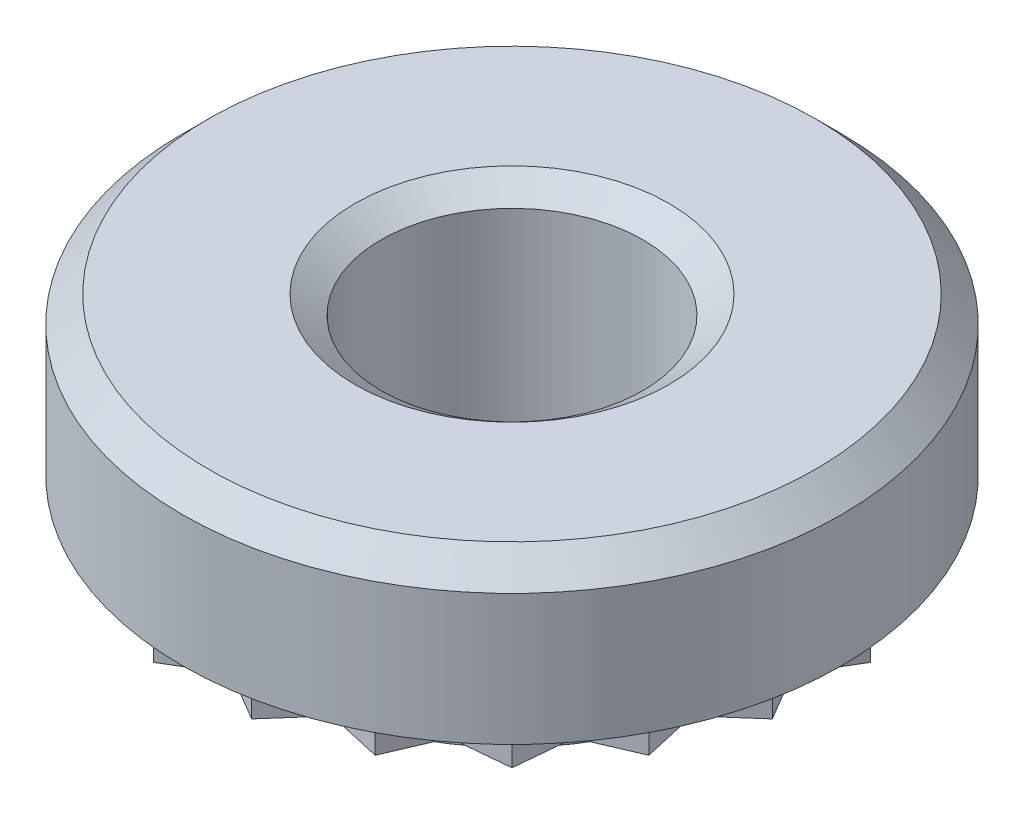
ISO-10303-21;
HEADER;
FILE_DESCRIPTION(('STEP AP214'),'2;1');
FILE_NAME('part.step','',(''),(''),'','','');
FILE_SCHEMA(('AUTOMOTIVE_DESIGN { 1 0 10303 214 1 1 1 1 }'));
ENDSEC;
DATA;
#1=APPLICATION_CONTEXT('core data for automotive mechanical design processes');
#2=APPLICATION_PROTOCOL_DEFINITION('international standard','automotive_design',2000,#1);
#3=PRODUCT_CONTEXT('',#1,'mechanical');
#4=PRODUCT('Part','Part','',(#3));
#5=PRODUCT_RELATED_PRODUCT_CATEGORY('part','',(#4));
#6=PRODUCT_DEFINITION_FORMATION('','',#4);
#7=PRODUCT_DEFINITION_CONTEXT('part definition',#1,'design');
#8=PRODUCT_DEFINITION('design','',#6,#7);
#9=PRODUCT_DEFINITION_SHAPE('','',#8);
#10=(LENGTH_UNIT() NAMED_UNIT(*) SI_UNIT(.MILLI.,.METRE.));
#11=(NAMED_UNIT(*) PLANE_ANGLE_UNIT() SI_UNIT($,.RADIAN.));
#12=(NAMED_UNIT(*) SI_UNIT($,.STERADIAN.) SOLID_ANGLE_UNIT());
#13=UNCERTAINTY_MEASURE_WITH_UNIT(LENGTH_MEASURE(1.E-05),#10,'distance_accuracy_value','');
#14=(GEOMETRIC_REPRESENTATION_CONTEXT(3) GLOBAL_UNCERTAINTY_ASSIGNED_CONTEXT((#13)) GLOBAL_UNIT_ASSIGNED_CONTEXT((#10,
#11,#12)) REPRESENTATION_CONTEXT('',''));
#15=CARTESIAN_POINT('',(0.,0.,0.));
#16=DIRECTION('',(0.,0.,1.));
#17=DIRECTION('',(1.,0.,0.));
#18=AXIS2_PLACEMENT_3D('',#15,#16,#17);
#19=CARTESIAN_POINT('',(-2.871480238,0.,2.871480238));
#20=DIRECTION('',(0.,-1.,0.));
#21=DIRECTION('',(0.,0.,-1.));
#22=AXIS2_PLACEMENT_3D('',#19,#20,#21);
#23=PLANE('',#22);
#24=CARTESIAN_POINT('',(0.,0.,0.));
#25=DIRECTION('',(0.,-1.,0.));
#26=DIRECTION('',(0.,0.,-1.));
#27=AXIS2_PLACEMENT_3D('',#24,#25,#26);
#28=CIRCLE('',#27,1.934485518);
#29=CARTESIAN_POINT('',(0.,0.,-1.934485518));
#30=VERTEX_POINT('',#29);
#31=EDGE_CURVE('E20',#30,#30,#28,.F.);
#32=ORIENTED_EDGE('',*,*,#31,.T.);
#33=EDGE_LOOP('',(#32));
#34=FACE_BOUND('',#33,.T.);
#35=DIRECTION('',(-0.995754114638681,0.,0.092052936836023));
#36=VECTOR('',#35,1.);
#37=CARTESIAN_POINT('',(1.7711097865,0.,2.0554368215));
#38=LINE('',#37,#36);
#39=CARTESIAN_POINT('',(2.03137636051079,0.,2.03137635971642));
#40=VERTEX_POINT('',#39);
#41=CARTESIAN_POINT('',(1.51084321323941,0.,2.07949728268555));
#42=VERTEX_POINT('',#41);
#43=EDGE_CURVE('E956',#40,#42,#38,.T.);
#44=ORIENTED_EDGE('',*,*,#43,.T.);
#45=DIRECTION('',(-0.39525248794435,0.,0.918572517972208));
#46=VECTOR('',#45,1.);
#47=CARTESIAN_POINT('',(1.40753356,0.,2.3195904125));
#48=LINE('',#47,#46);
#49=CARTESIAN_POINT('',(1.30422390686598,0.,2.55968354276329));
#50=VERTEX_POINT('',#49);
#51=EDGE_CURVE('E951',#42,#50,#48,.T.);
#52=ORIENTED_EDGE('',*,*,#51,.T.);
#53=DIRECTION('',(-0.975464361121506,0.,-0.220157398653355));
#54=VECTOR('',#53,1.);
#55=CARTESIAN_POINT('',(1.049260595,0.,2.502139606));
#56=LINE('',#55,#54);
#57=CARTESIAN_POINT('',(0.794297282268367,0.,2.44459566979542));
#58=VERTEX_POINT('',#57);
#59=EDGE_CURVE('E943',#50,#58,#56,.T.);
#60=ORIENTED_EDGE('',*,*,#59,.T.);
#61=DIRECTION('',(-0.659761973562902,0.,0.751474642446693));
#62=VECTOR('',#61,1.);
#63=CARTESIAN_POINT('',(0.6218511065,0.,2.641013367));
#64=LINE('',#63,#62);
#65=CARTESIAN_POINT('',(0.449404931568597,0.,2.83743106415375));
#66=VERTEX_POINT('',#65);
#67=EDGE_CURVE('E289',#58,#66,#64,.T.);
#68=ORIENTED_EDGE('',*,*,#67,.T.);
#69=DIRECTION('',(-0.859689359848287,0.,-0.510817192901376));
#70=VECTOR('',#69,1.);
#71=CARTESIAN_POINT('',(0.2247024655,0.,2.7039155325));
#72=LINE('',#71,#70);
#73=CARTESIAN_POINT('',(7.02668168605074E-10,0.,2.57040000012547));
#74=VERTEX_POINT('',#73);
#75=EDGE_CURVE('E409',#66,#74,#72,.T.);
#76=ORIENTED_EDGE('',*,*,#75,.T.);
#77=DIRECTION('',(-0.859689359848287,0.,0.510817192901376));
#78=VECTOR('',#77,1.);
#79=CARTESIAN_POINT('',(-0.2247024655,0.,2.7039155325));
#80=LINE('',#79,#78);
#81=CARTESIAN_POINT('',(-0.449404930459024,0.,2.83743106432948));
#82=VERTEX_POINT('',#81);
#83=EDGE_CURVE('E408',#74,#82,#80,.T.);
#84=ORIENTED_EDGE('',*,*,#83,.T.);
#85=DIRECTION('',(-0.659761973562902,0.,-0.751474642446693));
#86=VECTOR('',#85,1.);
#87=CARTESIAN_POINT('',(-0.6218511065,0.,2.641013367));
#88=LINE('',#87,#86);
#89=CARTESIAN_POINT('',(-0.794297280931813,0.,2.44459567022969));
#90=VERTEX_POINT('',#89);
#91=EDGE_CURVE('E406',#82,#90,#88,.T.);
#92=ORIENTED_EDGE('',*,*,#91,.T.);
#93=DIRECTION('',(-0.975464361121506,0.,0.220157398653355));
#94=VECTOR('',#93,1.);
#95=CARTESIAN_POINT('',(-1.049260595,0.,2.502139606));
#96=LINE('',#95,#94);
#97=CARTESIAN_POINT('',(-1.30422390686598,0.,2.55968354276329));
#98=VERTEX_POINT('',#97);
#99=EDGE_CURVE('E1118',#90,#98,#96,.T.);
#100=ORIENTED_EDGE('',*,*,#99,.T.);
#101=DIRECTION('',(-0.39525248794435,0.,-0.918572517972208));
#102=VECTOR('',#101,1.);
#103=CARTESIAN_POINT('',(-1.40753356,0.,2.3195904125));
#104=LINE('',#103,#102);
#105=CARTESIAN_POINT('',(-1.51084321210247,0.,2.07949728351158));
#106=VERTEX_POINT('',#105);
#107=EDGE_CURVE('E1114',#98,#106,#104,.T.);
#108=ORIENTED_EDGE('',*,*,#107,.T.);
#109=DIRECTION('',(-0.995754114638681,0.,-0.092052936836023));
#110=VECTOR('',#109,1.);
#111=CARTESIAN_POINT('',(-1.7711097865,0.,2.0554368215));
#112=LINE('',#111,#110);
#113=CARTESIAN_POINT('',(-2.03137635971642,0.,2.03137636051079));
#114=VERTEX_POINT('',#113);
#115=EDGE_CURVE('E1110',#106,#114,#112,.T.);
#116=ORIENTED_EDGE('',*,*,#115,.T.);
#117=DIRECTION('',(-0.092052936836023,0.,-0.995754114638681));
#118=VECTOR('',#117,1.);
#119=CARTESIAN_POINT('',(-2.0554368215,0.,1.7711097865));
#120=LINE('',#119,#118);
#121=CARTESIAN_POINT('',(-2.07949728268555,0.,1.51084321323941));
#122=VERTEX_POINT('',#121);
#123=EDGE_CURVE('E1106',#114,#122,#120,.T.);
#124=ORIENTED_EDGE('',*,*,#123,.T.);
#125=DIRECTION('',(-0.918572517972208,0.,-0.39525248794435));
#126=VECTOR('',#125,1.);
#127=CARTESIAN_POINT('',(-2.3195904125,0.,1.40753356));
#128=LINE('',#127,#126);
#129=CARTESIAN_POINT('',(-2.55968354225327,0.,1.30422390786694));
#130=VERTEX_POINT('',#129);
#131=EDGE_CURVE('E1101',#122,#130,#128,.T.);
#132=ORIENTED_EDGE('',*,*,#131,.T.);
#133=DIRECTION('',(0.220157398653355,0.,-0.975464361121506));
#134=VECTOR('',#133,1.);
#135=CARTESIAN_POINT('',(-2.502139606,0.,1.049260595));
#136=LINE('',#135,#134);
#137=CARTESIAN_POINT('',(-2.44459566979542,0.,0.794297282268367));
#138=VERTEX_POINT('',#137);
#139=EDGE_CURVE('E1096',#130,#138,#136,.T.);
#140=ORIENTED_EDGE('',*,*,#139,.T.);
#141=DIRECTION('',(-0.751474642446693,0.,-0.659761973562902));
#142=VECTOR('',#141,1.);
#143=CARTESIAN_POINT('',(-2.641013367,0.,0.6218511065));
#144=LINE('',#143,#142);
#145=CARTESIAN_POINT('',(-2.83743106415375,0.,0.449404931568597));
#146=VERTEX_POINT('',#145);
#147=EDGE_CURVE('E1091',#138,#146,#144,.T.);
#148=ORIENTED_EDGE('',*,*,#147,.T.);
#149=DIRECTION('',(0.510817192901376,0.,-0.859689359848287));
#150=VECTOR('',#149,1.);
#151=CARTESIAN_POINT('',(-2.7039155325,0.,0.2247024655));
#152=LINE('',#151,#150);
#153=CARTESIAN_POINT('',(-2.57040000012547,0.,7.0266823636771E-10));
#154=VERTEX_POINT('',#153);
#155=EDGE_CURVE('E1086',#146,#154,#152,.T.);
#156=ORIENTED_EDGE('',*,*,#155,.T.);
#157=DIRECTION('',(-0.510817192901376,0.,-0.859689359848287));
#158=VECTOR('',#157,1.);
#159=CARTESIAN_POINT('',(-2.7039155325,0.,-0.2247024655));
#160=LINE('',#159,#158);
#161=CARTESIAN_POINT('',(-2.83743106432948,0.,-0.449404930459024));
#162=VERTEX_POINT('',#161);
#163=EDGE_CURVE('E1081',#154,#162,#160,.T.);
#164=ORIENTED_EDGE('',*,*,#163,.T.);
#165=DIRECTION('',(0.751474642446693,0.,-0.659761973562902));
#166=VECTOR('',#165,1.);
#167=CARTESIAN_POINT('',(-2.641013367,0.,-0.6218511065));
#168=LINE('',#167,#166);
#169=CARTESIAN_POINT('',(-2.44459567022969,0.,-0.794297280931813));
#170=VERTEX_POINT('',#169);
#171=EDGE_CURVE('E1076',#162,#170,#168,.T.);
#172=ORIENTED_EDGE('',*,*,#171,.T.);
#173=DIRECTION('',(-0.220157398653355,0.,-0.975464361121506));
#174=VECTOR('',#173,1.);
#175=CARTESIAN_POINT('',(-2.502139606,0.,-1.049260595));
#176=LINE('',#175,#174);
#177=CARTESIAN_POINT('',(-2.55968354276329,0.,-1.30422390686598));
#178=VERTEX_POINT('',#177);
#179=EDGE_CURVE('E1071',#170,#178,#176,.T.);
#180=ORIENTED_EDGE('',*,*,#179,.T.);
#181=DIRECTION('',(0.918572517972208,0.,-0.39525248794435));
#182=VECTOR('',#181,1.);
#183=CARTESIAN_POINT('',(-2.3195904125,0.,-1.40753356));
#184=LINE('',#183,#182);
#185=CARTESIAN_POINT('',(-2.07949728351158,0.,-1.51084321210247));
#186=VERTEX_POINT('',#185);
#187=EDGE_CURVE('E1066',#178,#186,#184,.T.);
#188=ORIENTED_EDGE('',*,*,#187,.T.);
#189=DIRECTION('',(0.092052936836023,0.,-0.995754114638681));
#190=VECTOR('',#189,1.);
#191=CARTESIAN_POINT('',(-2.0554368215,0.,-1.7711097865));
#192=LINE('',#191,#190);
#193=CARTESIAN_POINT('',(-2.03137636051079,0.,-2.03137635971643));
#194=VERTEX_POINT('',#193);
#195=EDGE_CURVE('E1061',#186,#194,#192,.T.);
#196=ORIENTED_EDGE('',*,*,#195,.T.);
#197=DIRECTION('',(0.995754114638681,0.,-0.092052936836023));
#198=VECTOR('',#197,1.);
#199=CARTESIAN_POINT('',(-1.7711097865,0.,-2.0554368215));
#200=LINE('',#199,#198);
#201=CARTESIAN_POINT('',(-1.51084321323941,0.,-2.07949728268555));
#202=VERTEX_POINT('',#201);
#203=EDGE_CURVE('E1056',#194,#202,#200,.T.);
#204=ORIENTED_EDGE('',*,*,#203,.T.);
#205=DIRECTION('',(0.39525248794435,0.,-0.918572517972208));
#206=VECTOR('',#205,1.);
#207=CARTESIAN_POINT('',(-1.40753356,0.,-2.3195904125));
#208=LINE('',#207,#206);
#209=CARTESIAN_POINT('',(-1.30422390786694,0.,-2.55968354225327));
#210=VERTEX_POINT('',#209);
#211=EDGE_CURVE('E1051',#202,#210,#208,.T.);
#212=ORIENTED_EDGE('',*,*,#211,.T.);
#213=DIRECTION('',(0.975464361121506,0.,0.220157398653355));
#214=VECTOR('',#213,1.);
#215=CARTESIAN_POINT('',(-1.049260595,0.,-2.502139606));
#216=LINE('',#215,#214);
#217=CARTESIAN_POINT('',(-0.794297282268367,0.,-2.44459566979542));
#218=VERTEX_POINT('',#217);
#219=EDGE_CURVE('E1046',#210,#218,#216,.T.);
#220=ORIENTED_EDGE('',*,*,#219,.T.);
#221=DIRECTION('',(0.659761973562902,0.,-0.751474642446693));
#222=VECTOR('',#221,1.);
#223=CARTESIAN_POINT('',(-0.6218511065,0.,-2.641013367));
#224=LINE('',#223,#222);
#225=CARTESIAN_POINT('',(-0.449404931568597,0.,-2.83743106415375));
#226=VERTEX_POINT('',#225);
#227=EDGE_CURVE('E1041',#218,#226,#224,.T.);
#228=ORIENTED_EDGE('',*,*,#227,.T.);
#229=DIRECTION('',(0.859689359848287,0.,0.510817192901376));
#230=VECTOR('',#229,1.);
#231=CARTESIAN_POINT('',(-0.2247024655,0.,-2.7039155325));
#232=LINE('',#231,#230);
#233=CARTESIAN_POINT('',(-7.0266823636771E-10,0.,-2.57040000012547));
#234=VERTEX_POINT('',#233);
#235=EDGE_CURVE('E1036',#226,#234,#232,.T.);
#236=ORIENTED_EDGE('',*,*,#235,.T.);
#237=DIRECTION('',(0.859689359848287,0.,-0.510817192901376));
#238=VECTOR('',#237,1.);
#239=CARTESIAN_POINT('',(0.2247024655,0.,-2.7039155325));
#240=LINE('',#239,#238);
#241=CARTESIAN_POINT('',(0.449404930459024,0.,-2.83743106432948));
#242=VERTEX_POINT('',#241);
#243=EDGE_CURVE('E1031',#234,#242,#240,.T.);
#244=ORIENTED_EDGE('',*,*,#243,.T.);
#245=DIRECTION('',(0.659761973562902,0.,0.751474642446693));
#246=VECTOR('',#245,1.);
#247=CARTESIAN_POINT('',(0.6218511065,0.,-2.641013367));
#248=LINE('',#247,#246);
#249=CARTESIAN_POINT('',(0.794297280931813,0.,-2.44459567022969));
#250=VERTEX_POINT('',#249);
#251=EDGE_CURVE('E1026',#242,#250,#248,.T.);
#252=ORIENTED_EDGE('',*,*,#251,.T.);
#253=DIRECTION('',(0.975464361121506,0.,-0.220157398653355));
#254=VECTOR('',#253,1.);
#255=CARTESIAN_POINT('',(1.049260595,0.,-2.502139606));
#256=LINE('',#255,#254);
#257=CARTESIAN_POINT('',(1.30422390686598,0.,-2.55968354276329));
#258=VERTEX_POINT('',#257);
#259=EDGE_CURVE('E1021',#250,#258,#256,.T.);
#260=ORIENTED_EDGE('',*,*,#259,.T.);
#261=DIRECTION('',(0.39525248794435,0.,0.918572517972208));
#262=VECTOR('',#261,1.);
#263=CARTESIAN_POINT('',(1.40753356,0.,-2.3195904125));
#264=LINE('',#263,#262);
#265=CARTESIAN_POINT('',(1.51084321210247,0.,-2.07949728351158));
#266=VERTEX_POINT('',#265);
#267=EDGE_CURVE('E1016',#258,#266,#264,.T.);
#268=ORIENTED_EDGE('',*,*,#267,.T.);
#269=DIRECTION('',(0.995754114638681,0.,0.092052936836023));
#270=VECTOR('',#269,1.);
#271=CARTESIAN_POINT('',(1.7711097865,0.,-2.0554368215));
#272=LINE('',#271,#270);
#273=CARTESIAN_POINT('',(2.03137635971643,0.,-2.03137636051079));
#274=VERTEX_POINT('',#273);
#275=EDGE_CURVE('E1011',#266,#274,#272,.T.);
#276=ORIENTED_EDGE('',*,*,#275,.T.);
#277=DIRECTION('',(0.092052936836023,0.,0.995754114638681));
#278=VECTOR('',#277,1.);
#279=CARTESIAN_POINT('',(2.0554368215,0.,-1.7711097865));
#280=LINE('',#279,#278);
#281=CARTESIAN_POINT('',(2.07949728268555,0.,-1.51084321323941));
#282=VERTEX_POINT('',#281);
#283=EDGE_CURVE('E1006',#274,#282,#280,.T.);
#284=ORIENTED_EDGE('',*,*,#283,.T.);
#285=DIRECTION('',(0.918572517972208,0.,0.39525248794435));
#286=VECTOR('',#285,1.);
#287=CARTESIAN_POINT('',(2.3195904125,0.,-1.40753356));
#288=LINE('',#287,#286);
#289=CARTESIAN_POINT('',(2.55968354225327,0.,-1.30422390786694));
#290=VERTEX_POINT('',#289);
#291=EDGE_CURVE('E1001',#282,#290,#288,.T.);
#292=ORIENTED_EDGE('',*,*,#291,.T.);
#293=DIRECTION('',(-0.220157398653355,0.,0.975464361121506));
#294=VECTOR('',#293,1.);
#295=CARTESIAN_POINT('',(2.502139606,0.,-1.049260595));
#296=LINE('',#295,#294);
#297=CARTESIAN_POINT('',(2.44459566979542,0.,-0.794297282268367));
#298=VERTEX_POINT('',#297);
#299=EDGE_CURVE('E996',#290,#298,#296,.T.);
#300=ORIENTED_EDGE('',*,*,#299,.T.);
#301=DIRECTION('',(0.751474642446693,0.,0.659761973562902));
#302=VECTOR('',#301,1.);
#303=CARTESIAN_POINT('',(2.641013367,0.,-0.6218511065));
#304=LINE('',#303,#302);
#305=CARTESIAN_POINT('',(2.83743106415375,0.,-0.449404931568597));
#306=VERTEX_POINT('',#305);
#307=EDGE_CURVE('E991',#298,#306,#304,.T.);
#308=ORIENTED_EDGE('',*,*,#307,.T.);
#309=DIRECTION('',(-0.510817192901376,0.,0.859689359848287));
#310=VECTOR('',#309,1.);
#311=CARTESIAN_POINT('',(2.7039155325,0.,-0.2247024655));
#312=LINE('',#311,#310);
#313=CARTESIAN_POINT('',(2.57040000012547,0.,-7.02668182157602E-10));
#314=VERTEX_POINT('',#313);
#315=EDGE_CURVE('E986',#306,#314,#312,.T.);
#316=ORIENTED_EDGE('',*,*,#315,.T.);
#317=DIRECTION('',(0.510817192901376,0.,0.859689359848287));
#318=VECTOR('',#317,1.);
#319=CARTESIAN_POINT('',(2.7039155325,0.,0.2247024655));
#320=LINE('',#319,#318);
#321=CARTESIAN_POINT('',(2.83743106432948,0.,0.449404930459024));
#322=VERTEX_POINT('',#321);
#323=EDGE_CURVE('E981',#314,#322,#320,.T.);
#324=ORIENTED_EDGE('',*,*,#323,.T.);
#325=DIRECTION('',(-0.751474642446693,0.,0.659761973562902));
#326=VECTOR('',#325,1.);
#327=CARTESIAN_POINT('',(2.641013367,0.,0.6218511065));
#328=LINE('',#327,#326);
#329=CARTESIAN_POINT('',(2.44459567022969,0.,0.794297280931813));
#330=VERTEX_POINT('',#329);
#331=EDGE_CURVE('E976',#322,#330,#328,.T.);
#332=ORIENTED_EDGE('',*,*,#331,.T.);
#333=DIRECTION('',(0.220157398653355,0.,0.975464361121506));
#334=VECTOR('',#333,1.);
#335=CARTESIAN_POINT('',(2.502139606,0.,1.049260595));
#336=LINE('',#335,#334);
#337=CARTESIAN_POINT('',(2.55968354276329,0.,1.30422390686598));
#338=VERTEX_POINT('',#337);
#339=EDGE_CURVE('E971',#330,#338,#336,.T.);
#340=ORIENTED_EDGE('',*,*,#339,.T.);
#341=DIRECTION('',(-0.918572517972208,0.,0.39525248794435));
#342=VECTOR('',#341,1.);
#343=CARTESIAN_POINT('',(2.3195904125,0.,1.40753356));
#344=LINE('',#343,#342);
#345=CARTESIAN_POINT('',(2.07949728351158,0.,1.51084321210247));
#346=VERTEX_POINT('',#345);
#347=EDGE_CURVE('E966',#338,#346,#344,.T.);
#348=ORIENTED_EDGE('',*,*,#347,.T.);
#349=DIRECTION('',(-0.092052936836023,0.,0.995754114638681));
#350=VECTOR('',#349,1.);
#351=CARTESIAN_POINT('',(2.0554368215,0.,1.7711097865));
#352=LINE('',#351,#350);
#353=EDGE_CURVE('E961',#346,#40,#352,.T.);
#354=ORIENTED_EDGE('',*,*,#353,.T.);
#355=EDGE_LOOP('',(#44,#52,#60,#68,#76,#84,#92,#100,#108,#116,#124,#132,#140,#148,#156,#164,
#172,#180,#188,#196,#204,#212,#220,#228,#236,#244,#252,#260,#268,#276,#284,#292,#300,#308,#316,
#324,#332,#340,#348,#354));
#356=FACE_BOUND('',#355,.T.);
#357=ADVANCED_FACE('F16',(#34,#356),#23,.T.);
#358=CARTESIAN_POINT('',(0.,0.,0.));
#359=DIRECTION('',(0.,-1.,0.));
#360=DIRECTION('',(0.,0.,-1.));
#361=AXIS2_PLACEMENT_3D('',#358,#359,#360);
#362=CYLINDRICAL_SURFACE('',#361,1.934485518);
#363=ORIENTED_EDGE('',*,*,#31,.F.);
#364=EDGE_LOOP('',(#363));
#365=FACE_BOUND('',#364,.T.);
#366=CARTESIAN_POINT('',(0.,-0.303999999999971,0.));
#367=DIRECTION('',(0.,-1.,0.));
#368=DIRECTION('',(0.,0.,-1.));
#369=AXIS2_PLACEMENT_3D('',#366,#367,#368);
#370=CIRCLE('',#369,1.934485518);
#371=CARTESIAN_POINT('',(0.,-0.304,-1.934485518));
#372=VERTEX_POINT('',#371);
#373=EDGE_CURVE('E927',#372,#372,#370,.F.);
#374=ORIENTED_EDGE('',*,*,#373,.T.);
#375=EDGE_LOOP('',(#374));
#376=FACE_BOUND('',#375,.T.);
#377=ADVANCED_FACE('F2257',(#365,#376),#362,.T.);
#378=CARTESIAN_POINT('',(-0.449404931,-0.304,2.837431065));
#379=DIRECTION('',(0.510817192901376,0.,0.859689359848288));
#380=DIRECTION('',(0.859689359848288,0.,-0.510817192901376));
#381=AXIS2_PLACEMENT_3D('',#378,#379,#380);
#382=PLANE('',#381);
#383=DIRECTION('',(0.,-1.,0.));
#384=VECTOR('',#383,1.);
#385=CARTESIAN_POINT('',(0.,-0.152,2.5704));
#386=LINE('',#385,#384);
#387=CARTESIAN_POINT('',(0.,-0.304,2.5704));
#388=VERTEX_POINT('',#387);
#389=EDGE_CURVE('E432',#74,#388,#386,.T.);
#390=ORIENTED_EDGE('',*,*,#389,.T.);
#391=DIRECTION('',(0.859689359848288,0.,-0.510817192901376));
#392=VECTOR('',#391,1.);
#393=CARTESIAN_POINT('',(-0.449404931,-0.304,2.837431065));
#394=LINE('',#393,#392);
#395=CARTESIAN_POINT('',(-0.449404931,-0.304,2.837431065));
#396=VERTEX_POINT('',#395);
#397=EDGE_CURVE('E279',#388,#396,#394,.F.);
#398=ORIENTED_EDGE('',*,*,#397,.T.);
#399=DIRECTION('',(0.,1.,0.));
#400=VECTOR('',#399,1.);
#401=CARTESIAN_POINT('',(-0.449404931,-0.152,2.837431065));
#402=LINE('',#401,#400);
#403=EDGE_CURVE('E414',#396,#82,#402,.T.);
#404=ORIENTED_EDGE('',*,*,#403,.T.);
#405=ORIENTED_EDGE('',*,*,#83,.F.);
#406=EDGE_LOOP('',(#390,#398,#404,#405));
#407=FACE_BOUND('',#406,.T.);
#408=ADVANCED_FACE('F423',(#407),#382,.F.);
#409=CARTESIAN_POINT('',(-0.794297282,-0.304,2.444595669));
#410=DIRECTION('',(-0.751474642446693,0.,0.659761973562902));
#411=DIRECTION('',(0.659761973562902,0.,0.751474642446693));
#412=AXIS2_PLACEMENT_3D('',#409,#410,#411);
#413=PLANE('',#412);
#414=ORIENTED_EDGE('',*,*,#403,.F.);
#415=DIRECTION('',(0.659761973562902,0.,0.751474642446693));
#416=VECTOR('',#415,1.);
#417=CARTESIAN_POINT('',(-0.794297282,-0.304,2.444595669));
#418=LINE('',#417,#416);
#419=CARTESIAN_POINT('',(-0.794297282,-0.304,2.444595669));
#420=VERTEX_POINT('',#419);
#421=EDGE_CURVE('E924',#396,#420,#418,.F.);
#422=ORIENTED_EDGE('',*,*,#421,.T.);
#423=DIRECTION('',(0.,1.,0.));
#424=VECTOR('',#423,1.);
#425=CARTESIAN_POINT('',(-0.794297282,-0.152,2.444595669));
#426=LINE('',#425,#424);
#427=EDGE_CURVE('E420',#420,#90,#426,.T.);
#428=ORIENTED_EDGE('',*,*,#427,.T.);
#429=ORIENTED_EDGE('',*,*,#91,.F.);
#430=EDGE_LOOP('',(#414,#422,#428,#429));
#431=FACE_BOUND('',#430,.T.);
#432=ADVANCED_FACE('F418',(#431),#413,.F.);
#433=CARTESIAN_POINT('',(-1.304223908,-0.304,2.559683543));
#434=DIRECTION('',(0.220157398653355,0.,0.975464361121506));
#435=DIRECTION('',(0.975464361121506,0.,-0.220157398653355));
#436=AXIS2_PLACEMENT_3D('',#433,#434,#435);
#437=PLANE('',#436);
#438=ORIENTED_EDGE('',*,*,#427,.F.);
#439=DIRECTION('',(0.975464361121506,0.,-0.220157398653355));
#440=VECTOR('',#439,1.);
#441=CARTESIAN_POINT('',(-1.304223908,-0.304,2.559683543));
#442=LINE('',#441,#440);
#443=CARTESIAN_POINT('',(-1.304223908,-0.304,2.559683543));
#444=VERTEX_POINT('',#443);
#445=EDGE_CURVE('E920',#420,#444,#442,.F.);
#446=ORIENTED_EDGE('',*,*,#445,.T.);
#447=DIRECTION('',(0.,1.,0.));
#448=VECTOR('',#447,1.);
#449=CARTESIAN_POINT('',(-1.304223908,-0.152,2.559683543));
#450=LINE('',#449,#448);
#451=EDGE_CURVE('E1115',#444,#98,#450,.T.);
#452=ORIENTED_EDGE('',*,*,#451,.T.);
#453=ORIENTED_EDGE('',*,*,#99,.F.);
#454=EDGE_LOOP('',(#438,#446,#452,#453));
#455=FACE_BOUND('',#454,.T.);
#456=ADVANCED_FACE('F2231',(#455),#437,.F.);
#457=CARTESIAN_POINT('',(-1.510843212,-0.304,2.079497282));
#458=DIRECTION('',(-0.918572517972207,0.,0.39525248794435));
#459=DIRECTION('',(0.39525248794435,0.,0.918572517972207));
#460=AXIS2_PLACEMENT_3D('',#457,#458,#459);
#461=PLANE('',#460);
#462=ORIENTED_EDGE('',*,*,#451,.F.);
#463=DIRECTION('',(0.39525248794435,0.,0.918572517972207));
#464=VECTOR('',#463,1.);
#465=CARTESIAN_POINT('',(-1.510843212,-0.304,2.079497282));
#466=LINE('',#465,#464);
#467=CARTESIAN_POINT('',(-1.510843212,-0.304,2.079497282));
#468=VERTEX_POINT('',#467);
#469=EDGE_CURVE('E916',#444,#468,#466,.F.);
#470=ORIENTED_EDGE('',*,*,#469,.T.);
#471=DIRECTION('',(0.,1.,0.));
#472=VECTOR('',#471,1.);
#473=CARTESIAN_POINT('',(-1.510843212,-0.152,2.079497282));
#474=LINE('',#473,#472);
#475=EDGE_CURVE('E1111',#468,#106,#474,.T.);
#476=ORIENTED_EDGE('',*,*,#475,.T.);
#477=ORIENTED_EDGE('',*,*,#107,.F.);
#478=EDGE_LOOP('',(#462,#470,#476,#477));
#479=FACE_BOUND('',#478,.T.);
#480=ADVANCED_FACE('F2221',(#479),#461,.F.);
#481=CARTESIAN_POINT('',(-2.031376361,-0.304,2.031376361));
#482=DIRECTION('',(-0.092052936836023,0.,0.995754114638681));
#483=DIRECTION('',(0.995754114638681,0.,0.092052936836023));
#484=AXIS2_PLACEMENT_3D('',#481,#482,#483);
#485=PLANE('',#484);
#486=ORIENTED_EDGE('',*,*,#475,.F.);
#487=DIRECTION('',(0.995754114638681,0.,0.092052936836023));
#488=VECTOR('',#487,1.);
#489=CARTESIAN_POINT('',(-2.031376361,-0.304,2.031376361));
#490=LINE('',#489,#488);
#491=CARTESIAN_POINT('',(-2.031376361,-0.304,2.031376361));
#492=VERTEX_POINT('',#491);
#493=EDGE_CURVE('E912',#468,#492,#490,.F.);
#494=ORIENTED_EDGE('',*,*,#493,.T.);
#495=DIRECTION('',(0.,1.,0.));
#496=VECTOR('',#495,1.);
#497=CARTESIAN_POINT('',(-2.031376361,-0.152,2.031376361));
#498=LINE('',#497,#496);
#499=EDGE_CURVE('E1107',#492,#114,#498,.T.);
#500=ORIENTED_EDGE('',*,*,#499,.T.);
#501=ORIENTED_EDGE('',*,*,#115,.F.);
#502=EDGE_LOOP('',(#486,#494,#500,#501));
#503=FACE_BOUND('',#502,.T.);
#504=ADVANCED_FACE('F2211',(#503),#485,.F.);
#505=CARTESIAN_POINT('',(-2.079497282,-0.304,1.510843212));
#506=DIRECTION('',(-0.995754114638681,0.,0.092052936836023));
#507=DIRECTION('',(0.092052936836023,0.,0.995754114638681));
#508=AXIS2_PLACEMENT_3D('',#505,#506,#507);
#509=PLANE('',#508);
#510=ORIENTED_EDGE('',*,*,#499,.F.);
#511=DIRECTION('',(0.092052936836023,0.,0.995754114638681));
#512=VECTOR('',#511,1.);
#513=CARTESIAN_POINT('',(-2.079497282,-0.304,1.510843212));
#514=LINE('',#513,#512);
#515=CARTESIAN_POINT('',(-2.079497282,-0.304,1.510843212));
#516=VERTEX_POINT('',#515);
#517=EDGE_CURVE('E908',#492,#516,#514,.F.);
#518=ORIENTED_EDGE('',*,*,#517,.T.);
#519=DIRECTION('',(0.,1.,0.));
#520=VECTOR('',#519,1.);
#521=CARTESIAN_POINT('',(-2.079497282,-0.152,1.510843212));
#522=LINE('',#521,#520);
#523=EDGE_CURVE('E1102',#516,#122,#522,.T.);
#524=ORIENTED_EDGE('',*,*,#523,.T.);
#525=ORIENTED_EDGE('',*,*,#123,.F.);
#526=EDGE_LOOP('',(#510,#518,#524,#525));
#527=FACE_BOUND('',#526,.T.);
#528=ADVANCED_FACE('F2201',(#527),#509,.F.);
#529=CARTESIAN_POINT('',(-2.559683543,-0.304,1.304223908));
#530=DIRECTION('',(-0.39525248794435,0.,0.918572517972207));
#531=DIRECTION('',(0.918572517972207,0.,0.39525248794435));
#532=AXIS2_PLACEMENT_3D('',#529,#530,#531);
#533=PLANE('',#532);
#534=ORIENTED_EDGE('',*,*,#523,.F.);
#535=DIRECTION('',(0.918572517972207,0.,0.39525248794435));
#536=VECTOR('',#535,1.);
#537=CARTESIAN_POINT('',(-2.559683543,-0.304,1.304223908));
#538=LINE('',#537,#536);
#539=CARTESIAN_POINT('',(-2.559683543,-0.304,1.304223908));
#540=VERTEX_POINT('',#539);
#541=EDGE_CURVE('E904',#516,#540,#538,.F.);
#542=ORIENTED_EDGE('',*,*,#541,.T.);
#543=DIRECTION('',(0.,1.,0.));
#544=VECTOR('',#543,1.);
#545=CARTESIAN_POINT('',(-2.559683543,-0.152,1.304223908));
#546=LINE('',#545,#544);
#547=EDGE_CURVE('E1097',#540,#130,#546,.T.);
#548=ORIENTED_EDGE('',*,*,#547,.T.);
#549=ORIENTED_EDGE('',*,*,#131,.F.);
#550=EDGE_LOOP('',(#534,#542,#548,#549));
#551=FACE_BOUND('',#550,.T.);
#552=ADVANCED_FACE('F2191',(#551),#533,.F.);
#553=CARTESIAN_POINT('',(-2.444595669,-0.304,0.794297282));
#554=DIRECTION('',(-0.975464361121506,0.,-0.220157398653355));
#555=DIRECTION('',(-0.220157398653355,0.,0.975464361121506));
#556=AXIS2_PLACEMENT_3D('',#553,#554,#555);
#557=PLANE('',#556);
#558=ORIENTED_EDGE('',*,*,#547,.F.);
#559=DIRECTION('',(-0.220157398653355,0.,0.975464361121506));
#560=VECTOR('',#559,1.);
#561=CARTESIAN_POINT('',(-2.444595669,-0.304,0.794297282));
#562=LINE('',#561,#560);
#563=CARTESIAN_POINT('',(-2.444595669,-0.304,0.794297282));
#564=VERTEX_POINT('',#563);
#565=EDGE_CURVE('E900',#540,#564,#562,.F.);
#566=ORIENTED_EDGE('',*,*,#565,.T.);
#567=DIRECTION('',(0.,1.,0.));
#568=VECTOR('',#567,1.);
#569=CARTESIAN_POINT('',(-2.444595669,-0.152,0.794297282));
#570=LINE('',#569,#568);
#571=EDGE_CURVE('E1092',#564,#138,#570,.T.);
#572=ORIENTED_EDGE('',*,*,#571,.T.);
#573=ORIENTED_EDGE('',*,*,#139,.F.);
#574=EDGE_LOOP('',(#558,#566,#572,#573));
#575=FACE_BOUND('',#574,.T.);
#576=ADVANCED_FACE('F2181',(#575),#557,.F.);
#577=CARTESIAN_POINT('',(-2.837431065,-0.304,0.449404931));
#578=DIRECTION('',(-0.659761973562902,0.,0.751474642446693));
#579=DIRECTION('',(0.751474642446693,0.,0.659761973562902));
#580=AXIS2_PLACEMENT_3D('',#577,#578,#579);
#581=PLANE('',#580);
#582=ORIENTED_EDGE('',*,*,#571,.F.);
#583=DIRECTION('',(0.751474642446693,0.,0.659761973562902));
#584=VECTOR('',#583,1.);
#585=CARTESIAN_POINT('',(-2.837431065,-0.304,0.449404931));
#586=LINE('',#585,#584);
#587=CARTESIAN_POINT('',(-2.837431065,-0.304,0.449404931));
#588=VERTEX_POINT('',#587);
#589=EDGE_CURVE('E896',#564,#588,#586,.F.);
#590=ORIENTED_EDGE('',*,*,#589,.T.);
#591=DIRECTION('',(0.,1.,0.));
#592=VECTOR('',#591,1.);
#593=CARTESIAN_POINT('',(-2.837431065,-0.152,0.449404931));
#594=LINE('',#593,#592);
#595=EDGE_CURVE('E1087',#588,#146,#594,.T.);
#596=ORIENTED_EDGE('',*,*,#595,.T.);
#597=ORIENTED_EDGE('',*,*,#147,.F.);
#598=EDGE_LOOP('',(#582,#590,#596,#597));
#599=FACE_BOUND('',#598,.T.);
#600=ADVANCED_FACE('F2171',(#599),#581,.F.);
#601=CARTESIAN_POINT('',(-2.5704,-0.304,0.));
#602=DIRECTION('',(-0.859689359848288,0.,-0.510817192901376));
#603=DIRECTION('',(-0.510817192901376,0.,0.859689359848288));
#604=AXIS2_PLACEMENT_3D('',#601,#602,#603);
#605=PLANE('',#604);
#606=ORIENTED_EDGE('',*,*,#595,.F.);
#607=DIRECTION('',(-0.510817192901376,0.,0.859689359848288));
#608=VECTOR('',#607,1.);
#609=CARTESIAN_POINT('',(-2.5704,-0.304,0.));
#610=LINE('',#609,#608);
#611=CARTESIAN_POINT('',(-2.5704,-0.304,0.));
#612=VERTEX_POINT('',#611);
#613=EDGE_CURVE('E892',#588,#612,#610,.F.);
#614=ORIENTED_EDGE('',*,*,#613,.T.);
#615=DIRECTION('',(0.,1.,0.));
#616=VECTOR('',#615,1.);
#617=CARTESIAN_POINT('',(-2.5704,-0.152,0.));
#618=LINE('',#617,#616);
#619=EDGE_CURVE('E1082',#612,#154,#618,.T.);
#620=ORIENTED_EDGE('',*,*,#619,.T.);
#621=ORIENTED_EDGE('',*,*,#155,.F.);
#622=EDGE_LOOP('',(#606,#614,#620,#621));
#623=FACE_BOUND('',#622,.T.);
#624=ADVANCED_FACE('F2161',(#623),#605,.F.);
#625=CARTESIAN_POINT('',(-2.837431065,-0.304,-0.449404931));
#626=DIRECTION('',(-0.859689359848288,0.,0.510817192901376));
#627=DIRECTION('',(0.510817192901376,0.,0.859689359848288));
#628=AXIS2_PLACEMENT_3D('',#625,#626,#627);
#629=PLANE('',#628);
#630=ORIENTED_EDGE('',*,*,#619,.F.);
#631=DIRECTION('',(0.510817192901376,0.,0.859689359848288));
#632=VECTOR('',#631,1.);
#633=CARTESIAN_POINT('',(-2.837431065,-0.304,-0.449404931));
#634=LINE('',#633,#632);
#635=CARTESIAN_POINT('',(-2.837431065,-0.304,-0.449404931));
#636=VERTEX_POINT('',#635);
#637=EDGE_CURVE('E888',#612,#636,#634,.F.);
#638=ORIENTED_EDGE('',*,*,#637,.T.);
#639=DIRECTION('',(0.,1.,0.));
#640=VECTOR('',#639,1.);
#641=CARTESIAN_POINT('',(-2.837431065,-0.152,-0.449404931));
#642=LINE('',#641,#640);
#643=EDGE_CURVE('E1077',#636,#162,#642,.T.);
#644=ORIENTED_EDGE('',*,*,#643,.T.);
#645=ORIENTED_EDGE('',*,*,#163,.F.);
#646=EDGE_LOOP('',(#630,#638,#644,#645));
#647=FACE_BOUND('',#646,.T.);
#648=ADVANCED_FACE('F2151',(#647),#629,.F.);
#649=CARTESIAN_POINT('',(-2.444595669,-0.304,-0.794297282));
#650=DIRECTION('',(-0.659761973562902,0.,-0.751474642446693));
#651=DIRECTION('',(-0.751474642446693,0.,0.659761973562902));
#652=AXIS2_PLACEMENT_3D('',#649,#650,#651);
#653=PLANE('',#652);
#654=ORIENTED_EDGE('',*,*,#643,.F.);
#655=DIRECTION('',(-0.751474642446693,0.,0.659761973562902));
#656=VECTOR('',#655,1.);
#657=CARTESIAN_POINT('',(-2.444595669,-0.304,-0.794297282));
#658=LINE('',#657,#656);
#659=CARTESIAN_POINT('',(-2.444595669,-0.304,-0.794297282));
#660=VERTEX_POINT('',#659);
#661=EDGE_CURVE('E884',#636,#660,#658,.F.);
#662=ORIENTED_EDGE('',*,*,#661,.T.);
#663=DIRECTION('',(0.,1.,0.));
#664=VECTOR('',#663,1.);
#665=CARTESIAN_POINT('',(-2.444595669,-0.152,-0.794297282));
#666=LINE('',#665,#664);
#667=EDGE_CURVE('E1072',#660,#170,#666,.T.);
#668=ORIENTED_EDGE('',*,*,#667,.T.);
#669=ORIENTED_EDGE('',*,*,#171,.F.);
#670=EDGE_LOOP('',(#654,#662,#668,#669));
#671=FACE_BOUND('',#670,.T.);
#672=ADVANCED_FACE('F2141',(#671),#653,.F.);
#673=CARTESIAN_POINT('',(-2.559683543,-0.304,-1.304223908));
#674=DIRECTION('',(-0.975464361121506,0.,0.220157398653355));
#675=DIRECTION('',(0.220157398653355,0.,0.975464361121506));
#676=AXIS2_PLACEMENT_3D('',#673,#674,#675);
#677=PLANE('',#676);
#678=ORIENTED_EDGE('',*,*,#667,.F.);
#679=DIRECTION('',(0.220157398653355,0.,0.975464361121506));
#680=VECTOR('',#679,1.);
#681=CARTESIAN_POINT('',(-2.559683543,-0.304,-1.304223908));
#682=LINE('',#681,#680);
#683=CARTESIAN_POINT('',(-2.559683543,-0.304,-1.304223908));
#684=VERTEX_POINT('',#683);
#685=EDGE_CURVE('E880',#660,#684,#682,.F.);
#686=ORIENTED_EDGE('',*,*,#685,.T.);
#687=DIRECTION('',(0.,1.,0.));
#688=VECTOR('',#687,1.);
#689=CARTESIAN_POINT('',(-2.559683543,-0.152,-1.304223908));
#690=LINE('',#689,#688);
#691=EDGE_CURVE('E1067',#684,#178,#690,.T.);
#692=ORIENTED_EDGE('',*,*,#691,.T.);
#693=ORIENTED_EDGE('',*,*,#179,.F.);
#694=EDGE_LOOP('',(#678,#686,#692,#693));
#695=FACE_BOUND('',#694,.T.);
#696=ADVANCED_FACE('F2131',(#695),#677,.F.);
#697=CARTESIAN_POINT('',(-2.079497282,-0.304,-1.510843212));
#698=DIRECTION('',(-0.39525248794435,0.,-0.918572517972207));
#699=DIRECTION('',(-0.918572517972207,0.,0.39525248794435));
#700=AXIS2_PLACEMENT_3D('',#697,#698,#699);
#701=PLANE('',#700);
#702=ORIENTED_EDGE('',*,*,#691,.F.);
#703=DIRECTION('',(-0.918572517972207,0.,0.39525248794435));
#704=VECTOR('',#703,1.);
#705=CARTESIAN_POINT('',(-2.079497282,-0.304,-1.510843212));
#706=LINE('',#705,#704);
#707=CARTESIAN_POINT('',(-2.079497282,-0.304,-1.510843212));
#708=VERTEX_POINT('',#707);
#709=EDGE_CURVE('E876',#684,#708,#706,.F.);
#710=ORIENTED_EDGE('',*,*,#709,.T.);
#711=DIRECTION('',(0.,1.,0.));
#712=VECTOR('',#711,1.);
#713=CARTESIAN_POINT('',(-2.079497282,-0.152,-1.510843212));
#714=LINE('',#713,#712);
#715=EDGE_CURVE('E1062',#708,#186,#714,.T.);
#716=ORIENTED_EDGE('',*,*,#715,.T.);
#717=ORIENTED_EDGE('',*,*,#187,.F.);
#718=EDGE_LOOP('',(#702,#710,#716,#717));
#719=FACE_BOUND('',#718,.T.);
#720=ADVANCED_FACE('F2121',(#719),#701,.F.);
#721=CARTESIAN_POINT('',(-2.031376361,-0.304,-2.031376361));
#722=DIRECTION('',(-0.995754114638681,0.,-0.092052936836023));
#723=DIRECTION('',(-0.092052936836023,0.,0.995754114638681));
#724=AXIS2_PLACEMENT_3D('',#721,#722,#723);
#725=PLANE('',#724);
#726=ORIENTED_EDGE('',*,*,#715,.F.);
#727=DIRECTION('',(-0.092052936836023,0.,0.995754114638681));
#728=VECTOR('',#727,1.);
#729=CARTESIAN_POINT('',(-2.031376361,-0.304,-2.031376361));
#730=LINE('',#729,#728);
#731=CARTESIAN_POINT('',(-2.031376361,-0.304,-2.031376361));
#732=VERTEX_POINT('',#731);
#733=EDGE_CURVE('E872',#708,#732,#730,.F.);
#734=ORIENTED_EDGE('',*,*,#733,.T.);
#735=DIRECTION('',(0.,1.,0.));
#736=VECTOR('',#735,1.);
#737=CARTESIAN_POINT('',(-2.031376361,-0.152,-2.031376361));
#738=LINE('',#737,#736);
#739=EDGE_CURVE('E1057',#732,#194,#738,.T.);
#740=ORIENTED_EDGE('',*,*,#739,.T.);
#741=ORIENTED_EDGE('',*,*,#195,.F.);
#742=EDGE_LOOP('',(#726,#734,#740,#741));
#743=FACE_BOUND('',#742,.T.);
#744=ADVANCED_FACE('F2111',(#743),#725,.F.);
#745=CARTESIAN_POINT('',(-1.510843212,-0.304,-2.079497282));
#746=DIRECTION('',(-0.092052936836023,0.,-0.995754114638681));
#747=DIRECTION('',(-0.995754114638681,0.,0.092052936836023));
#748=AXIS2_PLACEMENT_3D('',#745,#746,#747);
#749=PLANE('',#748);
#750=ORIENTED_EDGE('',*,*,#739,.F.);
#751=DIRECTION('',(-0.995754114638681,0.,0.092052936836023));
#752=VECTOR('',#751,1.);
#753=CARTESIAN_POINT('',(-1.510843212,-0.304,-2.079497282));
#754=LINE('',#753,#752);
#755=CARTESIAN_POINT('',(-1.510843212,-0.304,-2.079497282));
#756=VERTEX_POINT('',#755);
#757=EDGE_CURVE('E868',#732,#756,#754,.F.);
#758=ORIENTED_EDGE('',*,*,#757,.T.);
#759=DIRECTION('',(0.,1.,0.));
#760=VECTOR('',#759,1.);
#761=CARTESIAN_POINT('',(-1.510843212,-0.152,-2.079497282));
#762=LINE('',#761,#760);
#763=EDGE_CURVE('E1052',#756,#202,#762,.T.);
#764=ORIENTED_EDGE('',*,*,#763,.T.);
#765=ORIENTED_EDGE('',*,*,#203,.F.);
#766=EDGE_LOOP('',(#750,#758,#764,#765));
#767=FACE_BOUND('',#766,.T.);
#768=ADVANCED_FACE('F2101',(#767),#749,.F.);
#769=CARTESIAN_POINT('',(-1.304223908,-0.304,-2.559683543));
#770=DIRECTION('',(-0.918572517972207,0.,-0.39525248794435));
#771=DIRECTION('',(-0.39525248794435,0.,0.918572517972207));
#772=AXIS2_PLACEMENT_3D('',#769,#770,#771);
#773=PLANE('',#772);
#774=ORIENTED_EDGE('',*,*,#763,.F.);
#775=DIRECTION('',(-0.39525248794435,0.,0.918572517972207));
#776=VECTOR('',#775,1.);
#777=CARTESIAN_POINT('',(-1.304223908,-0.304,-2.559683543));
#778=LINE('',#777,#776);
#779=CARTESIAN_POINT('',(-1.304223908,-0.304,-2.559683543));
#780=VERTEX_POINT('',#779);
#781=EDGE_CURVE('E864',#756,#780,#778,.F.);
#782=ORIENTED_EDGE('',*,*,#781,.T.);
#783=DIRECTION('',(0.,1.,0.));
#784=VECTOR('',#783,1.);
#785=CARTESIAN_POINT('',(-1.304223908,-0.152,-2.559683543));
#786=LINE('',#785,#784);
#787=EDGE_CURVE('E1047',#780,#210,#786,.T.);
#788=ORIENTED_EDGE('',*,*,#787,.T.);
#789=ORIENTED_EDGE('',*,*,#211,.F.);
#790=EDGE_LOOP('',(#774,#782,#788,#789));
#791=FACE_BOUND('',#790,.T.);
#792=ADVANCED_FACE('F2091',(#791),#773,.F.);
#793=CARTESIAN_POINT('',(-0.794297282,-0.304,-2.444595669));
#794=DIRECTION('',(0.220157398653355,0.,-0.975464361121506));
#795=DIRECTION('',(-0.975464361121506,0.,-0.220157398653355));
#796=AXIS2_PLACEMENT_3D('',#793,#794,#795);
#797=PLANE('',#796);
#798=ORIENTED_EDGE('',*,*,#787,.F.);
#799=DIRECTION('',(-0.975464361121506,0.,-0.220157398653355));
#800=VECTOR('',#799,1.);
#801=CARTESIAN_POINT('',(-0.794297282,-0.304,-2.444595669));
#802=LINE('',#801,#800);
#803=CARTESIAN_POINT('',(-0.794297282,-0.304,-2.444595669));
#804=VERTEX_POINT('',#803);
#805=EDGE_CURVE('E860',#780,#804,#802,.F.);
#806=ORIENTED_EDGE('',*,*,#805,.T.);
#807=DIRECTION('',(0.,1.,0.));
#808=VECTOR('',#807,1.);
#809=CARTESIAN_POINT('',(-0.794297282,-0.152,-2.444595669));
#810=LINE('',#809,#808);
#811=EDGE_CURVE('E1042',#804,#218,#810,.T.);
#812=ORIENTED_EDGE('',*,*,#811,.T.);
#813=ORIENTED_EDGE('',*,*,#219,.F.);
#814=EDGE_LOOP('',(#798,#806,#812,#813));
#815=FACE_BOUND('',#814,.T.);
#816=ADVANCED_FACE('F2081',(#815),#797,.F.);
#817=CARTESIAN_POINT('',(-0.449404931,-0.304,-2.837431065));
#818=DIRECTION('',(-0.751474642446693,0.,-0.659761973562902));
#819=DIRECTION('',(-0.659761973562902,0.,0.751474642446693));
#820=AXIS2_PLACEMENT_3D('',#817,#818,#819);
#821=PLANE('',#820);
#822=ORIENTED_EDGE('',*,*,#811,.F.);
#823=DIRECTION('',(-0.659761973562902,0.,0.751474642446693));
#824=VECTOR('',#823,1.);
#825=CARTESIAN_POINT('',(-0.449404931,-0.304,-2.837431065));
#826=LINE('',#825,#824);
#827=CARTESIAN_POINT('',(-0.449404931,-0.304,-2.837431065));
#828=VERTEX_POINT('',#827);
#829=EDGE_CURVE('E856',#804,#828,#826,.F.);
#830=ORIENTED_EDGE('',*,*,#829,.T.);
#831=DIRECTION('',(0.,1.,0.));
#832=VECTOR('',#831,1.);
#833=CARTESIAN_POINT('',(-0.449404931,-0.152,-2.837431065));
#834=LINE('',#833,#832);
#835=EDGE_CURVE('E1037',#828,#226,#834,.T.);
#836=ORIENTED_EDGE('',*,*,#835,.T.);
#837=ORIENTED_EDGE('',*,*,#227,.F.);
#838=EDGE_LOOP('',(#822,#830,#836,#837));
#839=FACE_BOUND('',#838,.T.);
#840=ADVANCED_FACE('F2071',(#839),#821,.F.);
#841=CARTESIAN_POINT('',(0.,-0.304,-2.5704));
#842=DIRECTION('',(0.510817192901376,0.,-0.859689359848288));
#843=DIRECTION('',(-0.859689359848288,0.,-0.510817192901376));
#844=AXIS2_PLACEMENT_3D('',#841,#842,#843);
#845=PLANE('',#844);
#846=ORIENTED_EDGE('',*,*,#835,.F.);
#847=DIRECTION('',(-0.859689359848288,0.,-0.510817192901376));
#848=VECTOR('',#847,1.);
#849=CARTESIAN_POINT('',(0.,-0.304,-2.5704));
#850=LINE('',#849,#848);
#851=CARTESIAN_POINT('',(0.,-0.304,-2.5704));
#852=VERTEX_POINT('',#851);
#853=EDGE_CURVE('E852',#828,#852,#850,.F.);
#854=ORIENTED_EDGE('',*,*,#853,.T.);
#855=DIRECTION('',(0.,1.,0.));
#856=VECTOR('',#855,1.);
#857=CARTESIAN_POINT('',(0.,-0.152,-2.5704));
#858=LINE('',#857,#856);
#859=EDGE_CURVE('E1032',#852,#234,#858,.T.);
#860=ORIENTED_EDGE('',*,*,#859,.T.);
#861=ORIENTED_EDGE('',*,*,#235,.F.);
#862=EDGE_LOOP('',(#846,#854,#860,#861));
#863=FACE_BOUND('',#862,.T.);
#864=ADVANCED_FACE('F2061',(#863),#845,.F.);
#865=CARTESIAN_POINT('',(0.449404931,-0.304,-2.837431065));
#866=DIRECTION('',(-0.510817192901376,0.,-0.859689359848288));
#867=DIRECTION('',(-0.859689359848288,0.,0.510817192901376));
#868=AXIS2_PLACEMENT_3D('',#865,#866,#867);
#869=PLANE('',#868);
#870=ORIENTED_EDGE('',*,*,#859,.F.);
#871=DIRECTION('',(-0.859689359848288,0.,0.510817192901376));
#872=VECTOR('',#871,1.);
#873=CARTESIAN_POINT('',(0.449404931,-0.304,-2.837431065));
#874=LINE('',#873,#872);
#875=CARTESIAN_POINT('',(0.449404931,-0.304,-2.837431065));
#876=VERTEX_POINT('',#875);
#877=EDGE_CURVE('E848',#852,#876,#874,.F.);
#878=ORIENTED_EDGE('',*,*,#877,.T.);
#879=DIRECTION('',(0.,1.,0.));
#880=VECTOR('',#879,1.);
#881=CARTESIAN_POINT('',(0.449404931,-0.152,-2.837431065));
#882=LINE('',#881,#880);
#883=EDGE_CURVE('E1027',#876,#242,#882,.T.);
#884=ORIENTED_EDGE('',*,*,#883,.T.);
#885=ORIENTED_EDGE('',*,*,#243,.F.);
#886=EDGE_LOOP('',(#870,#878,#884,#885));
#887=FACE_BOUND('',#886,.T.);
#888=ADVANCED_FACE('F2051',(#887),#869,.F.);
#889=CARTESIAN_POINT('',(0.794297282,-0.304,-2.444595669));
#890=DIRECTION('',(0.751474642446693,0.,-0.659761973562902));
#891=DIRECTION('',(-0.659761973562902,0.,-0.751474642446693));
#892=AXIS2_PLACEMENT_3D('',#889,#890,#891);
#893=PLANE('',#892);
#894=ORIENTED_EDGE('',*,*,#883,.F.);
#895=DIRECTION('',(-0.659761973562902,0.,-0.751474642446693));
#896=VECTOR('',#895,1.);
#897=CARTESIAN_POINT('',(0.794297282,-0.304,-2.444595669));
#898=LINE('',#897,#896);
#899=CARTESIAN_POINT('',(0.794297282,-0.304,-2.444595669));
#900=VERTEX_POINT('',#899);
#901=EDGE_CURVE('E844',#876,#900,#898,.F.);
#902=ORIENTED_EDGE('',*,*,#901,.T.);
#903=DIRECTION('',(0.,1.,0.));
#904=VECTOR('',#903,1.);
#905=CARTESIAN_POINT('',(0.794297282,-0.152,-2.444595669));
#906=LINE('',#905,#904);
#907=EDGE_CURVE('E1022',#900,#250,#906,.T.);
#908=ORIENTED_EDGE('',*,*,#907,.T.);
#909=ORIENTED_EDGE('',*,*,#251,.F.);
#910=EDGE_LOOP('',(#894,#902,#908,#909));
#911=FACE_BOUND('',#910,.T.);
#912=ADVANCED_FACE('F2041',(#911),#893,.F.);
#913=CARTESIAN_POINT('',(1.304223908,-0.304,-2.559683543));
#914=DIRECTION('',(-0.220157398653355,0.,-0.975464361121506));
#915=DIRECTION('',(-0.975464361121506,0.,0.220157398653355));
#916=AXIS2_PLACEMENT_3D('',#913,#914,#915);
#917=PLANE('',#916);
#918=ORIENTED_EDGE('',*,*,#907,.F.);
#919=DIRECTION('',(-0.975464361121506,0.,0.220157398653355));
#920=VECTOR('',#919,1.);
#921=CARTESIAN_POINT('',(1.304223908,-0.304,-2.559683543));
#922=LINE('',#921,#920);
#923=CARTESIAN_POINT('',(1.304223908,-0.304,-2.559683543));
#924=VERTEX_POINT('',#923);
#925=EDGE_CURVE('E840',#900,#924,#922,.F.);
#926=ORIENTED_EDGE('',*,*,#925,.T.);
#927=DIRECTION('',(0.,1.,0.));
#928=VECTOR('',#927,1.);
#929=CARTESIAN_POINT('',(1.304223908,-0.152,-2.559683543));
#930=LINE('',#929,#928);
#931=EDGE_CURVE('E1017',#924,#258,#930,.T.);
#932=ORIENTED_EDGE('',*,*,#931,.T.);
#933=ORIENTED_EDGE('',*,*,#259,.F.);
#934=EDGE_LOOP('',(#918,#926,#932,#933));
#935=FACE_BOUND('',#934,.T.);
#936=ADVANCED_FACE('F2031',(#935),#917,.F.);
#937=CARTESIAN_POINT('',(1.510843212,-0.304,-2.079497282));
#938=DIRECTION('',(0.918572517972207,0.,-0.39525248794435));
#939=DIRECTION('',(-0.39525248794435,0.,-0.918572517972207));
#940=AXIS2_PLACEMENT_3D('',#937,#938,#939);
#941=PLANE('',#940);
#942=ORIENTED_EDGE('',*,*,#931,.F.);
#943=DIRECTION('',(-0.39525248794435,0.,-0.918572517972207));
#944=VECTOR('',#943,1.);
#945=CARTESIAN_POINT('',(1.510843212,-0.304,-2.079497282));
#946=LINE('',#945,#944);
#947=CARTESIAN_POINT('',(1.510843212,-0.304,-2.079497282));
#948=VERTEX_POINT('',#947);
#949=EDGE_CURVE('E836',#924,#948,#946,.F.);
#950=ORIENTED_EDGE('',*,*,#949,.T.);
#951=DIRECTION('',(0.,1.,0.));
#952=VECTOR('',#951,1.);
#953=CARTESIAN_POINT('',(1.510843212,-0.152,-2.079497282));
#954=LINE('',#953,#952);
#955=EDGE_CURVE('E1012',#948,#266,#954,.T.);
#956=ORIENTED_EDGE('',*,*,#955,.T.);
#957=ORIENTED_EDGE('',*,*,#267,.F.);
#958=EDGE_LOOP('',(#942,#950,#956,#957));
#959=FACE_BOUND('',#958,.T.);
#960=ADVANCED_FACE('F2021',(#959),#941,.F.);
#961=CARTESIAN_POINT('',(2.031376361,-0.304,-2.031376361));
#962=DIRECTION('',(0.092052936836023,0.,-0.995754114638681));
#963=DIRECTION('',(-0.995754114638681,0.,-0.092052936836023));
#964=AXIS2_PLACEMENT_3D('',#961,#962,#963);
#965=PLANE('',#964);
#966=ORIENTED_EDGE('',*,*,#955,.F.);
#967=DIRECTION('',(-0.995754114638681,0.,-0.092052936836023));
#968=VECTOR('',#967,1.);
#969=CARTESIAN_POINT('',(2.031376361,-0.304,-2.031376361));
#970=LINE('',#969,#968);
#971=CARTESIAN_POINT('',(2.031376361,-0.304,-2.031376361));
#972=VERTEX_POINT('',#971);
#973=EDGE_CURVE('E832',#948,#972,#970,.F.);
#974=ORIENTED_EDGE('',*,*,#973,.T.);
#975=DIRECTION('',(0.,1.,0.));
#976=VECTOR('',#975,1.);
#977=CARTESIAN_POINT('',(2.031376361,-0.152,-2.031376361));
#978=LINE('',#977,#976);
#979=EDGE_CURVE('E1007',#972,#274,#978,.T.);
#980=ORIENTED_EDGE('',*,*,#979,.T.);
#981=ORIENTED_EDGE('',*,*,#275,.F.);
#982=EDGE_LOOP('',(#966,#974,#980,#981));
#983=FACE_BOUND('',#982,.T.);
#984=ADVANCED_FACE('F2011',(#983),#965,.F.);
#985=CARTESIAN_POINT('',(2.079497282,-0.304,-1.510843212));
#986=DIRECTION('',(0.995754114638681,0.,-0.092052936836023));
#987=DIRECTION('',(-0.092052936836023,0.,-0.995754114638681));
#988=AXIS2_PLACEMENT_3D('',#985,#986,#987);
#989=PLANE('',#988);
#990=ORIENTED_EDGE('',*,*,#979,.F.);
#991=DIRECTION('',(-0.092052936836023,0.,-0.995754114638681));
#992=VECTOR('',#991,1.);
#993=CARTESIAN_POINT('',(2.079497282,-0.304,-1.510843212));
#994=LINE('',#993,#992);
#995=CARTESIAN_POINT('',(2.079497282,-0.304,-1.510843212));
#996=VERTEX_POINT('',#995);
#997=EDGE_CURVE('E828',#972,#996,#994,.F.);
#998=ORIENTED_EDGE('',*,*,#997,.T.);
#999=DIRECTION('',(0.,1.,0.));
#1000=VECTOR('',#999,1.);
#1001=CARTESIAN_POINT('',(2.079497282,-0.152,-1.510843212));
#1002=LINE('',#1001,#1000);
#1003=EDGE_CURVE('E1002',#996,#282,#1002,.T.);
#1004=ORIENTED_EDGE('',*,*,#1003,.T.);
#1005=ORIENTED_EDGE('',*,*,#283,.F.);
#1006=EDGE_LOOP('',(#990,#998,#1004,#1005));
#1007=FACE_BOUND('',#1006,.T.);
#1008=ADVANCED_FACE('F2001',(#1007),#989,.F.);
#1009=CARTESIAN_POINT('',(2.559683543,-0.304,-1.304223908));
#1010=DIRECTION('',(0.39525248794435,0.,-0.918572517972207));
#1011=DIRECTION('',(-0.918572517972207,0.,-0.39525248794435));
#1012=AXIS2_PLACEMENT_3D('',#1009,#1010,#1011);
#1013=PLANE('',#1012);
#1014=ORIENTED_EDGE('',*,*,#1003,.F.);
#1015=DIRECTION('',(-0.918572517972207,0.,-0.39525248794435));
#1016=VECTOR('',#1015,1.);
#1017=CARTESIAN_POINT('',(2.559683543,-0.304,-1.304223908));
#1018=LINE('',#1017,#1016);
#1019=CARTESIAN_POINT('',(2.559683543,-0.304,-1.304223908));
#1020=VERTEX_POINT('',#1019);
#1021=EDGE_CURVE('E824',#996,#1020,#1018,.F.);
#1022=ORIENTED_EDGE('',*,*,#1021,.T.);
#1023=DIRECTION('',(0.,1.,0.));
#1024=VECTOR('',#1023,1.);
#1025=CARTESIAN_POINT('',(2.559683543,-0.152,-1.304223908));
#1026=LINE('',#1025,#1024);
#1027=EDGE_CURVE('E997',#1020,#290,#1026,.T.);
#1028=ORIENTED_EDGE('',*,*,#1027,.T.);
#1029=ORIENTED_EDGE('',*,*,#291,.F.);
#1030=EDGE_LOOP('',(#1014,#1022,#1028,#1029));
#1031=FACE_BOUND('',#1030,.T.);
#1032=ADVANCED_FACE('F1991',(#1031),#1013,.F.);
#1033=CARTESIAN_POINT('',(2.444595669,-0.304,-0.794297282));
#1034=DIRECTION('',(0.975464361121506,0.,0.220157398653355));
#1035=DIRECTION('',(0.220157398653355,0.,-0.975464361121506));
#1036=AXIS2_PLACEMENT_3D('',#1033,#1034,#1035);
#1037=PLANE('',#1036);
#1038=ORIENTED_EDGE('',*,*,#1027,.F.);
#1039=DIRECTION('',(0.220157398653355,0.,-0.975464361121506));
#1040=VECTOR('',#1039,1.);
#1041=CARTESIAN_POINT('',(2.444595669,-0.304,-0.794297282));
#1042=LINE('',#1041,#1040);
#1043=CARTESIAN_POINT('',(2.444595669,-0.304,-0.794297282));
#1044=VERTEX_POINT('',#1043);
#1045=EDGE_CURVE('E820',#1020,#1044,#1042,.F.);
#1046=ORIENTED_EDGE('',*,*,#1045,.T.);
#1047=DIRECTION('',(0.,1.,0.));
#1048=VECTOR('',#1047,1.);
#1049=CARTESIAN_POINT('',(2.444595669,-0.152,-0.794297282));
#1050=LINE('',#1049,#1048);
#1051=EDGE_CURVE('E992',#1044,#298,#1050,.T.);
#1052=ORIENTED_EDGE('',*,*,#1051,.T.);
#1053=ORIENTED_EDGE('',*,*,#299,.F.);
#1054=EDGE_LOOP('',(#1038,#1046,#1052,#1053));
#1055=FACE_BOUND('',#1054,.T.);
#1056=ADVANCED_FACE('F1981',(#1055),#1037,.F.);
#1057=CARTESIAN_POINT('',(2.837431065,-0.304,-0.449404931));
#1058=DIRECTION('',(0.659761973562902,0.,-0.751474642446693));
#1059=DIRECTION('',(-0.751474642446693,0.,-0.659761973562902));
#1060=AXIS2_PLACEMENT_3D('',#1057,#1058,#1059);
#1061=PLANE('',#1060);
#1062=ORIENTED_EDGE('',*,*,#1051,.F.);
#1063=DIRECTION('',(-0.751474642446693,0.,-0.659761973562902));
#1064=VECTOR('',#1063,1.);
#1065=CARTESIAN_POINT('',(2.837431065,-0.304,-0.449404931));
#1066=LINE('',#1065,#1064);
#1067=CARTESIAN_POINT('',(2.837431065,-0.304,-0.449404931));
#1068=VERTEX_POINT('',#1067);
#1069=EDGE_CURVE('E816',#1044,#1068,#1066,.F.);
#1070=ORIENTED_EDGE('',*,*,#1069,.T.);
#1071=DIRECTION('',(0.,1.,0.));
#1072=VECTOR('',#1071,1.);
#1073=CARTESIAN_POINT('',(2.837431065,-0.152,-0.449404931));
#1074=LINE('',#1073,#1072);
#1075=EDGE_CURVE('E987',#1068,#306,#1074,.T.);
#1076=ORIENTED_EDGE('',*,*,#1075,.T.);
#1077=ORIENTED_EDGE('',*,*,#307,.F.);
#1078=EDGE_LOOP('',(#1062,#1070,#1076,#1077));
#1079=FACE_BOUND('',#1078,.T.);
#1080=ADVANCED_FACE('F1971',(#1079),#1061,.F.);
#1081=CARTESIAN_POINT('',(2.5704,-0.304,0.));
#1082=DIRECTION('',(0.859689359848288,0.,0.510817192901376));
#1083=DIRECTION('',(0.510817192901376,0.,-0.859689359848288));
#1084=AXIS2_PLACEMENT_3D('',#1081,#1082,#1083);
#1085=PLANE('',#1084);
#1086=ORIENTED_EDGE('',*,*,#1075,.F.);
#1087=DIRECTION('',(0.510817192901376,0.,-0.859689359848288));
#1088=VECTOR('',#1087,1.);
#1089=CARTESIAN_POINT('',(2.5704,-0.304,0.));
#1090=LINE('',#1089,#1088);
#1091=CARTESIAN_POINT('',(2.5704,-0.304,0.));
#1092=VERTEX_POINT('',#1091);
#1093=EDGE_CURVE('E812',#1068,#1092,#1090,.F.);
#1094=ORIENTED_EDGE('',*,*,#1093,.T.);
#1095=DIRECTION('',(0.,1.,0.));
#1096=VECTOR('',#1095,1.);
#1097=CARTESIAN_POINT('',(2.5704,-0.152,0.));
#1098=LINE('',#1097,#1096);
#1099=EDGE_CURVE('E982',#1092,#314,#1098,.T.);
#1100=ORIENTED_EDGE('',*,*,#1099,.T.);
#1101=ORIENTED_EDGE('',*,*,#315,.F.);
#1102=EDGE_LOOP('',(#1086,#1094,#1100,#1101));
#1103=FACE_BOUND('',#1102,.T.);
#1104=ADVANCED_FACE('F1961',(#1103),#1085,.F.);
#1105=CARTESIAN_POINT('',(2.837431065,-0.304,0.449404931));
#1106=DIRECTION('',(0.859689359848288,0.,-0.510817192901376));
#1107=DIRECTION('',(-0.510817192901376,0.,-0.859689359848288));
#1108=AXIS2_PLACEMENT_3D('',#1105,#1106,#1107);
#1109=PLANE('',#1108);
#1110=ORIENTED_EDGE('',*,*,#1099,.F.);
#1111=DIRECTION('',(-0.510817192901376,0.,-0.859689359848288));
#1112=VECTOR('',#1111,1.);
#1113=CARTESIAN_POINT('',(2.837431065,-0.304,0.449404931));
#1114=LINE('',#1113,#1112);
#1115=CARTESIAN_POINT('',(2.837431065,-0.304,0.449404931));
#1116=VERTEX_POINT('',#1115);
#1117=EDGE_CURVE('E808',#1092,#1116,#1114,.F.);
#1118=ORIENTED_EDGE('',*,*,#1117,.T.);
#1119=DIRECTION('',(0.,1.,0.));
#1120=VECTOR('',#1119,1.);
#1121=CARTESIAN_POINT('',(2.837431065,-0.152,0.449404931));
#1122=LINE('',#1121,#1120);
#1123=EDGE_CURVE('E977',#1116,#322,#1122,.T.);
#1124=ORIENTED_EDGE('',*,*,#1123,.T.);
#1125=ORIENTED_EDGE('',*,*,#323,.F.);
#1126=EDGE_LOOP('',(#1110,#1118,#1124,#1125));
#1127=FACE_BOUND('',#1126,.T.);
#1128=ADVANCED_FACE('F1951',(#1127),#1109,.F.);
#1129=CARTESIAN_POINT('',(2.444595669,-0.304,0.794297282));
#1130=DIRECTION('',(0.659761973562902,0.,0.751474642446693));
#1131=DIRECTION('',(0.751474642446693,0.,-0.659761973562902));
#1132=AXIS2_PLACEMENT_3D('',#1129,#1130,#1131);
#1133=PLANE('',#1132);
#1134=ORIENTED_EDGE('',*,*,#1123,.F.);
#1135=DIRECTION('',(0.751474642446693,0.,-0.659761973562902));
#1136=VECTOR('',#1135,1.);
#1137=CARTESIAN_POINT('',(2.444595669,-0.304,0.794297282));
#1138=LINE('',#1137,#1136);
#1139=CARTESIAN_POINT('',(2.444595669,-0.304,0.794297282));
#1140=VERTEX_POINT('',#1139);
#1141=EDGE_CURVE('E804',#1116,#1140,#1138,.F.);
#1142=ORIENTED_EDGE('',*,*,#1141,.T.);
#1143=DIRECTION('',(0.,1.,0.));
#1144=VECTOR('',#1143,1.);
#1145=CARTESIAN_POINT('',(2.444595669,-0.152,0.794297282));
#1146=LINE('',#1145,#1144);
#1147=EDGE_CURVE('E972',#1140,#330,#1146,.T.);
#1148=ORIENTED_EDGE('',*,*,#1147,.T.);
#1149=ORIENTED_EDGE('',*,*,#331,.F.);
#1150=EDGE_LOOP('',(#1134,#1142,#1148,#1149));
#1151=FACE_BOUND('',#1150,.T.);
#1152=ADVANCED_FACE('F1941',(#1151),#1133,.F.);
#1153=CARTESIAN_POINT('',(2.559683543,-0.304,1.304223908));
#1154=DIRECTION('',(0.975464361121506,0.,-0.220157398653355));
#1155=DIRECTION('',(-0.220157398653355,0.,-0.975464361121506));
#1156=AXIS2_PLACEMENT_3D('',#1153,#1154,#1155);
#1157=PLANE('',#1156);
#1158=ORIENTED_EDGE('',*,*,#1147,.F.);
#1159=DIRECTION('',(-0.220157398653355,0.,-0.975464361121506));
#1160=VECTOR('',#1159,1.);
#1161=CARTESIAN_POINT('',(2.559683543,-0.304,1.304223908));
#1162=LINE('',#1161,#1160);
#1163=CARTESIAN_POINT('',(2.559683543,-0.304,1.304223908));
#1164=VERTEX_POINT('',#1163);
#1165=EDGE_CURVE('E800',#1140,#1164,#1162,.F.);
#1166=ORIENTED_EDGE('',*,*,#1165,.T.);
#1167=DIRECTION('',(0.,1.,0.));
#1168=VECTOR('',#1167,1.);
#1169=CARTESIAN_POINT('',(2.559683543,-0.152,1.304223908));
#1170=LINE('',#1169,#1168);
#1171=EDGE_CURVE('E967',#1164,#338,#1170,.T.);
#1172=ORIENTED_EDGE('',*,*,#1171,.T.);
#1173=ORIENTED_EDGE('',*,*,#339,.F.);
#1174=EDGE_LOOP('',(#1158,#1166,#1172,#1173));
#1175=FACE_BOUND('',#1174,.T.);
#1176=ADVANCED_FACE('F1931',(#1175),#1157,.F.);
#1177=CARTESIAN_POINT('',(2.079497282,-0.304,1.510843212));
#1178=DIRECTION('',(0.39525248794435,0.,0.918572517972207));
#1179=DIRECTION('',(0.918572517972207,0.,-0.39525248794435));
#1180=AXIS2_PLACEMENT_3D('',#1177,#1178,#1179);
#1181=PLANE('',#1180);
#1182=ORIENTED_EDGE('',*,*,#1171,.F.);
#1183=DIRECTION('',(0.918572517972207,0.,-0.39525248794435));
#1184=VECTOR('',#1183,1.);
#1185=CARTESIAN_POINT('',(2.079497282,-0.304,1.510843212));
#1186=LINE('',#1185,#1184);
#1187=CARTESIAN_POINT('',(2.079497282,-0.304,1.510843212));
#1188=VERTEX_POINT('',#1187);
#1189=EDGE_CURVE('E796',#1164,#1188,#1186,.F.);
#1190=ORIENTED_EDGE('',*,*,#1189,.T.);
#1191=DIRECTION('',(0.,1.,0.));
#1192=VECTOR('',#1191,1.);
#1193=CARTESIAN_POINT('',(2.079497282,-0.152,1.510843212));
#1194=LINE('',#1193,#1192);
#1195=EDGE_CURVE('E962',#1188,#346,#1194,.T.);
#1196=ORIENTED_EDGE('',*,*,#1195,.T.);
#1197=ORIENTED_EDGE('',*,*,#347,.F.);
#1198=EDGE_LOOP('',(#1182,#1190,#1196,#1197));
#1199=FACE_BOUND('',#1198,.T.);
#1200=ADVANCED_FACE('F1921',(#1199),#1181,.F.);
#1201=CARTESIAN_POINT('',(2.031376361,-0.304,2.031376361));
#1202=DIRECTION('',(0.995754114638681,0.,0.092052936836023));
#1203=DIRECTION('',(0.092052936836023,0.,-0.995754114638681));
#1204=AXIS2_PLACEMENT_3D('',#1201,#1202,#1203);
#1205=PLANE('',#1204);
#1206=ORIENTED_EDGE('',*,*,#1195,.F.);
#1207=DIRECTION('',(0.092052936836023,0.,-0.995754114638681));
#1208=VECTOR('',#1207,1.);
#1209=CARTESIAN_POINT('',(2.031376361,-0.304,2.031376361));
#1210=LINE('',#1209,#1208);
#1211=CARTESIAN_POINT('',(2.031376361,-0.304,2.031376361));
#1212=VERTEX_POINT('',#1211);
#1213=EDGE_CURVE('E792',#1188,#1212,#1210,.F.);
#1214=ORIENTED_EDGE('',*,*,#1213,.T.);
#1215=DIRECTION('',(0.,1.,0.));
#1216=VECTOR('',#1215,1.);
#1217=CARTESIAN_POINT('',(2.031376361,-0.152,2.031376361));
#1218=LINE('',#1217,#1216);
#1219=EDGE_CURVE('E957',#1212,#40,#1218,.T.);
#1220=ORIENTED_EDGE('',*,*,#1219,.T.);
#1221=ORIENTED_EDGE('',*,*,#353,.F.);
#1222=EDGE_LOOP('',(#1206,#1214,#1220,#1221));
#1223=FACE_BOUND('',#1222,.T.);
#1224=ADVANCED_FACE('F1911',(#1223),#1205,.F.);
#1225=CARTESIAN_POINT('',(1.510843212,-0.304,2.079497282));
#1226=DIRECTION('',(0.092052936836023,0.,0.995754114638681));
#1227=DIRECTION('',(0.995754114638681,0.,-0.092052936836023));
#1228=AXIS2_PLACEMENT_3D('',#1225,#1226,#1227);
#1229=PLANE('',#1228);
#1230=ORIENTED_EDGE('',*,*,#1219,.F.);
#1231=DIRECTION('',(0.995754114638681,0.,-0.092052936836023));
#1232=VECTOR('',#1231,1.);
#1233=CARTESIAN_POINT('',(1.510843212,-0.304,2.079497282));
#1234=LINE('',#1233,#1232);
#1235=CARTESIAN_POINT('',(1.510843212,-0.304,2.079497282));
#1236=VERTEX_POINT('',#1235);
#1237=EDGE_CURVE('E788',#1212,#1236,#1234,.F.);
#1238=ORIENTED_EDGE('',*,*,#1237,.T.);
#1239=DIRECTION('',(0.,1.,0.));
#1240=VECTOR('',#1239,1.);
#1241=CARTESIAN_POINT('',(1.510843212,-0.152,2.079497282));
#1242=LINE('',#1241,#1240);
#1243=EDGE_CURVE('E952',#1236,#42,#1242,.T.);
#1244=ORIENTED_EDGE('',*,*,#1243,.T.);
#1245=ORIENTED_EDGE('',*,*,#43,.F.);
#1246=EDGE_LOOP('',(#1230,#1238,#1244,#1245));
#1247=FACE_BOUND('',#1246,.T.);
#1248=ADVANCED_FACE('F1901',(#1247),#1229,.F.);
#1249=CARTESIAN_POINT('',(1.304223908,-0.304,2.559683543));
#1250=DIRECTION('',(0.918572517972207,0.,0.39525248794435));
#1251=DIRECTION('',(0.39525248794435,0.,-0.918572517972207));
#1252=AXIS2_PLACEMENT_3D('',#1249,#1250,#1251);
#1253=PLANE('',#1252);
#1254=ORIENTED_EDGE('',*,*,#1243,.F.);
#1255=DIRECTION('',(0.39525248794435,0.,-0.918572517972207));
#1256=VECTOR('',#1255,1.);
#1257=CARTESIAN_POINT('',(1.304223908,-0.304,2.559683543));
#1258=LINE('',#1257,#1256);
#1259=CARTESIAN_POINT('',(1.304223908,-0.304,2.559683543));
#1260=VERTEX_POINT('',#1259);
#1261=EDGE_CURVE('E784',#1236,#1260,#1258,.F.);
#1262=ORIENTED_EDGE('',*,*,#1261,.T.);
#1263=DIRECTION('',(0.,1.,0.));
#1264=VECTOR('',#1263,1.);
#1265=CARTESIAN_POINT('',(1.304223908,-0.152,2.559683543));
#1266=LINE('',#1265,#1264);
#1267=EDGE_CURVE('E947',#1260,#50,#1266,.T.);
#1268=ORIENTED_EDGE('',*,*,#1267,.T.);
#1269=ORIENTED_EDGE('',*,*,#51,.F.);
#1270=EDGE_LOOP('',(#1254,#1262,#1268,#1269));
#1271=FACE_BOUND('',#1270,.T.);
#1272=ADVANCED_FACE('F1891',(#1271),#1253,.F.);
#1273=CARTESIAN_POINT('',(0.794297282,-0.304,2.444595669));
#1274=DIRECTION('',(-0.220157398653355,0.,0.975464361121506));
#1275=DIRECTION('',(0.975464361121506,0.,0.220157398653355));
#1276=AXIS2_PLACEMENT_3D('',#1273,#1274,#1275);
#1277=PLANE('',#1276);
#1278=ORIENTED_EDGE('',*,*,#1267,.F.);
#1279=DIRECTION('',(0.975464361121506,0.,0.220157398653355));
#1280=VECTOR('',#1279,1.);
#1281=CARTESIAN_POINT('',(0.794297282,-0.304,2.444595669));
#1282=LINE('',#1281,#1280);
#1283=CARTESIAN_POINT('',(0.794297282,-0.304,2.444595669));
#1284=VERTEX_POINT('',#1283);
#1285=EDGE_CURVE('E780',#1260,#1284,#1282,.F.);
#1286=ORIENTED_EDGE('',*,*,#1285,.T.);
#1287=DIRECTION('',(0.,1.,0.));
#1288=VECTOR('',#1287,1.);
#1289=CARTESIAN_POINT('',(0.794297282,-0.152,2.444595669));
#1290=LINE('',#1289,#1288);
#1291=EDGE_CURVE('E939',#1284,#58,#1290,.T.);
#1292=ORIENTED_EDGE('',*,*,#1291,.T.);
#1293=ORIENTED_EDGE('',*,*,#59,.F.);
#1294=EDGE_LOOP('',(#1278,#1286,#1292,#1293));
#1295=FACE_BOUND('',#1294,.T.);
#1296=ADVANCED_FACE('F1881',(#1295),#1277,.F.);
#1297=CARTESIAN_POINT('',(0.449404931,-0.304,2.837431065));
#1298=DIRECTION('',(0.751474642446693,0.,0.659761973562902));
#1299=DIRECTION('',(0.659761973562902,0.,-0.751474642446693));
#1300=AXIS2_PLACEMENT_3D('',#1297,#1298,#1299);
#1301=PLANE('',#1300);
#1302=ORIENTED_EDGE('',*,*,#1291,.F.);
#1303=DIRECTION('',(0.659761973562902,0.,-0.751474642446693));
#1304=VECTOR('',#1303,1.);
#1305=CARTESIAN_POINT('',(0.449404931,-0.304,2.837431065));
#1306=LINE('',#1305,#1304);
#1307=CARTESIAN_POINT('',(0.449404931,-0.304,2.837431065));
#1308=VERTEX_POINT('',#1307);
#1309=EDGE_CURVE('E776',#1284,#1308,#1306,.F.);
#1310=ORIENTED_EDGE('',*,*,#1309,.T.);
#1311=DIRECTION('',(0.,1.,0.));
#1312=VECTOR('',#1311,1.);
#1313=CARTESIAN_POINT('',(0.449404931,-0.152,2.837431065));
#1314=LINE('',#1313,#1312);
#1315=EDGE_CURVE('E435',#1308,#66,#1314,.T.);
#1316=ORIENTED_EDGE('',*,*,#1315,.T.);
#1317=ORIENTED_EDGE('',*,*,#67,.F.);
#1318=EDGE_LOOP('',(#1302,#1310,#1316,#1317));
#1319=FACE_BOUND('',#1318,.T.);
#1320=ADVANCED_FACE('F1871',(#1319),#1301,.F.);
#1321=CARTESIAN_POINT('',(0.,-0.304,2.5704));
#1322=DIRECTION('',(-0.510817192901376,0.,0.859689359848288));
#1323=DIRECTION('',(0.859689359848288,0.,0.510817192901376));
#1324=AXIS2_PLACEMENT_3D('',#1321,#1322,#1323);
#1325=PLANE('',#1324);
#1326=ORIENTED_EDGE('',*,*,#1315,.F.);
#1327=DIRECTION('',(0.859689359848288,0.,0.510817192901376));
#1328=VECTOR('',#1327,1.);
#1329=CARTESIAN_POINT('',(0.,-0.304,2.5704));
#1330=LINE('',#1329,#1328);
#1331=EDGE_CURVE('E771',#1308,#388,#1330,.F.);
#1332=ORIENTED_EDGE('',*,*,#1331,.T.);
#1333=ORIENTED_EDGE('',*,*,#389,.F.);
#1334=ORIENTED_EDGE('',*,*,#75,.F.);
#1335=EDGE_LOOP('',(#1326,#1332,#1333,#1334));
#1336=FACE_BOUND('',#1335,.T.);
#1337=ADVANCED_FACE('F1861',(#1336),#1325,.F.);
#1338=CARTESIAN_POINT('',(0.,-0.304,0.));
#1339=DIRECTION('',(0.,-1.,0.));
#1340=DIRECTION('',(1.,0.,0.));
#1341=AXIS2_PLACEMENT_3D('',#1338,#1339,#1340);
#1342=CONICAL_SURFACE('',#1341,1.934485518,0.523598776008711);
#1343=ORIENTED_EDGE('',*,*,#373,.F.);
#1344=EDGE_LOOP('',(#1343));
#1345=FACE_BOUND('',#1344,.T.);
#1346=CARTESIAN_POINT('',(0.,-0.608,0.));
#1347=DIRECTION('',(0.,-1.,0.));
#1348=DIRECTION('',(0.,0.,-1.));
#1349=AXIS2_PLACEMENT_3D('',#1346,#1347,#1348);
#1350=CIRCLE('',#1349,2.11);
#1351=CARTESIAN_POINT('',(0.,-0.608,-2.11));
#1352=VERTEX_POINT('',#1351);
#1353=EDGE_CURVE('E775',#1352,#1352,#1350,.F.);
#1354=ORIENTED_EDGE('',*,*,#1353,.T.);
#1355=EDGE_LOOP('',(#1354));
#1356=FACE_BOUND('',#1355,.T.);
#1357=ADVANCED_FACE('F1852',(#1345,#1356),#1342,.T.);
#1358=CARTESIAN_POINT('',(-2.955657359,-0.304,-2.955657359));
#1359=DIRECTION('',(0.,1.,0.));
#1360=DIRECTION('',(0.,0.,1.));
#1361=AXIS2_PLACEMENT_3D('',#1358,#1359,#1360);
#1362=PLANE('',#1361);
#1363=ORIENTED_EDGE('',*,*,#1309,.F.);
#1364=ORIENTED_EDGE('',*,*,#1285,.F.);
#1365=ORIENTED_EDGE('',*,*,#1261,.F.);
#1366=ORIENTED_EDGE('',*,*,#1237,.F.);
#1367=ORIENTED_EDGE('',*,*,#1213,.F.);
#1368=ORIENTED_EDGE('',*,*,#1189,.F.);
#1369=ORIENTED_EDGE('',*,*,#1165,.F.);
#1370=ORIENTED_EDGE('',*,*,#1141,.F.);
#1371=ORIENTED_EDGE('',*,*,#1117,.F.);
#1372=ORIENTED_EDGE('',*,*,#1093,.F.);
#1373=ORIENTED_EDGE('',*,*,#1069,.F.);
#1374=ORIENTED_EDGE('',*,*,#1045,.F.);
#1375=ORIENTED_EDGE('',*,*,#1021,.F.);
#1376=ORIENTED_EDGE('',*,*,#997,.F.);
#1377=ORIENTED_EDGE('',*,*,#973,.F.);
#1378=ORIENTED_EDGE('',*,*,#949,.F.);
#1379=ORIENTED_EDGE('',*,*,#925,.F.);
#1380=ORIENTED_EDGE('',*,*,#901,.F.);
#1381=ORIENTED_EDGE('',*,*,#877,.F.);
#1382=ORIENTED_EDGE('',*,*,#853,.F.);
#1383=ORIENTED_EDGE('',*,*,#829,.F.);
#1384=ORIENTED_EDGE('',*,*,#805,.F.);
#1385=ORIENTED_EDGE('',*,*,#781,.F.);
#1386=ORIENTED_EDGE('',*,*,#757,.F.);
#1387=ORIENTED_EDGE('',*,*,#733,.F.);
#1388=ORIENTED_EDGE('',*,*,#709,.F.);
#1389=ORIENTED_EDGE('',*,*,#685,.F.);
#1390=ORIENTED_EDGE('',*,*,#661,.F.);
#1391=ORIENTED_EDGE('',*,*,#637,.F.);
#1392=ORIENTED_EDGE('',*,*,#613,.F.);
#1393=ORIENTED_EDGE('',*,*,#589,.F.);
#1394=ORIENTED_EDGE('',*,*,#565,.F.);
#1395=ORIENTED_EDGE('',*,*,#541,.F.);
#1396=ORIENTED_EDGE('',*,*,#517,.F.);
#1397=ORIENTED_EDGE('',*,*,#493,.F.);
#1398=ORIENTED_EDGE('',*,*,#469,.F.);
#1399=ORIENTED_EDGE('',*,*,#445,.F.);
#1400=ORIENTED_EDGE('',*,*,#421,.F.);
#1401=ORIENTED_EDGE('',*,*,#397,.F.);
#1402=ORIENTED_EDGE('',*,*,#1331,.F.);
#1403=EDGE_LOOP('',(#1363,#1364,#1365,#1366,#1367,#1368,#1369,#1370,#1371,#1372,#1373,#1374,
#1375,#1376,#1377,#1378,#1379,#1380,#1381,#1382,#1383,#1384,#1385,#1386,#1387,#1388,#1389,#1390,
#1391,#1392,#1393,#1394,#1395,#1396,#1397,#1398,#1399,#1400,#1401,#1402));
#1404=FACE_BOUND('',#1403,.T.);
#1405=DIRECTION('',(-0.85968936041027,0.,-0.510817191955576));
#1406=VECTOR('',#1405,1.);
#1407=CARTESIAN_POINT('',(0.2340650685,-0.304,2.8165786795));
#1408=LINE('',#1407,#1406);
#1409=CARTESIAN_POINT('',(0.468130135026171,-0.304,2.95565735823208));
#1410=VERTEX_POINT('',#1409);
#1411=CARTESIAN_POINT('',(-7.23266888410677E-10,-0.304,2.67750000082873));
#1412=VERTEX_POINT('',#1411);
#1413=EDGE_CURVE('E1196',#1410,#1412,#1408,.T.);
#1414=ORIENTED_EDGE('',*,*,#1413,.T.);
#1415=DIRECTION('',(-0.85968936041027,0.,0.510817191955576));
#1416=VECTOR('',#1415,1.);
#1417=CARTESIAN_POINT('',(-0.2340650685,-0.304,2.8165786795));
#1418=LINE('',#1417,#1416);
#1419=CARTESIAN_POINT('',(-0.468130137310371,-0.304,2.9556573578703));
#1420=VERTEX_POINT('',#1419);
#1421=EDGE_CURVE('E446',#1412,#1420,#1418,.T.);
#1422=ORIENTED_EDGE('',*,*,#1421,.T.);
#1423=DIRECTION('',(-0.659761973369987,0.,-0.751474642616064));
#1424=VECTOR('',#1423,1.);
#1425=CARTESIAN_POINT('',(-0.6477615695,-0.304,2.7510555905));
#1426=LINE('',#1425,#1424);
#1427=CARTESIAN_POINT('',(-0.827393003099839,-0.304,2.54645382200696));
#1428=VERTEX_POINT('',#1427);
#1429=EDGE_CURVE('E441',#1420,#1428,#1426,.T.);
#1430=ORIENTED_EDGE('',*,*,#1429,.T.);
#1431=DIRECTION('',(-0.975464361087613,0.,0.220157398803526));
#1432=VECTOR('',#1431,1.);
#1433=CARTESIAN_POINT('',(-1.092979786,-0.304,2.606395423));
#1434=LINE('',#1433,#1432);
#1435=CARTESIAN_POINT('',(-1.3585665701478,-0.304,2.66633702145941));
#1436=VERTEX_POINT('',#1435);
#1437=EDGE_CURVE('E630',#1428,#1436,#1434,.T.);
#1438=ORIENTED_EDGE('',*,*,#1437,.T.);
#1439=DIRECTION('',(-0.395252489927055,0.,-0.91857251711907));
#1440=VECTOR('',#1439,1.);
#1441=CARTESIAN_POINT('',(-1.4661807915,-0.304,2.416240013));
#1442=LINE('',#1441,#1440);
#1443=CARTESIAN_POINT('',(-1.57379501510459,-0.304,2.16614300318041));
#1444=VERTEX_POINT('',#1443);
#1445=EDGE_CURVE('E625',#1436,#1444,#1442,.T.);
#1446=ORIENTED_EDGE('',*,*,#1445,.T.);
#1447=DIRECTION('',(-0.995754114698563,0.,-0.0920529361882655));
#1448=VECTOR('',#1447,1.);
#1449=CARTESIAN_POINT('',(-1.844906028,-0.304,2.1410800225));
#1450=LINE('',#1449,#1448);
#1451=CARTESIAN_POINT('',(-2.11601704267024,-0.304,2.11601704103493));
#1452=VERTEX_POINT('',#1451);
#1453=EDGE_CURVE('E620',#1444,#1452,#1450,.T.);
#1454=ORIENTED_EDGE('',*,*,#1453,.T.);
#1455=DIRECTION('',(-0.0920529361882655,0.,-0.995754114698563));
#1456=VECTOR('',#1455,1.);
#1457=CARTESIAN_POINT('',(-2.1410800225,-0.304,1.844906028));
#1458=LINE('',#1457,#1456);
#1459=CARTESIAN_POINT('',(-2.16614300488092,-0.304,1.57379501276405));
#1460=VERTEX_POINT('',#1459);
#1461=EDGE_CURVE('E615',#1452,#1460,#1458,.T.);
#1462=ORIENTED_EDGE('',*,*,#1461,.T.);
#1463=DIRECTION('',(-0.91857251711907,0.,-0.395252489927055));
#1464=VECTOR('',#1463,1.);
#1465=CARTESIAN_POINT('',(-2.416240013,-0.304,1.4661807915));
#1466=LINE('',#1465,#1464);
#1467=CARTESIAN_POINT('',(-2.66633702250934,-0.304,1.35856656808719));
#1468=VERTEX_POINT('',#1467);
#1469=EDGE_CURVE('E610',#1460,#1468,#1466,.T.);
#1470=ORIENTED_EDGE('',*,*,#1469,.T.);
#1471=DIRECTION('',(0.220157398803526,0.,-0.975464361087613));
#1472=VECTOR('',#1471,1.);
#1473=CARTESIAN_POINT('',(-2.606395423,-0.304,1.092979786));
#1474=LINE('',#1473,#1472);
#1475=CARTESIAN_POINT('',(-2.54645382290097,-0.304,0.827393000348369));
#1476=VERTEX_POINT('',#1475);
#1477=EDGE_CURVE('E605',#1468,#1476,#1474,.T.);
#1478=ORIENTED_EDGE('',*,*,#1477,.T.);
#1479=DIRECTION('',(-0.751474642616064,0.,-0.659761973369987));
#1480=VECTOR('',#1479,1.);
#1481=CARTESIAN_POINT('',(-2.7510555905,-0.304,0.6477615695));
#1482=LINE('',#1481,#1480);
#1483=CARTESIAN_POINT('',(-2.95565735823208,-0.304,0.468130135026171));
#1484=VERTEX_POINT('',#1483);
#1485=EDGE_CURVE('E600',#1476,#1484,#1482,.T.);
#1486=ORIENTED_EDGE('',*,*,#1485,.T.);
#1487=DIRECTION('',(0.510817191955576,0.,-0.85968936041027));
#1488=VECTOR('',#1487,1.);
#1489=CARTESIAN_POINT('',(-2.8165786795,-0.304,0.2340650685));
#1490=LINE('',#1489,#1488);
#1491=CARTESIAN_POINT('',(-2.67750000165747,-0.304,-1.44653375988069E-09));
#1492=VERTEX_POINT('',#1491);
#1493=EDGE_CURVE('E595',#1484,#1492,#1490,.T.);
#1494=ORIENTED_EDGE('',*,*,#1493,.T.);
#1495=DIRECTION('',(-0.510817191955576,0.,-0.85968936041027));
#1496=VECTOR('',#1495,1.);
#1497=CARTESIAN_POINT('',(-2.8165786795,-0.304,-0.2340650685));
#1498=LINE('',#1497,#1496);
#1499=CARTESIAN_POINT('',(-2.9556573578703,-0.304,-0.468130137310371));
#1500=VERTEX_POINT('',#1499);
#1501=EDGE_CURVE('E590',#1492,#1500,#1498,.T.);
#1502=ORIENTED_EDGE('',*,*,#1501,.T.);
#1503=DIRECTION('',(0.751474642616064,0.,-0.659761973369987));
#1504=VECTOR('',#1503,1.);
#1505=CARTESIAN_POINT('',(-2.7510555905,-0.304,-0.6477615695));
#1506=LINE('',#1505,#1504);
#1507=CARTESIAN_POINT('',(-2.54645382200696,-0.304,-0.827393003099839));
#1508=VERTEX_POINT('',#1507);
#1509=EDGE_CURVE('E585',#1500,#1508,#1506,.T.);
#1510=ORIENTED_EDGE('',*,*,#1509,.T.);
#1511=DIRECTION('',(-0.220157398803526,0.,-0.975464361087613));
#1512=VECTOR('',#1511,1.);
#1513=CARTESIAN_POINT('',(-2.606395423,-0.304,-1.092979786));
#1514=LINE('',#1513,#1512);
#1515=CARTESIAN_POINT('',(-2.66633702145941,-0.304,-1.3585665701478));
#1516=VERTEX_POINT('',#1515);
#1517=EDGE_CURVE('E580',#1508,#1516,#1514,.T.);
#1518=ORIENTED_EDGE('',*,*,#1517,.T.);
#1519=DIRECTION('',(0.91857251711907,0.,-0.395252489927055));
#1520=VECTOR('',#1519,1.);
#1521=CARTESIAN_POINT('',(-2.416240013,-0.304,-1.4661807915));
#1522=LINE('',#1521,#1520);
#1523=CARTESIAN_POINT('',(-2.16614300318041,-0.304,-1.57379501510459));
#1524=VERTEX_POINT('',#1523);
#1525=EDGE_CURVE('E575',#1516,#1524,#1522,.T.);
#1526=ORIENTED_EDGE('',*,*,#1525,.T.);
#1527=DIRECTION('',(0.0920529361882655,0.,-0.995754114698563));
#1528=VECTOR('',#1527,1.);
#1529=CARTESIAN_POINT('',(-2.1410800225,-0.304,-1.844906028));
#1530=LINE('',#1529,#1528);
#1531=CARTESIAN_POINT('',(-2.11601704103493,-0.304,-2.11601704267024));
#1532=VERTEX_POINT('',#1531);
#1533=EDGE_CURVE('E570',#1524,#1532,#1530,.T.);
#1534=ORIENTED_EDGE('',*,*,#1533,.T.);
#1535=DIRECTION('',(0.995754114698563,0.,-0.0920529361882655));
#1536=VECTOR('',#1535,1.);
#1537=CARTESIAN_POINT('',(-1.844906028,-0.304,-2.1410800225));
#1538=LINE('',#1537,#1536);
#1539=CARTESIAN_POINT('',(-1.57379501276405,-0.304,-2.16614300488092));
#1540=VERTEX_POINT('',#1539);
#1541=EDGE_CURVE('E565',#1532,#1540,#1538,.T.);
#1542=ORIENTED_EDGE('',*,*,#1541,.T.);
#1543=DIRECTION('',(0.395252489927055,0.,-0.91857251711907));
#1544=VECTOR('',#1543,1.);
#1545=CARTESIAN_POINT('',(-1.4661807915,-0.304,-2.416240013));
#1546=LINE('',#1545,#1544);
#1547=CARTESIAN_POINT('',(-1.35856656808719,-0.304,-2.66633702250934));
#1548=VERTEX_POINT('',#1547);
#1549=EDGE_CURVE('E560',#1540,#1548,#1546,.T.);
#1550=ORIENTED_EDGE('',*,*,#1549,.T.);
#1551=DIRECTION('',(0.975464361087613,0.,0.220157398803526));
#1552=VECTOR('',#1551,1.);
#1553=CARTESIAN_POINT('',(-1.092979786,-0.304,-2.606395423));
#1554=LINE('',#1553,#1552);
#1555=CARTESIAN_POINT('',(-0.827393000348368,-0.304,-2.54645382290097));
#1556=VERTEX_POINT('',#1555);
#1557=EDGE_CURVE('E555',#1548,#1556,#1554,.T.);
#1558=ORIENTED_EDGE('',*,*,#1557,.T.);
#1559=DIRECTION('',(0.659761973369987,0.,-0.751474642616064));
#1560=VECTOR('',#1559,1.);
#1561=CARTESIAN_POINT('',(-0.6477615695,-0.304,-2.7510555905));
#1562=LINE('',#1561,#1560);
#1563=CARTESIAN_POINT('',(-0.46813013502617,-0.304,-2.95565735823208));
#1564=VERTEX_POINT('',#1563);
#1565=EDGE_CURVE('E550',#1556,#1564,#1562,.T.);
#1566=ORIENTED_EDGE('',*,*,#1565,.T.);
#1567=DIRECTION('',(0.85968936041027,0.,0.510817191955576));
#1568=VECTOR('',#1567,1.);
#1569=CARTESIAN_POINT('',(-0.2340650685,-0.304,-2.8165786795));
#1570=LINE('',#1569,#1568);
#1571=CARTESIAN_POINT('',(1.44653365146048E-09,-0.304,-2.67750000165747));
#1572=VERTEX_POINT('',#1571);
#1573=EDGE_CURVE('E545',#1564,#1572,#1570,.T.);
#1574=ORIENTED_EDGE('',*,*,#1573,.T.);
#1575=DIRECTION('',(0.85968936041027,0.,-0.510817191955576));
#1576=VECTOR('',#1575,1.);
#1577=CARTESIAN_POINT('',(0.2340650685,-0.304,-2.8165786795));
#1578=LINE('',#1577,#1576);
#1579=CARTESIAN_POINT('',(0.468130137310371,-0.304,-2.9556573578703));
#1580=VERTEX_POINT('',#1579);
#1581=EDGE_CURVE('E540',#1572,#1580,#1578,.T.);
#1582=ORIENTED_EDGE('',*,*,#1581,.T.);
#1583=DIRECTION('',(0.659761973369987,0.,0.751474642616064));
#1584=VECTOR('',#1583,1.);
#1585=CARTESIAN_POINT('',(0.6477615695,-0.304,-2.7510555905));
#1586=LINE('',#1585,#1584);
#1587=CARTESIAN_POINT('',(0.82739300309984,-0.304,-2.54645382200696));
#1588=VERTEX_POINT('',#1587);
#1589=EDGE_CURVE('E535',#1580,#1588,#1586,.T.);
#1590=ORIENTED_EDGE('',*,*,#1589,.T.);
#1591=DIRECTION('',(0.975464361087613,0.,-0.220157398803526));
#1592=VECTOR('',#1591,1.);
#1593=CARTESIAN_POINT('',(1.092979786,-0.304,-2.606395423));
#1594=LINE('',#1593,#1592);
#1595=CARTESIAN_POINT('',(1.3585665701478,-0.304,-2.66633702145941));
#1596=VERTEX_POINT('',#1595);
#1597=EDGE_CURVE('E530',#1588,#1596,#1594,.T.);
#1598=ORIENTED_EDGE('',*,*,#1597,.T.);
#1599=DIRECTION('',(0.395252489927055,0.,0.91857251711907));
#1600=VECTOR('',#1599,1.);
#1601=CARTESIAN_POINT('',(1.4661807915,-0.304,-2.416240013));
#1602=LINE('',#1601,#1600);
#1603=CARTESIAN_POINT('',(1.57379501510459,-0.304,-2.16614300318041));
#1604=VERTEX_POINT('',#1603);
#1605=EDGE_CURVE('E525',#1596,#1604,#1602,.T.);
#1606=ORIENTED_EDGE('',*,*,#1605,.T.);
#1607=DIRECTION('',(0.995754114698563,0.,0.0920529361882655));
#1608=VECTOR('',#1607,1.);
#1609=CARTESIAN_POINT('',(1.844906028,-0.304,-2.1410800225));
#1610=LINE('',#1609,#1608);
#1611=CARTESIAN_POINT('',(2.11601704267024,-0.304,-2.11601704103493));
#1612=VERTEX_POINT('',#1611);
#1613=EDGE_CURVE('E520',#1604,#1612,#1610,.T.);
#1614=ORIENTED_EDGE('',*,*,#1613,.T.);
#1615=DIRECTION('',(0.0920529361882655,0.,0.995754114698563));
#1616=VECTOR('',#1615,1.);
#1617=CARTESIAN_POINT('',(2.1410800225,-0.304,-1.844906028));
#1618=LINE('',#1617,#1616);
#1619=CARTESIAN_POINT('',(2.16614300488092,-0.304,-1.57379501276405));
#1620=VERTEX_POINT('',#1619);
#1621=EDGE_CURVE('E515',#1612,#1620,#1618,.T.);
#1622=ORIENTED_EDGE('',*,*,#1621,.T.);
#1623=DIRECTION('',(0.91857251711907,0.,0.395252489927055));
#1624=VECTOR('',#1623,1.);
#1625=CARTESIAN_POINT('',(2.416240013,-0.304,-1.4661807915));
#1626=LINE('',#1625,#1624);
#1627=CARTESIAN_POINT('',(2.66633702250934,-0.304,-1.35856656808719));
#1628=VERTEX_POINT('',#1627);
#1629=EDGE_CURVE('E510',#1620,#1628,#1626,.T.);
#1630=ORIENTED_EDGE('',*,*,#1629,.T.);
#1631=DIRECTION('',(-0.220157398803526,0.,0.975464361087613));
#1632=VECTOR('',#1631,1.);
#1633=CARTESIAN_POINT('',(2.606395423,-0.304,-1.092979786));
#1634=LINE('',#1633,#1632);
#1635=CARTESIAN_POINT('',(2.54645382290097,-0.304,-0.827393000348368));
#1636=VERTEX_POINT('',#1635);
#1637=EDGE_CURVE('E505',#1628,#1636,#1634,.T.);
#1638=ORIENTED_EDGE('',*,*,#1637,.T.);
#1639=DIRECTION('',(0.751474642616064,0.,0.659761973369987));
#1640=VECTOR('',#1639,1.);
#1641=CARTESIAN_POINT('',(2.7510555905,-0.304,-0.6477615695));
#1642=LINE('',#1641,#1640);
#1643=CARTESIAN_POINT('',(2.95565735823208,-0.304,-0.46813013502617));
#1644=VERTEX_POINT('',#1643);
#1645=EDGE_CURVE('E500',#1636,#1644,#1642,.T.);
#1646=ORIENTED_EDGE('',*,*,#1645,.T.);
#1647=DIRECTION('',(-0.510817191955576,0.,0.85968936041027));
#1648=VECTOR('',#1647,1.);
#1649=CARTESIAN_POINT('',(2.8165786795,-0.304,-0.2340650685));
#1650=LINE('',#1649,#1648);
#1651=CARTESIAN_POINT('',(2.67750000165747,-0.304,1.44653365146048E-09));
#1652=VERTEX_POINT('',#1651);
#1653=EDGE_CURVE('E495',#1644,#1652,#1650,.T.);
#1654=ORIENTED_EDGE('',*,*,#1653,.T.);
#1655=DIRECTION('',(0.510817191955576,0.,0.85968936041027));
#1656=VECTOR('',#1655,1.);
#1657=CARTESIAN_POINT('',(2.8165786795,-0.304,0.2340650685));
#1658=LINE('',#1657,#1656);
#1659=CARTESIAN_POINT('',(2.9556573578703,-0.304,0.468130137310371));
#1660=VERTEX_POINT('',#1659);
#1661=EDGE_CURVE('E490',#1652,#1660,#1658,.T.);
#1662=ORIENTED_EDGE('',*,*,#1661,.T.);
#1663=DIRECTION('',(-0.751474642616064,0.,0.659761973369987));
#1664=VECTOR('',#1663,1.);
#1665=CARTESIAN_POINT('',(2.7510555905,-0.304,0.6477615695));
#1666=LINE('',#1665,#1664);
#1667=CARTESIAN_POINT('',(2.54645382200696,-0.304,0.82739300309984));
#1668=VERTEX_POINT('',#1667);
#1669=EDGE_CURVE('E485',#1660,#1668,#1666,.T.);
#1670=ORIENTED_EDGE('',*,*,#1669,.T.);
#1671=DIRECTION('',(0.220157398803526,0.,0.975464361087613));
#1672=VECTOR('',#1671,1.);
#1673=CARTESIAN_POINT('',(2.606395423,-0.304,1.092979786));
#1674=LINE('',#1673,#1672);
#1675=CARTESIAN_POINT('',(2.66633702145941,-0.304,1.3585665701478));
#1676=VERTEX_POINT('',#1675);
#1677=EDGE_CURVE('E480',#1668,#1676,#1674,.T.);
#1678=ORIENTED_EDGE('',*,*,#1677,.T.);
#1679=DIRECTION('',(-0.91857251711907,0.,0.395252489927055));
#1680=VECTOR('',#1679,1.);
#1681=CARTESIAN_POINT('',(2.416240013,-0.304,1.4661807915));
#1682=LINE('',#1681,#1680);
#1683=CARTESIAN_POINT('',(2.16614300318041,-0.304,1.57379501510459));
#1684=VERTEX_POINT('',#1683);
#1685=EDGE_CURVE('E475',#1676,#1684,#1682,.T.);
#1686=ORIENTED_EDGE('',*,*,#1685,.T.);
#1687=DIRECTION('',(-0.0920529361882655,0.,0.995754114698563));
#1688=VECTOR('',#1687,1.);
#1689=CARTESIAN_POINT('',(2.1410800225,-0.304,1.844906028));
#1690=LINE('',#1689,#1688);
#1691=CARTESIAN_POINT('',(2.11601704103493,-0.304,2.11601704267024));
#1692=VERTEX_POINT('',#1691);
#1693=EDGE_CURVE('E470',#1684,#1692,#1690,.T.);
#1694=ORIENTED_EDGE('',*,*,#1693,.T.);
#1695=DIRECTION('',(-0.995754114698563,0.,0.0920529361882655));
#1696=VECTOR('',#1695,1.);
#1697=CARTESIAN_POINT('',(1.844906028,-0.304,2.1410800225));
#1698=LINE('',#1697,#1696);
#1699=CARTESIAN_POINT('',(1.57379501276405,-0.304,2.16614300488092));
#1700=VERTEX_POINT('',#1699);
#1701=EDGE_CURVE('E465',#1692,#1700,#1698,.T.);
#1702=ORIENTED_EDGE('',*,*,#1701,.T.);
#1703=DIRECTION('',(-0.395252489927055,0.,0.91857251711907));
#1704=VECTOR('',#1703,1.);
#1705=CARTESIAN_POINT('',(1.4661807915,-0.304,2.416240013));
#1706=LINE('',#1705,#1704);
#1707=CARTESIAN_POINT('',(1.35856656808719,-0.304,2.66633702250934));
#1708=VERTEX_POINT('',#1707);
#1709=EDGE_CURVE('E460',#1700,#1708,#1706,.T.);
#1710=ORIENTED_EDGE('',*,*,#1709,.T.);
#1711=DIRECTION('',(-0.975464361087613,0.,-0.220157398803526));
#1712=VECTOR('',#1711,1.);
#1713=CARTESIAN_POINT('',(1.092979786,-0.304,2.606395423));
#1714=LINE('',#1713,#1712);
#1715=CARTESIAN_POINT('',(0.827393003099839,-0.304,2.54645382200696));
#1716=VERTEX_POINT('',#1715);
#1717=EDGE_CURVE('E454',#1708,#1716,#1714,.T.);
#1718=ORIENTED_EDGE('',*,*,#1717,.T.);
#1719=DIRECTION('',(-0.659761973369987,0.,0.751474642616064));
#1720=VECTOR('',#1719,1.);
#1721=CARTESIAN_POINT('',(0.6477615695,-0.304,2.7510555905));
#1722=LINE('',#1721,#1720);
#1723=EDGE_CURVE('E455',#1716,#1410,#1722,.T.);
#1724=ORIENTED_EDGE('',*,*,#1723,.T.);
#1725=EDGE_LOOP('',(#1414,#1422,#1430,#1438,#1446,#1454,#1462,#1470,#1478,#1486,#1494,#1502,
#1510,#1518,#1526,#1534,#1542,#1550,#1558,#1566,#1574,#1582,#1590,#1598,#1606,#1614,#1622,#1630,
#1638,#1646,#1654,#1662,#1670,#1678,#1686,#1694,#1702,#1710,#1718,#1724));
#1726=FACE_BOUND('',#1725,.T.);
#1727=ADVANCED_FACE('F1842',(#1404,#1726),#1362,.F.);
#1728=CARTESIAN_POINT('',(0.,-0.608,0.));
#1729=DIRECTION('',(0.,-1.,0.));
#1730=DIRECTION('',(1.,0.,0.));
#1731=AXIS2_PLACEMENT_3D('',#1728,#1729,#1730);
#1732=CYLINDRICAL_SURFACE('',#1731,2.11);
#1733=ORIENTED_EDGE('',*,*,#1353,.F.);
#1734=EDGE_LOOP('',(#1733));
#1735=FACE_BOUND('',#1734,.T.);
#1736=CARTESIAN_POINT('',(0.,-0.76,0.));
#1737=DIRECTION('',(0.,-1.,0.));
#1738=DIRECTION('',(1.,0.,0.));
#1739=AXIS2_PLACEMENT_3D('',#1736,#1737,#1738);
#1740=CIRCLE('',#1739,2.11);
#1741=CARTESIAN_POINT('',(2.11,-0.76,0.));
#1742=VERTEX_POINT('',#1741);
#1743=EDGE_CURVE('E445',#1742,#1742,#1740,.T.);
#1744=ORIENTED_EDGE('',*,*,#1743,.F.);
#1745=EDGE_LOOP('',(#1744));
#1746=FACE_BOUND('',#1745,.T.);
#1747=ADVANCED_FACE('F1832',(#1735,#1746),#1732,.T.);
#1748=CARTESIAN_POINT('',(0.468130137,-0.304,2.955657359));
#1749=DIRECTION('',(0.510817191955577,0.,-0.85968936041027));
#1750=DIRECTION('',(-0.85968936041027,0.,-0.510817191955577));
#1751=AXIS2_PLACEMENT_3D('',#1748,#1749,#1750);
#1752=PLANE('',#1751);
#1753=DIRECTION('',(0.,-1.,0.));
#1754=VECTOR('',#1753,1.);
#1755=CARTESIAN_POINT('',(0.,-0.152,2.6775));
#1756=LINE('',#1755,#1754);
#1757=CARTESIAN_POINT('',(-2.15795338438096E-10,0.,2.67749999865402));
#1758=VERTEX_POINT('',#1757);
#1759=EDGE_CURVE('E440',#1758,#1412,#1756,.T.);
#1760=ORIENTED_EDGE('',*,*,#1759,.T.);
#1761=ORIENTED_EDGE('',*,*,#1413,.F.);
#1762=DIRECTION('',(0.,1.,0.));
#1763=VECTOR('',#1762,1.);
#1764=CARTESIAN_POINT('',(0.468130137,-0.152,2.955657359));
#1765=LINE('',#1764,#1763);
#1766=CARTESIAN_POINT('',(0.468130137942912,0.,2.95565735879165));
#1767=VERTEX_POINT('',#1766);
#1768=EDGE_CURVE('E450',#1410,#1767,#1765,.T.);
#1769=ORIENTED_EDGE('',*,*,#1768,.T.);
#1770=DIRECTION('',(0.859689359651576,0.,0.510817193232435));
#1771=VECTOR('',#1770,1.);
#1772=CARTESIAN_POINT('',(0.,0.,2.6774999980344));
#1773=LINE('',#1772,#1771);
#1774=EDGE_CURVE('E765',#1758,#1767,#1773,.T.);
#1775=ORIENTED_EDGE('',*,*,#1774,.F.);
#1776=EDGE_LOOP('',(#1760,#1761,#1769,#1775));
#1777=FACE_BOUND('',#1776,.T.);
#1778=ADVANCED_FACE('F1822',(#1777),#1752,.F.);
#1779=CARTESIAN_POINT('',(0.827393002,-0.304,2.546453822));
#1780=DIRECTION('',(-0.751474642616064,0.,-0.659761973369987));
#1781=DIRECTION('',(-0.659761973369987,0.,0.751474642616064));
#1782=AXIS2_PLACEMENT_3D('',#1779,#1780,#1781);
#1783=PLANE('',#1782);
#1784=ORIENTED_EDGE('',*,*,#1768,.F.);
#1785=ORIENTED_EDGE('',*,*,#1723,.F.);
#1786=DIRECTION('',(0.,1.,0.));
#1787=VECTOR('',#1786,1.);
#1788=CARTESIAN_POINT('',(0.827393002,-0.152,2.546453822));
#1789=LINE('',#1788,#1787);
#1790=CARTESIAN_POINT('',(0.827393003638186,0.,2.5464538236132));
#1791=VERTEX_POINT('',#1790);
#1792=EDGE_CURVE('E456',#1716,#1791,#1789,.T.);
#1793=ORIENTED_EDGE('',*,*,#1792,.T.);
#1794=DIRECTION('',(0.659761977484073,0.,-0.751474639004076));
#1795=VECTOR('',#1794,1.);
#1796=CARTESIAN_POINT('',(0.4681301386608,0.,2.955657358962));
#1797=LINE('',#1796,#1795);
#1798=EDGE_CURVE('E762',#1767,#1791,#1797,.T.);
#1799=ORIENTED_EDGE('',*,*,#1798,.F.);
#1800=EDGE_LOOP('',(#1784,#1785,#1793,#1799));
#1801=FACE_BOUND('',#1800,.T.);
#1802=ADVANCED_FACE('F1812',(#1801),#1783,.F.);
#1803=CARTESIAN_POINT('',(1.35856657,-0.304,2.666337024));
#1804=DIRECTION('',(0.220157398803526,0.,-0.975464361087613));
#1805=DIRECTION('',(-0.975464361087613,0.,-0.220157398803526));
#1806=AXIS2_PLACEMENT_3D('',#1803,#1804,#1805);
#1807=PLANE('',#1806);
#1808=ORIENTED_EDGE('',*,*,#1792,.F.);
#1809=ORIENTED_EDGE('',*,*,#1717,.F.);
#1810=DIRECTION('',(0.,1.,0.));
#1811=VECTOR('',#1810,1.);
#1812=CARTESIAN_POINT('',(1.35856657,-0.152,2.666337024));
#1813=LINE('',#1812,#1811);
#1814=CARTESIAN_POINT('',(1.35856656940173,0.,2.66633702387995));
#1815=VERTEX_POINT('',#1814);
#1816=EDGE_CURVE('E461',#1708,#1815,#1813,.T.);
#1817=ORIENTED_EDGE('',*,*,#1816,.T.);
#1818=DIRECTION('',(0.975464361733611,0.,0.220157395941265));
#1819=VECTOR('',#1818,1.);
#1820=CARTESIAN_POINT('',(0.827393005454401,0.,2.5464538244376));
#1821=LINE('',#1820,#1819);
#1822=EDGE_CURVE('E759',#1791,#1815,#1821,.T.);
#1823=ORIENTED_EDGE('',*,*,#1822,.F.);
#1824=EDGE_LOOP('',(#1808,#1809,#1817,#1823));
#1825=FACE_BOUND('',#1824,.T.);
#1826=ADVANCED_FACE('F1802',(#1825),#1807,.F.);
#1827=CARTESIAN_POINT('',(1.573795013,-0.304,2.166143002));
#1828=DIRECTION('',(-0.91857251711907,0.,-0.395252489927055));
#1829=DIRECTION('',(-0.395252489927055,0.,0.91857251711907));
#1830=AXIS2_PLACEMENT_3D('',#1827,#1828,#1829);
#1831=PLANE('',#1830);
#1832=ORIENTED_EDGE('',*,*,#1816,.F.);
#1833=ORIENTED_EDGE('',*,*,#1709,.F.);
#1834=DIRECTION('',(0.,1.,0.));
#1835=VECTOR('',#1834,1.);
#1836=CARTESIAN_POINT('',(1.573795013,-0.152,2.166143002));
#1837=LINE('',#1836,#1835);
#1838=CARTESIAN_POINT('',(1.57379501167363,0.,2.16614300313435));
#1839=VERTEX_POINT('',#1838);
#1840=EDGE_CURVE('E466',#1700,#1839,#1837,.T.);
#1841=ORIENTED_EDGE('',*,*,#1840,.T.);
#1842=DIRECTION('',(0.395252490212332,0.,-0.918572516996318));
#1843=VECTOR('',#1842,1.);
#1844=CARTESIAN_POINT('',(1.3585665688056,0.,2.6663370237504));
#1845=LINE('',#1844,#1843);
#1846=EDGE_CURVE('E756',#1815,#1839,#1845,.T.);
#1847=ORIENTED_EDGE('',*,*,#1846,.F.);
#1848=EDGE_LOOP('',(#1832,#1833,#1841,#1847));
#1849=FACE_BOUND('',#1848,.T.);
#1850=ADVANCED_FACE('F1792',(#1849),#1831,.F.);
#1851=CARTESIAN_POINT('',(2.116017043,-0.304,2.116017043));
#1852=DIRECTION('',(-0.0920529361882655,0.,-0.995754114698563));
#1853=DIRECTION('',(-0.995754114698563,0.,0.0920529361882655));
#1854=AXIS2_PLACEMENT_3D('',#1851,#1852,#1853);
#1855=PLANE('',#1854);
#1856=ORIENTED_EDGE('',*,*,#1840,.F.);
#1857=ORIENTED_EDGE('',*,*,#1701,.F.);
#1858=DIRECTION('',(0.,1.,0.));
#1859=VECTOR('',#1858,1.);
#1860=CARTESIAN_POINT('',(2.116017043,-0.152,2.116017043));
#1861=LINE('',#1860,#1859);
#1862=CARTESIAN_POINT('',(2.1160170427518,0.,2.11601704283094));
#1863=VERTEX_POINT('',#1862);
#1864=EDGE_CURVE('E471',#1692,#1863,#1861,.T.);
#1865=ORIENTED_EDGE('',*,*,#1864,.T.);
#1866=DIRECTION('',(0.995754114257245,0.,-0.0920529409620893));
#1867=VECTOR('',#1866,1.);
#1868=CARTESIAN_POINT('',(1.5737950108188,0.,2.1661430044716));
#1869=LINE('',#1868,#1867);
#1870=EDGE_CURVE('E753',#1839,#1863,#1869,.T.);
#1871=ORIENTED_EDGE('',*,*,#1870,.F.);
#1872=EDGE_LOOP('',(#1856,#1857,#1865,#1871));
#1873=FACE_BOUND('',#1872,.T.);
#1874=ADVANCED_FACE('F1782',(#1873),#1855,.F.);
#1875=CARTESIAN_POINT('',(2.166143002,-0.304,1.573795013));
#1876=DIRECTION('',(-0.995754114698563,0.,-0.0920529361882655));
#1877=DIRECTION('',(-0.0920529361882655,0.,0.995754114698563));
#1878=AXIS2_PLACEMENT_3D('',#1875,#1876,#1877);
#1879=PLANE('',#1878);
#1880=ORIENTED_EDGE('',*,*,#1864,.F.);
#1881=ORIENTED_EDGE('',*,*,#1693,.F.);
#1882=DIRECTION('',(0.,1.,0.));
#1883=VECTOR('',#1882,1.);
#1884=CARTESIAN_POINT('',(2.166143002,-0.152,1.573795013));
#1885=LINE('',#1884,#1883);
#1886=CARTESIAN_POINT('',(2.16614300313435,0.,1.57379501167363));
#1887=VERTEX_POINT('',#1886);
#1888=EDGE_CURVE('E476',#1684,#1887,#1885,.T.);
#1889=ORIENTED_EDGE('',*,*,#1888,.T.);
#1890=DIRECTION('',(0.0920529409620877,0.,-0.995754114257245));
#1891=VECTOR('',#1890,1.);
#1892=CARTESIAN_POINT('',(2.116017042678,0.,2.116017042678));
#1893=LINE('',#1892,#1891);
#1894=EDGE_CURVE('E750',#1863,#1887,#1893,.T.);
#1895=ORIENTED_EDGE('',*,*,#1894,.F.);
#1896=EDGE_LOOP('',(#1880,#1881,#1889,#1895));
#1897=FACE_BOUND('',#1896,.T.);
#1898=ADVANCED_FACE('F1772',(#1897),#1879,.F.);
#1899=CARTESIAN_POINT('',(2.666337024,-0.304,1.35856657));
#1900=DIRECTION('',(-0.395252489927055,0.,-0.91857251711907));
#1901=DIRECTION('',(-0.91857251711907,0.,0.395252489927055));
#1902=AXIS2_PLACEMENT_3D('',#1899,#1900,#1901);
#1903=PLANE('',#1902);
#1904=ORIENTED_EDGE('',*,*,#1888,.F.);
#1905=ORIENTED_EDGE('',*,*,#1685,.F.);
#1906=DIRECTION('',(0.,1.,0.));
#1907=VECTOR('',#1906,1.);
#1908=CARTESIAN_POINT('',(2.666337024,-0.152,1.35856657));
#1909=LINE('',#1908,#1907);
#1910=CARTESIAN_POINT('',(2.66633702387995,0.,1.35856656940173));
#1911=VERTEX_POINT('',#1910);
#1912=EDGE_CURVE('E481',#1676,#1911,#1909,.T.);
#1913=ORIENTED_EDGE('',*,*,#1912,.T.);
#1914=DIRECTION('',(0.918572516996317,0.,-0.395252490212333));
#1915=VECTOR('',#1914,1.);
#1916=CARTESIAN_POINT('',(2.1661430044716,0.,1.5737950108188));
#1917=LINE('',#1916,#1915);
#1918=EDGE_CURVE('E747',#1887,#1911,#1917,.T.);
#1919=ORIENTED_EDGE('',*,*,#1918,.F.);
#1920=EDGE_LOOP('',(#1904,#1905,#1913,#1919));
#1921=FACE_BOUND('',#1920,.T.);
#1922=ADVANCED_FACE('F1762',(#1921),#1903,.F.);
#1923=CARTESIAN_POINT('',(2.546453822,-0.304,0.827393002));
#1924=DIRECTION('',(-0.975464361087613,0.,0.220157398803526));
#1925=DIRECTION('',(0.220157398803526,0.,0.975464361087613));
#1926=AXIS2_PLACEMENT_3D('',#1923,#1924,#1925);
#1927=PLANE('',#1926);
#1928=ORIENTED_EDGE('',*,*,#1912,.F.);
#1929=ORIENTED_EDGE('',*,*,#1677,.F.);
#1930=DIRECTION('',(0.,1.,0.));
#1931=VECTOR('',#1930,1.);
#1932=CARTESIAN_POINT('',(2.546453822,-0.152,0.827393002));
#1933=LINE('',#1932,#1931);
#1934=CARTESIAN_POINT('',(2.5464538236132,0.,0.827393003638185));
#1935=VERTEX_POINT('',#1934);
#1936=EDGE_CURVE('E486',#1668,#1935,#1933,.T.);
#1937=ORIENTED_EDGE('',*,*,#1936,.T.);
#1938=DIRECTION('',(-0.220157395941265,0.,-0.975464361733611));
#1939=VECTOR('',#1938,1.);
#1940=CARTESIAN_POINT('',(2.6663370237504,0.,1.3585665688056));
#1941=LINE('',#1940,#1939);
#1942=EDGE_CURVE('E744',#1911,#1935,#1941,.T.);
#1943=ORIENTED_EDGE('',*,*,#1942,.F.);
#1944=EDGE_LOOP('',(#1928,#1929,#1937,#1943));
#1945=FACE_BOUND('',#1944,.T.);
#1946=ADVANCED_FACE('F1752',(#1945),#1927,.F.);
#1947=CARTESIAN_POINT('',(2.955657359,-0.304,0.468130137));
#1948=DIRECTION('',(-0.659761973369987,0.,-0.751474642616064));
#1949=DIRECTION('',(-0.751474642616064,0.,0.659761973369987));
#1950=AXIS2_PLACEMENT_3D('',#1947,#1948,#1949);
#1951=PLANE('',#1950);
#1952=ORIENTED_EDGE('',*,*,#1936,.F.);
#1953=ORIENTED_EDGE('',*,*,#1669,.F.);
#1954=DIRECTION('',(0.,1.,0.));
#1955=VECTOR('',#1954,1.);
#1956=CARTESIAN_POINT('',(2.955657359,-0.152,0.468130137));
#1957=LINE('',#1956,#1955);
#1958=CARTESIAN_POINT('',(2.95565735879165,0.,0.468130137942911));
#1959=VERTEX_POINT('',#1958);
#1960=EDGE_CURVE('E491',#1660,#1959,#1957,.T.);
#1961=ORIENTED_EDGE('',*,*,#1960,.T.);
#1962=DIRECTION('',(0.751474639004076,0.,-0.659761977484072));
#1963=VECTOR('',#1962,1.);
#1964=CARTESIAN_POINT('',(2.5464538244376,0.,0.827393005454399));
#1965=LINE('',#1964,#1963);
#1966=EDGE_CURVE('E741',#1935,#1959,#1965,.T.);
#1967=ORIENTED_EDGE('',*,*,#1966,.F.);
#1968=EDGE_LOOP('',(#1952,#1953,#1961,#1967));
#1969=FACE_BOUND('',#1968,.T.);
#1970=ADVANCED_FACE('F1742',(#1969),#1951,.F.);
#1971=CARTESIAN_POINT('',(2.6775,-0.304,0.));
#1972=DIRECTION('',(-0.85968936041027,0.,0.510817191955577));
#1973=DIRECTION('',(0.510817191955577,0.,0.85968936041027));
#1974=AXIS2_PLACEMENT_3D('',#1971,#1972,#1973);
#1975=PLANE('',#1974);
#1976=ORIENTED_EDGE('',*,*,#1960,.F.);
#1977=ORIENTED_EDGE('',*,*,#1661,.F.);
#1978=DIRECTION('',(0.,1.,0.));
#1979=VECTOR('',#1978,1.);
#1980=CARTESIAN_POINT('',(2.6775,-0.152,0.));
#1981=LINE('',#1980,#1979);
#1982=CARTESIAN_POINT('',(2.67749999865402,0.,-2.15795365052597E-10));
#1983=VERTEX_POINT('',#1982);
#1984=EDGE_CURVE('E496',#1652,#1983,#1981,.T.);
#1985=ORIENTED_EDGE('',*,*,#1984,.T.);
#1986=DIRECTION('',(-0.510817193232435,0.,-0.859689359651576));
#1987=VECTOR('',#1986,1.);
#1988=CARTESIAN_POINT('',(2.955657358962,0.,0.4681301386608));
#1989=LINE('',#1988,#1987);
#1990=EDGE_CURVE('E738',#1959,#1983,#1989,.T.);
#1991=ORIENTED_EDGE('',*,*,#1990,.F.);
#1992=EDGE_LOOP('',(#1976,#1977,#1985,#1991));
#1993=FACE_BOUND('',#1992,.T.);
#1994=ADVANCED_FACE('F1732',(#1993),#1975,.F.);
#1995=CARTESIAN_POINT('',(2.955657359,-0.304,-0.468130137));
#1996=DIRECTION('',(-0.85968936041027,0.,-0.510817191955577));
#1997=DIRECTION('',(-0.510817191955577,0.,0.85968936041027));
#1998=AXIS2_PLACEMENT_3D('',#1995,#1996,#1997);
#1999=PLANE('',#1998);
#2000=ORIENTED_EDGE('',*,*,#1984,.F.);
#2001=ORIENTED_EDGE('',*,*,#1653,.F.);
#2002=DIRECTION('',(0.,1.,0.));
#2003=VECTOR('',#2002,1.);
#2004=CARTESIAN_POINT('',(2.955657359,-0.152,-0.468130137));
#2005=LINE('',#2004,#2003);
#2006=CARTESIAN_POINT('',(2.95565735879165,0.,-0.468130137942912));
#2007=VERTEX_POINT('',#2006);
#2008=EDGE_CURVE('E501',#1644,#2007,#2005,.T.);
#2009=ORIENTED_EDGE('',*,*,#2008,.T.);
#2010=DIRECTION('',(0.510817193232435,0.,-0.859689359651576));
#2011=VECTOR('',#2010,1.);
#2012=CARTESIAN_POINT('',(2.6774999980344,0.,0.));
#2013=LINE('',#2012,#2011);
#2014=EDGE_CURVE('E735',#1983,#2007,#2013,.T.);
#2015=ORIENTED_EDGE('',*,*,#2014,.F.);
#2016=EDGE_LOOP('',(#2000,#2001,#2009,#2015));
#2017=FACE_BOUND('',#2016,.T.);
#2018=ADVANCED_FACE('F1722',(#2017),#1999,.F.);
#2019=CARTESIAN_POINT('',(2.546453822,-0.304,-0.827393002));
#2020=DIRECTION('',(-0.659761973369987,0.,0.751474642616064));
#2021=DIRECTION('',(0.751474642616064,0.,0.659761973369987));
#2022=AXIS2_PLACEMENT_3D('',#2019,#2020,#2021);
#2023=PLANE('',#2022);
#2024=ORIENTED_EDGE('',*,*,#2008,.F.);
#2025=ORIENTED_EDGE('',*,*,#1645,.F.);
#2026=DIRECTION('',(0.,1.,0.));
#2027=VECTOR('',#2026,1.);
#2028=CARTESIAN_POINT('',(2.546453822,-0.152,-0.827393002));
#2029=LINE('',#2028,#2027);
#2030=CARTESIAN_POINT('',(2.5464538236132,0.,-0.827393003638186));
#2031=VERTEX_POINT('',#2030);
#2032=EDGE_CURVE('E506',#1636,#2031,#2029,.T.);
#2033=ORIENTED_EDGE('',*,*,#2032,.T.);
#2034=DIRECTION('',(-0.751474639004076,0.,-0.659761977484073));
#2035=VECTOR('',#2034,1.);
#2036=CARTESIAN_POINT('',(2.955657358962,0.,-0.4681301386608));
#2037=LINE('',#2036,#2035);
#2038=EDGE_CURVE('E732',#2007,#2031,#2037,.T.);
#2039=ORIENTED_EDGE('',*,*,#2038,.F.);
#2040=EDGE_LOOP('',(#2024,#2025,#2033,#2039));
#2041=FACE_BOUND('',#2040,.T.);
#2042=ADVANCED_FACE('F1712',(#2041),#2023,.F.);
#2043=CARTESIAN_POINT('',(2.666337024,-0.304,-1.35856657));
#2044=DIRECTION('',(-0.975464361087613,0.,-0.220157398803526));
#2045=DIRECTION('',(-0.220157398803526,0.,0.975464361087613));
#2046=AXIS2_PLACEMENT_3D('',#2043,#2044,#2045);
#2047=PLANE('',#2046);
#2048=ORIENTED_EDGE('',*,*,#2032,.F.);
#2049=ORIENTED_EDGE('',*,*,#1637,.F.);
#2050=DIRECTION('',(0.,1.,0.));
#2051=VECTOR('',#2050,1.);
#2052=CARTESIAN_POINT('',(2.666337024,-0.152,-1.35856657));
#2053=LINE('',#2052,#2051);
#2054=CARTESIAN_POINT('',(2.66633702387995,0.,-1.35856656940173));
#2055=VERTEX_POINT('',#2054);
#2056=EDGE_CURVE('E511',#1628,#2055,#2053,.T.);
#2057=ORIENTED_EDGE('',*,*,#2056,.T.);
#2058=DIRECTION('',(0.220157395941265,0.,-0.975464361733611));
#2059=VECTOR('',#2058,1.);
#2060=CARTESIAN_POINT('',(2.5464538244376,0.,-0.827393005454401));
#2061=LINE('',#2060,#2059);
#2062=EDGE_CURVE('E729',#2031,#2055,#2061,.T.);
#2063=ORIENTED_EDGE('',*,*,#2062,.F.);
#2064=EDGE_LOOP('',(#2048,#2049,#2057,#2063));
#2065=FACE_BOUND('',#2064,.T.);
#2066=ADVANCED_FACE('F1702',(#2065),#2047,.F.);
#2067=CARTESIAN_POINT('',(2.166143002,-0.304,-1.573795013));
#2068=DIRECTION('',(-0.395252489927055,0.,0.91857251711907));
#2069=DIRECTION('',(0.91857251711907,0.,0.395252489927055));
#2070=AXIS2_PLACEMENT_3D('',#2067,#2068,#2069);
#2071=PLANE('',#2070);
#2072=ORIENTED_EDGE('',*,*,#2056,.F.);
#2073=ORIENTED_EDGE('',*,*,#1629,.F.);
#2074=DIRECTION('',(0.,1.,0.));
#2075=VECTOR('',#2074,1.);
#2076=CARTESIAN_POINT('',(2.166143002,-0.152,-1.573795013));
#2077=LINE('',#2076,#2075);
#2078=CARTESIAN_POINT('',(2.16614300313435,0.,-1.57379501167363));
#2079=VERTEX_POINT('',#2078);
#2080=EDGE_CURVE('E516',#1620,#2079,#2077,.T.);
#2081=ORIENTED_EDGE('',*,*,#2080,.T.);
#2082=DIRECTION('',(-0.918572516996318,0.,-0.395252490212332));
#2083=VECTOR('',#2082,1.);
#2084=CARTESIAN_POINT('',(2.6663370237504,0.,-1.3585665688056));
#2085=LINE('',#2084,#2083);
#2086=EDGE_CURVE('E726',#2055,#2079,#2085,.T.);
#2087=ORIENTED_EDGE('',*,*,#2086,.F.);
#2088=EDGE_LOOP('',(#2072,#2073,#2081,#2087));
#2089=FACE_BOUND('',#2088,.T.);
#2090=ADVANCED_FACE('F1692',(#2089),#2071,.F.);
#2091=CARTESIAN_POINT('',(2.116017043,-0.304,-2.116017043));
#2092=DIRECTION('',(-0.995754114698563,0.,0.0920529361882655));
#2093=DIRECTION('',(0.0920529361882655,0.,0.995754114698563));
#2094=AXIS2_PLACEMENT_3D('',#2091,#2092,#2093);
#2095=PLANE('',#2094);
#2096=ORIENTED_EDGE('',*,*,#2080,.F.);
#2097=ORIENTED_EDGE('',*,*,#1621,.F.);
#2098=DIRECTION('',(0.,1.,0.));
#2099=VECTOR('',#2098,1.);
#2100=CARTESIAN_POINT('',(2.116017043,-0.152,-2.116017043));
#2101=LINE('',#2100,#2099);
#2102=CARTESIAN_POINT('',(2.1160170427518,0.,-2.11601704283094));
#2103=VERTEX_POINT('',#2102);
#2104=EDGE_CURVE('E521',#1612,#2103,#2101,.T.);
#2105=ORIENTED_EDGE('',*,*,#2104,.T.);
#2106=DIRECTION('',(-0.0920529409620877,0.,-0.995754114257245));
#2107=VECTOR('',#2106,1.);
#2108=CARTESIAN_POINT('',(2.1661430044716,0.,-1.5737950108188));
#2109=LINE('',#2108,#2107);
#2110=EDGE_CURVE('E723',#2079,#2103,#2109,.T.);
#2111=ORIENTED_EDGE('',*,*,#2110,.F.);
#2112=EDGE_LOOP('',(#2096,#2097,#2105,#2111));
#2113=FACE_BOUND('',#2112,.T.);
#2114=ADVANCED_FACE('F1682',(#2113),#2095,.F.);
#2115=CARTESIAN_POINT('',(1.573795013,-0.304,-2.166143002));
#2116=DIRECTION('',(-0.0920529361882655,0.,0.995754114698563));
#2117=DIRECTION('',(0.995754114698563,0.,0.0920529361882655));
#2118=AXIS2_PLACEMENT_3D('',#2115,#2116,#2117);
#2119=PLANE('',#2118);
#2120=ORIENTED_EDGE('',*,*,#2104,.F.);
#2121=ORIENTED_EDGE('',*,*,#1613,.F.);
#2122=DIRECTION('',(0.,1.,0.));
#2123=VECTOR('',#2122,1.);
#2124=CARTESIAN_POINT('',(1.573795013,-0.152,-2.166143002));
#2125=LINE('',#2124,#2123);
#2126=CARTESIAN_POINT('',(1.57379501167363,0.,-2.16614300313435));
#2127=VERTEX_POINT('',#2126);
#2128=EDGE_CURVE('E526',#1604,#2127,#2125,.T.);
#2129=ORIENTED_EDGE('',*,*,#2128,.T.);
#2130=DIRECTION('',(-0.995754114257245,0.,-0.0920529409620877));
#2131=VECTOR('',#2130,1.);
#2132=CARTESIAN_POINT('',(2.116017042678,0.,-2.116017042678));
#2133=LINE('',#2132,#2131);
#2134=EDGE_CURVE('E720',#2103,#2127,#2133,.T.);
#2135=ORIENTED_EDGE('',*,*,#2134,.F.);
#2136=EDGE_LOOP('',(#2120,#2121,#2129,#2135));
#2137=FACE_BOUND('',#2136,.T.);
#2138=ADVANCED_FACE('F1672',(#2137),#2119,.F.);
#2139=CARTESIAN_POINT('',(1.35856657,-0.304,-2.666337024));
#2140=DIRECTION('',(-0.91857251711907,0.,0.395252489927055));
#2141=DIRECTION('',(0.395252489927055,0.,0.91857251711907));
#2142=AXIS2_PLACEMENT_3D('',#2139,#2140,#2141);
#2143=PLANE('',#2142);
#2144=ORIENTED_EDGE('',*,*,#2128,.F.);
#2145=ORIENTED_EDGE('',*,*,#1605,.F.);
#2146=DIRECTION('',(0.,1.,0.));
#2147=VECTOR('',#2146,1.);
#2148=CARTESIAN_POINT('',(1.35856657,-0.152,-2.666337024));
#2149=LINE('',#2148,#2147);
#2150=CARTESIAN_POINT('',(1.35856656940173,0.,-2.66633702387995));
#2151=VERTEX_POINT('',#2150);
#2152=EDGE_CURVE('E531',#1596,#2151,#2149,.T.);
#2153=ORIENTED_EDGE('',*,*,#2152,.T.);
#2154=DIRECTION('',(-0.395252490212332,0.,-0.918572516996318));
#2155=VECTOR('',#2154,1.);
#2156=CARTESIAN_POINT('',(1.5737950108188,0.,-2.1661430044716));
#2157=LINE('',#2156,#2155);
#2158=EDGE_CURVE('E717',#2127,#2151,#2157,.T.);
#2159=ORIENTED_EDGE('',*,*,#2158,.F.);
#2160=EDGE_LOOP('',(#2144,#2145,#2153,#2159));
#2161=FACE_BOUND('',#2160,.T.);
#2162=ADVANCED_FACE('F1662',(#2161),#2143,.F.);
#2163=CARTESIAN_POINT('',(0.827393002,-0.304,-2.546453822));
#2164=DIRECTION('',(0.220157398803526,0.,0.975464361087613));
#2165=DIRECTION('',(0.975464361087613,0.,-0.220157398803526));
#2166=AXIS2_PLACEMENT_3D('',#2163,#2164,#2165);
#2167=PLANE('',#2166);
#2168=ORIENTED_EDGE('',*,*,#2152,.F.);
#2169=ORIENTED_EDGE('',*,*,#1597,.F.);
#2170=DIRECTION('',(0.,1.,0.));
#2171=VECTOR('',#2170,1.);
#2172=CARTESIAN_POINT('',(0.827393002,-0.152,-2.546453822));
#2173=LINE('',#2172,#2171);
#2174=CARTESIAN_POINT('',(0.827393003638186,0.,-2.5464538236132));
#2175=VERTEX_POINT('',#2174);
#2176=EDGE_CURVE('E536',#1588,#2175,#2173,.T.);
#2177=ORIENTED_EDGE('',*,*,#2176,.T.);
#2178=DIRECTION('',(-0.975464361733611,0.,0.220157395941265));
#2179=VECTOR('',#2178,1.);
#2180=CARTESIAN_POINT('',(1.3585665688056,0.,-2.6663370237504));
#2181=LINE('',#2180,#2179);
#2182=EDGE_CURVE('E714',#2151,#2175,#2181,.T.);
#2183=ORIENTED_EDGE('',*,*,#2182,.F.);
#2184=EDGE_LOOP('',(#2168,#2169,#2177,#2183));
#2185=FACE_BOUND('',#2184,.T.);
#2186=ADVANCED_FACE('F1652',(#2185),#2167,.F.);
#2187=CARTESIAN_POINT('',(0.468130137,-0.304,-2.955657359));
#2188=DIRECTION('',(-0.751474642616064,0.,0.659761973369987));
#2189=DIRECTION('',(0.659761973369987,0.,0.751474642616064));
#2190=AXIS2_PLACEMENT_3D('',#2187,#2188,#2189);
#2191=PLANE('',#2190);
#2192=ORIENTED_EDGE('',*,*,#2176,.F.);
#2193=ORIENTED_EDGE('',*,*,#1589,.F.);
#2194=DIRECTION('',(0.,1.,0.));
#2195=VECTOR('',#2194,1.);
#2196=CARTESIAN_POINT('',(0.468130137,-0.152,-2.955657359));
#2197=LINE('',#2196,#2195);
#2198=CARTESIAN_POINT('',(0.468130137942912,0.,-2.95565735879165));
#2199=VERTEX_POINT('',#2198);
#2200=EDGE_CURVE('E541',#1580,#2199,#2197,.T.);
#2201=ORIENTED_EDGE('',*,*,#2200,.T.);
#2202=DIRECTION('',(-0.659761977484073,0.,-0.751474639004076));
#2203=VECTOR('',#2202,1.);
#2204=CARTESIAN_POINT('',(0.827393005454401,0.,-2.5464538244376));
#2205=LINE('',#2204,#2203);
#2206=EDGE_CURVE('E711',#2175,#2199,#2205,.T.);
#2207=ORIENTED_EDGE('',*,*,#2206,.F.);
#2208=EDGE_LOOP('',(#2192,#2193,#2201,#2207));
#2209=FACE_BOUND('',#2208,.T.);
#2210=ADVANCED_FACE('F1642',(#2209),#2191,.F.);
#2211=CARTESIAN_POINT('',(0.,-0.304,-2.6775));
#2212=DIRECTION('',(0.510817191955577,0.,0.85968936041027));
#2213=DIRECTION('',(0.85968936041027,0.,-0.510817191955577));
#2214=AXIS2_PLACEMENT_3D('',#2211,#2212,#2213);
#2215=PLANE('',#2214);
#2216=ORIENTED_EDGE('',*,*,#2200,.F.);
#2217=ORIENTED_EDGE('',*,*,#1581,.F.);
#2218=DIRECTION('',(0.,1.,0.));
#2219=VECTOR('',#2218,1.);
#2220=CARTESIAN_POINT('',(0.,-0.152,-2.6775));
#2221=LINE('',#2220,#2219);
#2222=CARTESIAN_POINT('',(2.15795274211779E-10,0.,-2.67749999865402));
#2223=VERTEX_POINT('',#2222);
#2224=EDGE_CURVE('E546',#1572,#2223,#2221,.T.);
#2225=ORIENTED_EDGE('',*,*,#2224,.T.);
#2226=DIRECTION('',(-0.859689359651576,0.,0.510817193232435));
#2227=VECTOR('',#2226,1.);
#2228=CARTESIAN_POINT('',(0.4681301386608,0.,-2.955657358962));
#2229=LINE('',#2228,#2227);
#2230=EDGE_CURVE('E708',#2199,#2223,#2229,.T.);
#2231=ORIENTED_EDGE('',*,*,#2230,.F.);
#2232=EDGE_LOOP('',(#2216,#2217,#2225,#2231));
#2233=FACE_BOUND('',#2232,.T.);
#2234=ADVANCED_FACE('F1632',(#2233),#2215,.F.);
#2235=CARTESIAN_POINT('',(-0.468130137,-0.304,-2.955657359));
#2236=DIRECTION('',(-0.510817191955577,0.,0.85968936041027));
#2237=DIRECTION('',(0.85968936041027,0.,0.510817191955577));
#2238=AXIS2_PLACEMENT_3D('',#2235,#2236,#2237);
#2239=PLANE('',#2238);
#2240=ORIENTED_EDGE('',*,*,#2224,.F.);
#2241=ORIENTED_EDGE('',*,*,#1573,.F.);
#2242=DIRECTION('',(0.,1.,0.));
#2243=VECTOR('',#2242,1.);
#2244=CARTESIAN_POINT('',(-0.468130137,-0.152,-2.955657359));
#2245=LINE('',#2244,#2243);
#2246=CARTESIAN_POINT('',(-0.468130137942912,0.,-2.95565735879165));
#2247=VERTEX_POINT('',#2246);
#2248=EDGE_CURVE('E551',#1564,#2247,#2245,.T.);
#2249=ORIENTED_EDGE('',*,*,#2248,.T.);
#2250=DIRECTION('',(-0.859689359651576,0.,-0.510817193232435));
#2251=VECTOR('',#2250,1.);
#2252=CARTESIAN_POINT('',(0.,0.,-2.6774999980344));
#2253=LINE('',#2252,#2251);
#2254=EDGE_CURVE('E705',#2223,#2247,#2253,.T.);
#2255=ORIENTED_EDGE('',*,*,#2254,.F.);
#2256=EDGE_LOOP('',(#2240,#2241,#2249,#2255));
#2257=FACE_BOUND('',#2256,.T.);
#2258=ADVANCED_FACE('F1622',(#2257),#2239,.F.);
#2259=CARTESIAN_POINT('',(-0.827393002,-0.304,-2.546453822));
#2260=DIRECTION('',(0.751474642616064,0.,0.659761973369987));
#2261=DIRECTION('',(0.659761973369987,0.,-0.751474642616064));
#2262=AXIS2_PLACEMENT_3D('',#2259,#2260,#2261);
#2263=PLANE('',#2262);
#2264=ORIENTED_EDGE('',*,*,#2248,.F.);
#2265=ORIENTED_EDGE('',*,*,#1565,.F.);
#2266=DIRECTION('',(0.,1.,0.));
#2267=VECTOR('',#2266,1.);
#2268=CARTESIAN_POINT('',(-0.827393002,-0.152,-2.546453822));
#2269=LINE('',#2268,#2267);
#2270=CARTESIAN_POINT('',(-0.827393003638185,0.,-2.5464538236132));
#2271=VERTEX_POINT('',#2270);
#2272=EDGE_CURVE('E556',#1556,#2271,#2269,.T.);
#2273=ORIENTED_EDGE('',*,*,#2272,.T.);
#2274=DIRECTION('',(-0.659761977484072,0.,0.751474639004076));
#2275=VECTOR('',#2274,1.);
#2276=CARTESIAN_POINT('',(-0.4681301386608,0.,-2.955657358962));
#2277=LINE('',#2276,#2275);
#2278=EDGE_CURVE('E702',#2247,#2271,#2277,.T.);
#2279=ORIENTED_EDGE('',*,*,#2278,.F.);
#2280=EDGE_LOOP('',(#2264,#2265,#2273,#2279));
#2281=FACE_BOUND('',#2280,.T.);
#2282=ADVANCED_FACE('F1612',(#2281),#2263,.F.);
#2283=CARTESIAN_POINT('',(-1.35856657,-0.304,-2.666337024));
#2284=DIRECTION('',(-0.220157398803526,0.,0.975464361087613));
#2285=DIRECTION('',(0.975464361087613,0.,0.220157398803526));
#2286=AXIS2_PLACEMENT_3D('',#2283,#2284,#2285);
#2287=PLANE('',#2286);
#2288=ORIENTED_EDGE('',*,*,#2272,.F.);
#2289=ORIENTED_EDGE('',*,*,#1557,.F.);
#2290=DIRECTION('',(0.,1.,0.));
#2291=VECTOR('',#2290,1.);
#2292=CARTESIAN_POINT('',(-1.35856657,-0.152,-2.666337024));
#2293=LINE('',#2292,#2291);
#2294=CARTESIAN_POINT('',(-1.35856656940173,0.,-2.66633702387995));
#2295=VERTEX_POINT('',#2294);
#2296=EDGE_CURVE('E561',#1548,#2295,#2293,.T.);
#2297=ORIENTED_EDGE('',*,*,#2296,.T.);
#2298=DIRECTION('',(-0.975464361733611,0.,-0.220157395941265));
#2299=VECTOR('',#2298,1.);
#2300=CARTESIAN_POINT('',(-0.827393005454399,0.,-2.5464538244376));
#2301=LINE('',#2300,#2299);
#2302=EDGE_CURVE('E699',#2271,#2295,#2301,.T.);
#2303=ORIENTED_EDGE('',*,*,#2302,.F.);
#2304=EDGE_LOOP('',(#2288,#2289,#2297,#2303));
#2305=FACE_BOUND('',#2304,.T.);
#2306=ADVANCED_FACE('F1602',(#2305),#2287,.F.);
#2307=CARTESIAN_POINT('',(-1.573795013,-0.304,-2.166143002));
#2308=DIRECTION('',(0.91857251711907,0.,0.395252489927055));
#2309=DIRECTION('',(0.395252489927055,0.,-0.91857251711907));
#2310=AXIS2_PLACEMENT_3D('',#2307,#2308,#2309);
#2311=PLANE('',#2310);
#2312=ORIENTED_EDGE('',*,*,#2296,.F.);
#2313=ORIENTED_EDGE('',*,*,#1549,.F.);
#2314=DIRECTION('',(0.,1.,0.));
#2315=VECTOR('',#2314,1.);
#2316=CARTESIAN_POINT('',(-1.573795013,-0.152,-2.166143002));
#2317=LINE('',#2316,#2315);
#2318=CARTESIAN_POINT('',(-1.57379501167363,0.,-2.16614300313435));
#2319=VERTEX_POINT('',#2318);
#2320=EDGE_CURVE('E566',#1540,#2319,#2317,.T.);
#2321=ORIENTED_EDGE('',*,*,#2320,.T.);
#2322=DIRECTION('',(-0.395252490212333,0.,0.918572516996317));
#2323=VECTOR('',#2322,1.);
#2324=CARTESIAN_POINT('',(-1.3585665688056,0.,-2.6663370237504));
#2325=LINE('',#2324,#2323);
#2326=EDGE_CURVE('E696',#2295,#2319,#2325,.T.);
#2327=ORIENTED_EDGE('',*,*,#2326,.F.);
#2328=EDGE_LOOP('',(#2312,#2313,#2321,#2327));
#2329=FACE_BOUND('',#2328,.T.);
#2330=ADVANCED_FACE('F1592',(#2329),#2311,.F.);
#2331=CARTESIAN_POINT('',(-2.116017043,-0.304,-2.116017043));
#2332=DIRECTION('',(0.0920529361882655,0.,0.995754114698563));
#2333=DIRECTION('',(0.995754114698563,0.,-0.0920529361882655));
#2334=AXIS2_PLACEMENT_3D('',#2331,#2332,#2333);
#2335=PLANE('',#2334);
#2336=ORIENTED_EDGE('',*,*,#2320,.F.);
#2337=ORIENTED_EDGE('',*,*,#1541,.F.);
#2338=DIRECTION('',(0.,1.,0.));
#2339=VECTOR('',#2338,1.);
#2340=CARTESIAN_POINT('',(-2.116017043,-0.152,-2.116017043));
#2341=LINE('',#2340,#2339);
#2342=CARTESIAN_POINT('',(-2.11601704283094,0.,-2.1160170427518));
#2343=VERTEX_POINT('',#2342);
#2344=EDGE_CURVE('E571',#1532,#2343,#2341,.T.);
#2345=ORIENTED_EDGE('',*,*,#2344,.T.);
#2346=DIRECTION('',(-0.995754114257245,0.,0.0920529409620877));
#2347=VECTOR('',#2346,1.);
#2348=CARTESIAN_POINT('',(-1.5737950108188,0.,-2.1661430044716));
#2349=LINE('',#2348,#2347);
#2350=EDGE_CURVE('E693',#2319,#2343,#2349,.T.);
#2351=ORIENTED_EDGE('',*,*,#2350,.F.);
#2352=EDGE_LOOP('',(#2336,#2337,#2345,#2351));
#2353=FACE_BOUND('',#2352,.T.);
#2354=ADVANCED_FACE('F1582',(#2353),#2335,.F.);
#2355=CARTESIAN_POINT('',(-2.166143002,-0.304,-1.573795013));
#2356=DIRECTION('',(0.995754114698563,0.,0.0920529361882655));
#2357=DIRECTION('',(0.0920529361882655,0.,-0.995754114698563));
#2358=AXIS2_PLACEMENT_3D('',#2355,#2356,#2357);
#2359=PLANE('',#2358);
#2360=ORIENTED_EDGE('',*,*,#2344,.F.);
#2361=ORIENTED_EDGE('',*,*,#1533,.F.);
#2362=DIRECTION('',(0.,1.,0.));
#2363=VECTOR('',#2362,1.);
#2364=CARTESIAN_POINT('',(-2.166143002,-0.152,-1.573795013));
#2365=LINE('',#2364,#2363);
#2366=CARTESIAN_POINT('',(-2.16614300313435,0.,-1.57379501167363));
#2367=VERTEX_POINT('',#2366);
#2368=EDGE_CURVE('E576',#1524,#2367,#2365,.T.);
#2369=ORIENTED_EDGE('',*,*,#2368,.T.);
#2370=DIRECTION('',(-0.0920529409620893,0.,0.995754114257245));
#2371=VECTOR('',#2370,1.);
#2372=CARTESIAN_POINT('',(-2.116017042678,0.,-2.116017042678));
#2373=LINE('',#2372,#2371);
#2374=EDGE_CURVE('E690',#2343,#2367,#2373,.T.);
#2375=ORIENTED_EDGE('',*,*,#2374,.F.);
#2376=EDGE_LOOP('',(#2360,#2361,#2369,#2375));
#2377=FACE_BOUND('',#2376,.T.);
#2378=ADVANCED_FACE('F1572',(#2377),#2359,.F.);
#2379=CARTESIAN_POINT('',(-2.666337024,-0.304,-1.35856657));
#2380=DIRECTION('',(0.395252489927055,0.,0.91857251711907));
#2381=DIRECTION('',(0.91857251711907,0.,-0.395252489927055));
#2382=AXIS2_PLACEMENT_3D('',#2379,#2380,#2381);
#2383=PLANE('',#2382);
#2384=ORIENTED_EDGE('',*,*,#2368,.F.);
#2385=ORIENTED_EDGE('',*,*,#1525,.F.);
#2386=DIRECTION('',(0.,1.,0.));
#2387=VECTOR('',#2386,1.);
#2388=CARTESIAN_POINT('',(-2.666337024,-0.152,-1.35856657));
#2389=LINE('',#2388,#2387);
#2390=CARTESIAN_POINT('',(-2.66633702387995,0.,-1.35856656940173));
#2391=VERTEX_POINT('',#2390);
#2392=EDGE_CURVE('E581',#1516,#2391,#2389,.T.);
#2393=ORIENTED_EDGE('',*,*,#2392,.T.);
#2394=DIRECTION('',(-0.918572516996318,0.,0.395252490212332));
#2395=VECTOR('',#2394,1.);
#2396=CARTESIAN_POINT('',(-2.1661430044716,0.,-1.5737950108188));
#2397=LINE('',#2396,#2395);
#2398=EDGE_CURVE('E687',#2367,#2391,#2397,.T.);
#2399=ORIENTED_EDGE('',*,*,#2398,.F.);
#2400=EDGE_LOOP('',(#2384,#2385,#2393,#2399));
#2401=FACE_BOUND('',#2400,.T.);
#2402=ADVANCED_FACE('F1562',(#2401),#2383,.F.);
#2403=CARTESIAN_POINT('',(-2.546453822,-0.304,-0.827393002));
#2404=DIRECTION('',(0.975464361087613,0.,-0.220157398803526));
#2405=DIRECTION('',(-0.220157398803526,0.,-0.975464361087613));
#2406=AXIS2_PLACEMENT_3D('',#2403,#2404,#2405);
#2407=PLANE('',#2406);
#2408=ORIENTED_EDGE('',*,*,#2392,.F.);
#2409=ORIENTED_EDGE('',*,*,#1517,.F.);
#2410=DIRECTION('',(0.,1.,0.));
#2411=VECTOR('',#2410,1.);
#2412=CARTESIAN_POINT('',(-2.546453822,-0.152,-0.827393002));
#2413=LINE('',#2412,#2411);
#2414=CARTESIAN_POINT('',(-2.5464538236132,0.,-0.827393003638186));
#2415=VERTEX_POINT('',#2414);
#2416=EDGE_CURVE('E586',#1508,#2415,#2413,.T.);
#2417=ORIENTED_EDGE('',*,*,#2416,.T.);
#2418=DIRECTION('',(0.220157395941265,0.,0.975464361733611));
#2419=VECTOR('',#2418,1.);
#2420=CARTESIAN_POINT('',(-2.6663370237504,0.,-1.3585665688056));
#2421=LINE('',#2420,#2419);
#2422=EDGE_CURVE('E684',#2391,#2415,#2421,.T.);
#2423=ORIENTED_EDGE('',*,*,#2422,.F.);
#2424=EDGE_LOOP('',(#2408,#2409,#2417,#2423));
#2425=FACE_BOUND('',#2424,.T.);
#2426=ADVANCED_FACE('F1552',(#2425),#2407,.F.);
#2427=CARTESIAN_POINT('',(-2.955657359,-0.304,-0.468130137));
#2428=DIRECTION('',(0.659761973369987,0.,0.751474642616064));
#2429=DIRECTION('',(0.751474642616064,0.,-0.659761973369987));
#2430=AXIS2_PLACEMENT_3D('',#2427,#2428,#2429);
#2431=PLANE('',#2430);
#2432=ORIENTED_EDGE('',*,*,#2416,.F.);
#2433=ORIENTED_EDGE('',*,*,#1509,.F.);
#2434=DIRECTION('',(0.,1.,0.));
#2435=VECTOR('',#2434,1.);
#2436=CARTESIAN_POINT('',(-2.955657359,-0.152,-0.468130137));
#2437=LINE('',#2436,#2435);
#2438=CARTESIAN_POINT('',(-2.95565735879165,0.,-0.468130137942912));
#2439=VERTEX_POINT('',#2438);
#2440=EDGE_CURVE('E591',#1500,#2439,#2437,.T.);
#2441=ORIENTED_EDGE('',*,*,#2440,.T.);
#2442=DIRECTION('',(-0.751474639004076,0.,0.659761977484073));
#2443=VECTOR('',#2442,1.);
#2444=CARTESIAN_POINT('',(-2.5464538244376,0.,-0.827393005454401));
#2445=LINE('',#2444,#2443);
#2446=EDGE_CURVE('E681',#2415,#2439,#2445,.T.);
#2447=ORIENTED_EDGE('',*,*,#2446,.F.);
#2448=EDGE_LOOP('',(#2432,#2433,#2441,#2447));
#2449=FACE_BOUND('',#2448,.T.);
#2450=ADVANCED_FACE('F1542',(#2449),#2431,.F.);
#2451=CARTESIAN_POINT('',(-2.6775,-0.304,0.));
#2452=DIRECTION('',(0.85968936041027,0.,-0.510817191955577));
#2453=DIRECTION('',(-0.510817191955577,0.,-0.85968936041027));
#2454=AXIS2_PLACEMENT_3D('',#2451,#2452,#2453);
#2455=PLANE('',#2454);
#2456=ORIENTED_EDGE('',*,*,#2440,.F.);
#2457=ORIENTED_EDGE('',*,*,#1501,.F.);
#2458=DIRECTION('',(0.,1.,0.));
#2459=VECTOR('',#2458,1.);
#2460=CARTESIAN_POINT('',(-2.6775,-0.152,0.));
#2461=LINE('',#2460,#2459);
#2462=CARTESIAN_POINT('',(-2.67749999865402,0.,2.15795341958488E-10));
#2463=VERTEX_POINT('',#2462);
#2464=EDGE_CURVE('E596',#1492,#2463,#2461,.T.);
#2465=ORIENTED_EDGE('',*,*,#2464,.T.);
#2466=DIRECTION('',(0.510817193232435,0.,0.859689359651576));
#2467=VECTOR('',#2466,1.);
#2468=CARTESIAN_POINT('',(-2.955657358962,0.,-0.4681301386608));
#2469=LINE('',#2468,#2467);
#2470=EDGE_CURVE('E678',#2439,#2463,#2469,.T.);
#2471=ORIENTED_EDGE('',*,*,#2470,.F.);
#2472=EDGE_LOOP('',(#2456,#2457,#2465,#2471));
#2473=FACE_BOUND('',#2472,.T.);
#2474=ADVANCED_FACE('F1532',(#2473),#2455,.F.);
#2475=CARTESIAN_POINT('',(-2.955657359,-0.304,0.468130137));
#2476=DIRECTION('',(0.85968936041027,0.,0.510817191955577));
#2477=DIRECTION('',(0.510817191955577,0.,-0.85968936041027));
#2478=AXIS2_PLACEMENT_3D('',#2475,#2476,#2477);
#2479=PLANE('',#2478);
#2480=ORIENTED_EDGE('',*,*,#2464,.F.);
#2481=ORIENTED_EDGE('',*,*,#1493,.F.);
#2482=DIRECTION('',(0.,1.,0.));
#2483=VECTOR('',#2482,1.);
#2484=CARTESIAN_POINT('',(-2.955657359,-0.152,0.468130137));
#2485=LINE('',#2484,#2483);
#2486=CARTESIAN_POINT('',(-2.95565735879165,0.,0.468130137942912));
#2487=VERTEX_POINT('',#2486);
#2488=EDGE_CURVE('E601',#1484,#2487,#2485,.T.);
#2489=ORIENTED_EDGE('',*,*,#2488,.T.);
#2490=DIRECTION('',(-0.510817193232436,0.,0.859689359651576));
#2491=VECTOR('',#2490,1.);
#2492=CARTESIAN_POINT('',(-2.6774999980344,0.,0.));
#2493=LINE('',#2492,#2491);
#2494=EDGE_CURVE('E675',#2463,#2487,#2493,.T.);
#2495=ORIENTED_EDGE('',*,*,#2494,.F.);
#2496=EDGE_LOOP('',(#2480,#2481,#2489,#2495));
#2497=FACE_BOUND('',#2496,.T.);
#2498=ADVANCED_FACE('F1522',(#2497),#2479,.F.);
#2499=CARTESIAN_POINT('',(-2.546453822,-0.304,0.827393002));
#2500=DIRECTION('',(0.659761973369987,0.,-0.751474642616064));
#2501=DIRECTION('',(-0.751474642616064,0.,-0.659761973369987));
#2502=AXIS2_PLACEMENT_3D('',#2499,#2500,#2501);
#2503=PLANE('',#2502);
#2504=ORIENTED_EDGE('',*,*,#2488,.F.);
#2505=ORIENTED_EDGE('',*,*,#1485,.F.);
#2506=DIRECTION('',(0.,1.,0.));
#2507=VECTOR('',#2506,1.);
#2508=CARTESIAN_POINT('',(-2.546453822,-0.152,0.827393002));
#2509=LINE('',#2508,#2507);
#2510=CARTESIAN_POINT('',(-2.5464538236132,0.,0.827393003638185));
#2511=VERTEX_POINT('',#2510);
#2512=EDGE_CURVE('E606',#1476,#2511,#2509,.T.);
#2513=ORIENTED_EDGE('',*,*,#2512,.T.);
#2514=DIRECTION('',(0.751474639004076,0.,0.659761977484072));
#2515=VECTOR('',#2514,1.);
#2516=CARTESIAN_POINT('',(-2.955657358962,0.,0.4681301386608));
#2517=LINE('',#2516,#2515);
#2518=EDGE_CURVE('E672',#2487,#2511,#2517,.T.);
#2519=ORIENTED_EDGE('',*,*,#2518,.F.);
#2520=EDGE_LOOP('',(#2504,#2505,#2513,#2519));
#2521=FACE_BOUND('',#2520,.T.);
#2522=ADVANCED_FACE('F1512',(#2521),#2503,.F.);
#2523=CARTESIAN_POINT('',(-2.666337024,-0.304,1.35856657));
#2524=DIRECTION('',(0.975464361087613,0.,0.220157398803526));
#2525=DIRECTION('',(0.220157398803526,0.,-0.975464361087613));
#2526=AXIS2_PLACEMENT_3D('',#2523,#2524,#2525);
#2527=PLANE('',#2526);
#2528=ORIENTED_EDGE('',*,*,#2512,.F.);
#2529=ORIENTED_EDGE('',*,*,#1477,.F.);
#2530=DIRECTION('',(0.,1.,0.));
#2531=VECTOR('',#2530,1.);
#2532=CARTESIAN_POINT('',(-2.666337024,-0.152,1.35856657));
#2533=LINE('',#2532,#2531);
#2534=CARTESIAN_POINT('',(-2.66633702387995,0.,1.35856656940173));
#2535=VERTEX_POINT('',#2534);
#2536=EDGE_CURVE('E611',#1468,#2535,#2533,.T.);
#2537=ORIENTED_EDGE('',*,*,#2536,.T.);
#2538=DIRECTION('',(-0.220157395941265,0.,0.975464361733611));
#2539=VECTOR('',#2538,1.);
#2540=CARTESIAN_POINT('',(-2.5464538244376,0.,0.827393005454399));
#2541=LINE('',#2540,#2539);
#2542=EDGE_CURVE('E669',#2511,#2535,#2541,.T.);
#2543=ORIENTED_EDGE('',*,*,#2542,.F.);
#2544=EDGE_LOOP('',(#2528,#2529,#2537,#2543));
#2545=FACE_BOUND('',#2544,.T.);
#2546=ADVANCED_FACE('F1502',(#2545),#2527,.F.);
#2547=CARTESIAN_POINT('',(-2.166143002,-0.304,1.573795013));
#2548=DIRECTION('',(0.395252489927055,0.,-0.91857251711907));
#2549=DIRECTION('',(-0.91857251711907,0.,-0.395252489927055));
#2550=AXIS2_PLACEMENT_3D('',#2547,#2548,#2549);
#2551=PLANE('',#2550);
#2552=ORIENTED_EDGE('',*,*,#2536,.F.);
#2553=ORIENTED_EDGE('',*,*,#1469,.F.);
#2554=DIRECTION('',(0.,1.,0.));
#2555=VECTOR('',#2554,1.);
#2556=CARTESIAN_POINT('',(-2.166143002,-0.152,1.573795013));
#2557=LINE('',#2556,#2555);
#2558=CARTESIAN_POINT('',(-2.16614300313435,0.,1.57379501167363));
#2559=VERTEX_POINT('',#2558);
#2560=EDGE_CURVE('E616',#1460,#2559,#2557,.T.);
#2561=ORIENTED_EDGE('',*,*,#2560,.T.);
#2562=DIRECTION('',(0.918572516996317,0.,0.395252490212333));
#2563=VECTOR('',#2562,1.);
#2564=CARTESIAN_POINT('',(-2.6663370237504,0.,1.3585665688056));
#2565=LINE('',#2564,#2563);
#2566=EDGE_CURVE('E666',#2535,#2559,#2565,.T.);
#2567=ORIENTED_EDGE('',*,*,#2566,.F.);
#2568=EDGE_LOOP('',(#2552,#2553,#2561,#2567));
#2569=FACE_BOUND('',#2568,.T.);
#2570=ADVANCED_FACE('F1492',(#2569),#2551,.F.);
#2571=CARTESIAN_POINT('',(-2.116017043,-0.304,2.116017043));
#2572=DIRECTION('',(0.995754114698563,0.,-0.0920529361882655));
#2573=DIRECTION('',(-0.0920529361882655,0.,-0.995754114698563));
#2574=AXIS2_PLACEMENT_3D('',#2571,#2572,#2573);
#2575=PLANE('',#2574);
#2576=ORIENTED_EDGE('',*,*,#2560,.F.);
#2577=ORIENTED_EDGE('',*,*,#1461,.F.);
#2578=DIRECTION('',(0.,1.,0.));
#2579=VECTOR('',#2578,1.);
#2580=CARTESIAN_POINT('',(-2.116017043,-0.152,2.116017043));
#2581=LINE('',#2580,#2579);
#2582=CARTESIAN_POINT('',(-2.1160170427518,0.,2.11601704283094));
#2583=VERTEX_POINT('',#2582);
#2584=EDGE_CURVE('E621',#1452,#2583,#2581,.T.);
#2585=ORIENTED_EDGE('',*,*,#2584,.T.);
#2586=DIRECTION('',(0.0920529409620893,0.,0.995754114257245));
#2587=VECTOR('',#2586,1.);
#2588=CARTESIAN_POINT('',(-2.1661430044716,0.,1.5737950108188));
#2589=LINE('',#2588,#2587);
#2590=EDGE_CURVE('E663',#2559,#2583,#2589,.T.);
#2591=ORIENTED_EDGE('',*,*,#2590,.F.);
#2592=EDGE_LOOP('',(#2576,#2577,#2585,#2591));
#2593=FACE_BOUND('',#2592,.T.);
#2594=ADVANCED_FACE('F1482',(#2593),#2575,.F.);
#2595=CARTESIAN_POINT('',(-1.573795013,-0.304,2.166143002));
#2596=DIRECTION('',(0.0920529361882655,0.,-0.995754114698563));
#2597=DIRECTION('',(-0.995754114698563,0.,-0.0920529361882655));
#2598=AXIS2_PLACEMENT_3D('',#2595,#2596,#2597);
#2599=PLANE('',#2598);
#2600=ORIENTED_EDGE('',*,*,#2584,.F.);
#2601=ORIENTED_EDGE('',*,*,#1453,.F.);
#2602=DIRECTION('',(0.,1.,0.));
#2603=VECTOR('',#2602,1.);
#2604=CARTESIAN_POINT('',(-1.573795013,-0.152,2.166143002));
#2605=LINE('',#2604,#2603);
#2606=CARTESIAN_POINT('',(-1.57379501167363,0.,2.16614300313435));
#2607=VERTEX_POINT('',#2606);
#2608=EDGE_CURVE('E626',#1444,#2607,#2605,.T.);
#2609=ORIENTED_EDGE('',*,*,#2608,.T.);
#2610=DIRECTION('',(0.995754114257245,0.,0.0920529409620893));
#2611=VECTOR('',#2610,1.);
#2612=CARTESIAN_POINT('',(-2.116017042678,0.,2.116017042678));
#2613=LINE('',#2612,#2611);
#2614=EDGE_CURVE('E660',#2583,#2607,#2613,.T.);
#2615=ORIENTED_EDGE('',*,*,#2614,.F.);
#2616=EDGE_LOOP('',(#2600,#2601,#2609,#2615));
#2617=FACE_BOUND('',#2616,.T.);
#2618=ADVANCED_FACE('F1472',(#2617),#2599,.F.);
#2619=CARTESIAN_POINT('',(-1.35856657,-0.304,2.666337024));
#2620=DIRECTION('',(0.91857251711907,0.,-0.395252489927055));
#2621=DIRECTION('',(-0.395252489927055,0.,-0.91857251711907));
#2622=AXIS2_PLACEMENT_3D('',#2619,#2620,#2621);
#2623=PLANE('',#2622);
#2624=ORIENTED_EDGE('',*,*,#2608,.F.);
#2625=ORIENTED_EDGE('',*,*,#1445,.F.);
#2626=DIRECTION('',(0.,1.,0.));
#2627=VECTOR('',#2626,1.);
#2628=CARTESIAN_POINT('',(-1.35856657,-0.152,2.666337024));
#2629=LINE('',#2628,#2627);
#2630=CARTESIAN_POINT('',(-1.35856656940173,0.,2.66633702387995));
#2631=VERTEX_POINT('',#2630);
#2632=EDGE_CURVE('E631',#1436,#2631,#2629,.T.);
#2633=ORIENTED_EDGE('',*,*,#2632,.T.);
#2634=DIRECTION('',(0.395252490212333,0.,0.918572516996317));
#2635=VECTOR('',#2634,1.);
#2636=CARTESIAN_POINT('',(-1.5737950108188,0.,2.1661430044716));
#2637=LINE('',#2636,#2635);
#2638=EDGE_CURVE('E657',#2607,#2631,#2637,.T.);
#2639=ORIENTED_EDGE('',*,*,#2638,.F.);
#2640=EDGE_LOOP('',(#2624,#2625,#2633,#2639));
#2641=FACE_BOUND('',#2640,.T.);
#2642=ADVANCED_FACE('F1462',(#2641),#2623,.F.);
#2643=CARTESIAN_POINT('',(-0.827393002,-0.304,2.546453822));
#2644=DIRECTION('',(-0.220157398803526,0.,-0.975464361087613));
#2645=DIRECTION('',(-0.975464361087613,0.,0.220157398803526));
#2646=AXIS2_PLACEMENT_3D('',#2643,#2644,#2645);
#2647=PLANE('',#2646);
#2648=ORIENTED_EDGE('',*,*,#2632,.F.);
#2649=ORIENTED_EDGE('',*,*,#1437,.F.);
#2650=DIRECTION('',(0.,1.,0.));
#2651=VECTOR('',#2650,1.);
#2652=CARTESIAN_POINT('',(-0.827393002,-0.152,2.546453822));
#2653=LINE('',#2652,#2651);
#2654=CARTESIAN_POINT('',(-0.827393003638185,0.,2.5464538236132));
#2655=VERTEX_POINT('',#2654);
#2656=EDGE_CURVE('E436',#1428,#2655,#2653,.T.);
#2657=ORIENTED_EDGE('',*,*,#2656,.T.);
#2658=DIRECTION('',(0.975464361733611,0.,-0.220157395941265));
#2659=VECTOR('',#2658,1.);
#2660=CARTESIAN_POINT('',(-1.3585665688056,0.,2.6663370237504));
#2661=LINE('',#2660,#2659);
#2662=EDGE_CURVE('E654',#2631,#2655,#2661,.T.);
#2663=ORIENTED_EDGE('',*,*,#2662,.F.);
#2664=EDGE_LOOP('',(#2648,#2649,#2657,#2663));
#2665=FACE_BOUND('',#2664,.T.);
#2666=ADVANCED_FACE('F1452',(#2665),#2647,.F.);
#2667=CARTESIAN_POINT('',(-0.468130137,-0.304,2.955657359));
#2668=DIRECTION('',(0.751474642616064,0.,-0.659761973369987));
#2669=DIRECTION('',(-0.659761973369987,0.,-0.751474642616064));
#2670=AXIS2_PLACEMENT_3D('',#2667,#2668,#2669);
#2671=PLANE('',#2670);
#2672=ORIENTED_EDGE('',*,*,#2656,.F.);
#2673=ORIENTED_EDGE('',*,*,#1429,.F.);
#2674=DIRECTION('',(0.,1.,0.));
#2675=VECTOR('',#2674,1.);
#2676=CARTESIAN_POINT('',(-0.468130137,-0.152,2.955657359));
#2677=LINE('',#2676,#2675);
#2678=CARTESIAN_POINT('',(-0.468130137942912,0.,2.95565735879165));
#2679=VERTEX_POINT('',#2678);
#2680=EDGE_CURVE('E442',#1420,#2679,#2677,.T.);
#2681=ORIENTED_EDGE('',*,*,#2680,.T.);
#2682=DIRECTION('',(0.659761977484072,0.,0.751474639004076));
#2683=VECTOR('',#2682,1.);
#2684=CARTESIAN_POINT('',(-0.827393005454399,0.,2.5464538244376));
#2685=LINE('',#2684,#2683);
#2686=EDGE_CURVE('E36',#2655,#2679,#2685,.T.);
#2687=ORIENTED_EDGE('',*,*,#2686,.F.);
#2688=EDGE_LOOP('',(#2672,#2673,#2681,#2687));
#2689=FACE_BOUND('',#2688,.T.);
#2690=ADVANCED_FACE('F1442',(#2689),#2671,.F.);
#2691=CARTESIAN_POINT('',(0.,-0.304,2.6775));
#2692=DIRECTION('',(-0.510817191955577,0.,-0.85968936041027));
#2693=DIRECTION('',(-0.85968936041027,0.,0.510817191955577));
#2694=AXIS2_PLACEMENT_3D('',#2691,#2692,#2693);
#2695=PLANE('',#2694);
#2696=ORIENTED_EDGE('',*,*,#2680,.F.);
#2697=ORIENTED_EDGE('',*,*,#1421,.F.);
#2698=ORIENTED_EDGE('',*,*,#1759,.F.);
#2699=DIRECTION('',(0.859689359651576,0.,-0.510817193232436));
#2700=VECTOR('',#2699,1.);
#2701=CARTESIAN_POINT('',(-0.4681301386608,0.,2.955657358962));
#2702=LINE('',#2701,#2700);
#2703=EDGE_CURVE('E649',#2679,#1758,#2702,.T.);
#2704=ORIENTED_EDGE('',*,*,#2703,.F.);
#2705=EDGE_LOOP('',(#2696,#2697,#2698,#2704));
#2706=FACE_BOUND('',#2705,.T.);
#2707=ADVANCED_FACE('F1432',(#2706),#2695,.F.);
#2708=CARTESIAN_POINT('',(-2.13532,-0.76,2.13532));
#2709=DIRECTION('',(0.,-1.,0.));
#2710=DIRECTION('',(0.,0.,-1.));
#2711=AXIS2_PLACEMENT_3D('',#2708,#2709,#2710);
#2712=PLANE('',#2711);
#2713=CARTESIAN_POINT('',(0.,-0.76,0.));
#2714=DIRECTION('',(0.,-1.,0.));
#2715=DIRECTION('',(1.,0.,0.));
#2716=AXIS2_PLACEMENT_3D('',#2713,#2714,#2715);
#2717=CIRCLE('',#2716,1.5);
#2718=CARTESIAN_POINT('',(1.5,-0.76,0.));
#2719=VERTEX_POINT('',#2718);
#2720=EDGE_CURVE('E645',#2719,#2719,#2717,.T.);
#2721=ORIENTED_EDGE('',*,*,#2720,.F.);
#2722=EDGE_LOOP('',(#2721));
#2723=FACE_BOUND('',#2722,.T.);
#2724=ORIENTED_EDGE('',*,*,#1743,.T.);
#2725=EDGE_LOOP('',(#2724));
#2726=FACE_BOUND('',#2725,.T.);
#2727=ADVANCED_FACE('F1424',(#2723,#2726),#2712,.T.);
#2728=CARTESIAN_POINT('',(-3.1878,0.,3.1878));
#2729=DIRECTION('',(0.,-1.,0.));
#2730=DIRECTION('',(0.,0.,-1.));
#2731=AXIS2_PLACEMENT_3D('',#2728,#2729,#2730);
#2732=PLANE('',#2731);
#2733=ORIENTED_EDGE('',*,*,#2686,.T.);
#2734=ORIENTED_EDGE('',*,*,#2703,.T.);
#2735=ORIENTED_EDGE('',*,*,#1774,.T.);
#2736=ORIENTED_EDGE('',*,*,#1798,.T.);
#2737=ORIENTED_EDGE('',*,*,#1822,.T.);
#2738=ORIENTED_EDGE('',*,*,#1846,.T.);
#2739=ORIENTED_EDGE('',*,*,#1870,.T.);
#2740=ORIENTED_EDGE('',*,*,#1894,.T.);
#2741=ORIENTED_EDGE('',*,*,#1918,.T.);
#2742=ORIENTED_EDGE('',*,*,#1942,.T.);
#2743=ORIENTED_EDGE('',*,*,#1966,.T.);
#2744=ORIENTED_EDGE('',*,*,#1990,.T.);
#2745=ORIENTED_EDGE('',*,*,#2014,.T.);
#2746=ORIENTED_EDGE('',*,*,#2038,.T.);
#2747=ORIENTED_EDGE('',*,*,#2062,.T.);
#2748=ORIENTED_EDGE('',*,*,#2086,.T.);
#2749=ORIENTED_EDGE('',*,*,#2110,.T.);
#2750=ORIENTED_EDGE('',*,*,#2134,.T.);
#2751=ORIENTED_EDGE('',*,*,#2158,.T.);
#2752=ORIENTED_EDGE('',*,*,#2182,.T.);
#2753=ORIENTED_EDGE('',*,*,#2206,.T.);
#2754=ORIENTED_EDGE('',*,*,#2230,.T.);
#2755=ORIENTED_EDGE('',*,*,#2254,.T.);
#2756=ORIENTED_EDGE('',*,*,#2278,.T.);
#2757=ORIENTED_EDGE('',*,*,#2302,.T.);
#2758=ORIENTED_EDGE('',*,*,#2326,.T.);
#2759=ORIENTED_EDGE('',*,*,#2350,.T.);
#2760=ORIENTED_EDGE('',*,*,#2374,.T.);
#2761=ORIENTED_EDGE('',*,*,#2398,.T.);
#2762=ORIENTED_EDGE('',*,*,#2422,.T.);
#2763=ORIENTED_EDGE('',*,*,#2446,.T.);
#2764=ORIENTED_EDGE('',*,*,#2470,.T.);
#2765=ORIENTED_EDGE('',*,*,#2494,.T.);
#2766=ORIENTED_EDGE('',*,*,#2518,.T.);
#2767=ORIENTED_EDGE('',*,*,#2542,.T.);
#2768=ORIENTED_EDGE('',*,*,#2566,.T.);
#2769=ORIENTED_EDGE('',*,*,#2590,.T.);
#2770=ORIENTED_EDGE('',*,*,#2614,.T.);
#2771=ORIENTED_EDGE('',*,*,#2638,.T.);
#2772=ORIENTED_EDGE('',*,*,#2662,.T.);
#2773=EDGE_LOOP('',(#2733,#2734,#2735,#2736,#2737,#2738,#2739,#2740,#2741,#2742,#2743,#2744,
#2745,#2746,#2747,#2748,#2749,#2750,#2751,#2752,#2753,#2754,#2755,#2756,#2757,#2758,#2759,#2760,
#2761,#2762,#2763,#2764,#2765,#2766,#2767,#2768,#2769,#2770,#2771,#2772));
#2774=FACE_BOUND('',#2773,.T.);
#2775=CARTESIAN_POINT('',(0.,0.,0.));
#2776=DIRECTION('',(0.,-1.,0.));
#2777=DIRECTION('',(1.,0.,0.));
#2778=AXIS2_PLACEMENT_3D('',#2775,#2776,#2777);
#2779=CIRCLE('',#2778,3.15);
#2780=CARTESIAN_POINT('',(3.15,0.,0.));
#2781=VERTEX_POINT('',#2780);
#2782=EDGE_CURVE('E640',#2781,#2781,#2779,.T.);
#2783=ORIENTED_EDGE('',*,*,#2782,.T.);
#2784=EDGE_LOOP('',(#2783));
#2785=FACE_BOUND('',#2784,.T.);
#2786=ADVANCED_FACE('F1414',(#2774,#2785),#2732,.T.);
#2787=CARTESIAN_POINT('',(0.,-0.75746,0.));
#2788=DIRECTION('',(0.,-1.,0.));
#2789=DIRECTION('',(1.,0.,0.));
#2790=AXIS2_PLACEMENT_3D('',#2787,#2788,#2789);
#2791=CYLINDRICAL_SURFACE('',#2790,1.5);
#2792=ORIENTED_EDGE('',*,*,#2720,.T.);
#2793=EDGE_LOOP('',(#2792));
#2794=FACE_BOUND('',#2793,.T.);
#2795=CARTESIAN_POINT('',(0.,-0.757459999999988,0.));
#2796=DIRECTION('',(0.,-1.,0.));
#2797=DIRECTION('',(0.,0.,-1.));
#2798=AXIS2_PLACEMENT_3D('',#2795,#2796,#2797);
#2799=CIRCLE('',#2798,1.5);
#2800=CARTESIAN_POINT('',(0.,-0.75746,-1.5));
#2801=VERTEX_POINT('',#2800);
#2802=EDGE_CURVE('E644',#2801,#2801,#2799,.T.);
#2803=ORIENTED_EDGE('',*,*,#2802,.F.);
#2804=EDGE_LOOP('',(#2803));
#2805=FACE_BOUND('',#2804,.T.);
#2806=ADVANCED_FACE('F1347',(#2794,#2805),#2791,.F.);
#2807=CARTESIAN_POINT('',(0.,1.25,0.));
#2808=DIRECTION('',(0.,-1.,0.));
#2809=DIRECTION('',(1.,0.,0.));
#2810=AXIS2_PLACEMENT_3D('',#2807,#2808,#2809);
#2811=CYLINDRICAL_SURFACE('',#2810,3.15);
#2812=ORIENTED_EDGE('',*,*,#2782,.F.);
#2813=EDGE_LOOP('',(#2812));
#2814=FACE_BOUND('',#2813,.T.);
#2815=CARTESIAN_POINT('',(0.,1.24999999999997,0.));
#2816=DIRECTION('',(0.,-1.,0.));
#2817=DIRECTION('',(0.,0.,-1.));
#2818=AXIS2_PLACEMENT_3D('',#2815,#2816,#2817);
#2819=CIRCLE('',#2818,3.15);
#2820=CARTESIAN_POINT('',(0.,1.25,-3.15));
#2821=VERTEX_POINT('',#2820);
#2822=EDGE_CURVE('E1320',#2821,#2821,#2819,.T.);
#2823=ORIENTED_EDGE('',*,*,#2822,.T.);
#2824=EDGE_LOOP('',(#2823));
#2825=FACE_BOUND('',#2824,.T.);
#2826=ADVANCED_FACE('F1337',(#2814,#2825),#2811,.T.);
#2827=CARTESIAN_POINT('',(0.,-0.582473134,0.));
#2828=DIRECTION('',(0.,-1.,0.));
#2829=DIRECTION('',(0.,0.,-1.));
#2830=AXIS2_PLACEMENT_3D('',#2827,#2828,#2829);
#2831=CONICAL_SURFACE('',#2830,1.25,0.960105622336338);
#2832=ORIENTED_EDGE('',*,*,#2802,.T.);
#2833=EDGE_LOOP('',(#2832));
#2834=FACE_BOUND('',#2833,.T.);
#2835=CARTESIAN_POINT('',(0.,-0.582473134,0.));
#2836=DIRECTION('',(0.,-1.,0.));
#2837=DIRECTION('',(0.,0.,-1.));
#2838=AXIS2_PLACEMENT_3D('',#2835,#2836,#2837);
#2839=CIRCLE('',#2838,1.25);
#2840=CARTESIAN_POINT('',(0.,-0.582473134,-1.25));
#2841=VERTEX_POINT('',#2840);
#2842=EDGE_CURVE('E639',#2841,#2841,#2839,.T.);
#2843=ORIENTED_EDGE('',*,*,#2842,.F.);
#2844=EDGE_LOOP('',(#2843));
#2845=FACE_BOUND('',#2844,.T.);
#2846=ADVANCED_FACE('F1334',(#2834,#2845),#2831,.F.);
#2847=CARTESIAN_POINT('',(0.,1.5,0.));
#2848=DIRECTION('',(0.,-1.,0.));
#2849=DIRECTION('',(0.,0.,-1.));
#2850=AXIS2_PLACEMENT_3D('',#2847,#2848,#2849);
#2851=CONICAL_SURFACE('',#2850,2.9,0.785398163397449);
#2852=ORIENTED_EDGE('',*,*,#2822,.F.);
#2853=EDGE_LOOP('',(#2852));
#2854=FACE_BOUND('',#2853,.T.);
#2855=CARTESIAN_POINT('',(0.,1.49999999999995,0.));
#2856=DIRECTION('',(0.,-1.,0.));
#2857=DIRECTION('',(0.,0.,-1.));
#2858=AXIS2_PLACEMENT_3D('',#2855,#2856,#2857);
#2859=CIRCLE('',#2858,2.90000000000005);
#2860=CARTESIAN_POINT('',(0.,1.49999999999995,-2.90000000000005));
#2861=VERTEX_POINT('',#2860);
#2862=EDGE_CURVE('E635',#2861,#2861,#2859,.F.);
#2863=ORIENTED_EDGE('',*,*,#2862,.F.);
#2864=EDGE_LOOP('',(#2863));
#2865=FACE_BOUND('',#2864,.T.);
#2866=ADVANCED_FACE('F1336',(#2854,#2865),#2851,.T.);
#2867=CARTESIAN_POINT('',(0.,1.325013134,0.));
#2868=DIRECTION('',(0.,-1.,0.));
#2869=DIRECTION('',(0.,0.,-1.));
#2870=AXIS2_PLACEMENT_3D('',#2867,#2868,#2869);
#2871=CYLINDRICAL_SURFACE('',#2870,1.25);
#2872=ORIENTED_EDGE('',*,*,#2842,.T.);
#2873=EDGE_LOOP('',(#2872));
#2874=FACE_BOUND('',#2873,.T.);
#2875=CARTESIAN_POINT('',(0.,1.32501313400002,0.));
#2876=DIRECTION('',(0.,1.,0.));
#2877=DIRECTION('',(0.,0.,1.));
#2878=AXIS2_PLACEMENT_3D('',#2875,#2876,#2877);
#2879=CIRCLE('',#2878,1.25);
#2880=CARTESIAN_POINT('',(0.,1.325013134,1.25));
#2881=VERTEX_POINT('',#2880);
#2882=EDGE_CURVE('E27',#2881,#2881,#2879,.F.);
#2883=ORIENTED_EDGE('',*,*,#2882,.F.);
#2884=EDGE_LOOP('',(#2883));
#2885=FACE_BOUND('',#2884,.T.);
#2886=ADVANCED_FACE('F1331',(#2874,#2885),#2871,.F.);
#2887=CARTESIAN_POINT('',(-2.9348,1.5,-2.9348));
#2888=DIRECTION('',(0.,1.,0.));
#2889=DIRECTION('',(0.,0.,1.));
#2890=AXIS2_PLACEMENT_3D('',#2887,#2888,#2889);
#2891=PLANE('',#2890);
#2892=CARTESIAN_POINT('',(0.,1.49999999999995,0.));
#2893=DIRECTION('',(0.,1.,0.));
#2894=DIRECTION('',(0.,0.,1.));
#2895=AXIS2_PLACEMENT_3D('',#2892,#2893,#2894);
#2896=CIRCLE('',#2895,1.49999999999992);
#2897=CARTESIAN_POINT('',(0.,1.49999999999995,1.49999999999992));
#2898=VERTEX_POINT('',#2897);
#2899=EDGE_CURVE('E11',#2898,#2898,#2896,.T.);
#2900=ORIENTED_EDGE('',*,*,#2899,.F.);
#2901=EDGE_LOOP('',(#2900));
#2902=FACE_BOUND('',#2901,.T.);
#2903=ORIENTED_EDGE('',*,*,#2862,.T.);
#2904=EDGE_LOOP('',(#2903));
#2905=FACE_BOUND('',#2904,.T.);
#2906=ADVANCED_FACE('F18',(#2902,#2905),#2891,.T.);
#2907=CARTESIAN_POINT('',(0.,1.325013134,0.));
#2908=DIRECTION('',(0.,1.,0.));
#2909=DIRECTION('',(0.,0.,1.));
#2910=AXIS2_PLACEMENT_3D('',#2907,#2908,#2909);
#2911=CONICAL_SURFACE('',#2910,1.25,0.960105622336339);
#2912=ORIENTED_EDGE('',*,*,#2882,.T.);
#2913=EDGE_LOOP('',(#2912));
#2914=FACE_BOUND('',#2913,.T.);
#2915=ORIENTED_EDGE('',*,*,#2899,.T.);
#2916=EDGE_LOOP('',(#2915));
#2917=FACE_BOUND('',#2916,.T.);
#2918=ADVANCED_FACE('F1350',(#2914,#2917),#2911,.F.);
#2919=CLOSED_SHELL('',(#357,#377,#408,#432,#456,#480,#504,#528,#552,#576,#600,#624,#648,#672,
#696,#720,#744,#768,#792,#816,#840,#864,#888,#912,#936,#960,#984,#1008,#1032,#1056,#1080,#1104,
#1128,#1152,#1176,#1200,#1224,#1248,#1272,#1296,#1320,#1337,#1357,#1727,#1747,#1778,#1802,#1826,
#1850,#1874,#1898,#1922,#1946,#1970,#1994,#2018,#2042,#2066,#2090,#2114,#2138,#2162,#2186,#2210,
#2234,#2258,#2282,#2306,#2330,#2354,#2378,#2402,#2426,#2450,#2474,#2498,#2522,#2546,#2570,#2594,
#2618,#2642,#2666,#2690,#2707,#2727,#2786,#2806,#2826,#2846,#2866,#2886,#2906,#2918));
#2920=MANIFOLD_SOLID_BREP('B1',#2919);
#2921=ADVANCED_BREP_SHAPE_REPRESENTATION('',(#18,#2920),#14);
#2922=SHAPE_DEFINITION_REPRESENTATION(#9,#2921);
ENDSEC;
END-ISO-10303-21;
